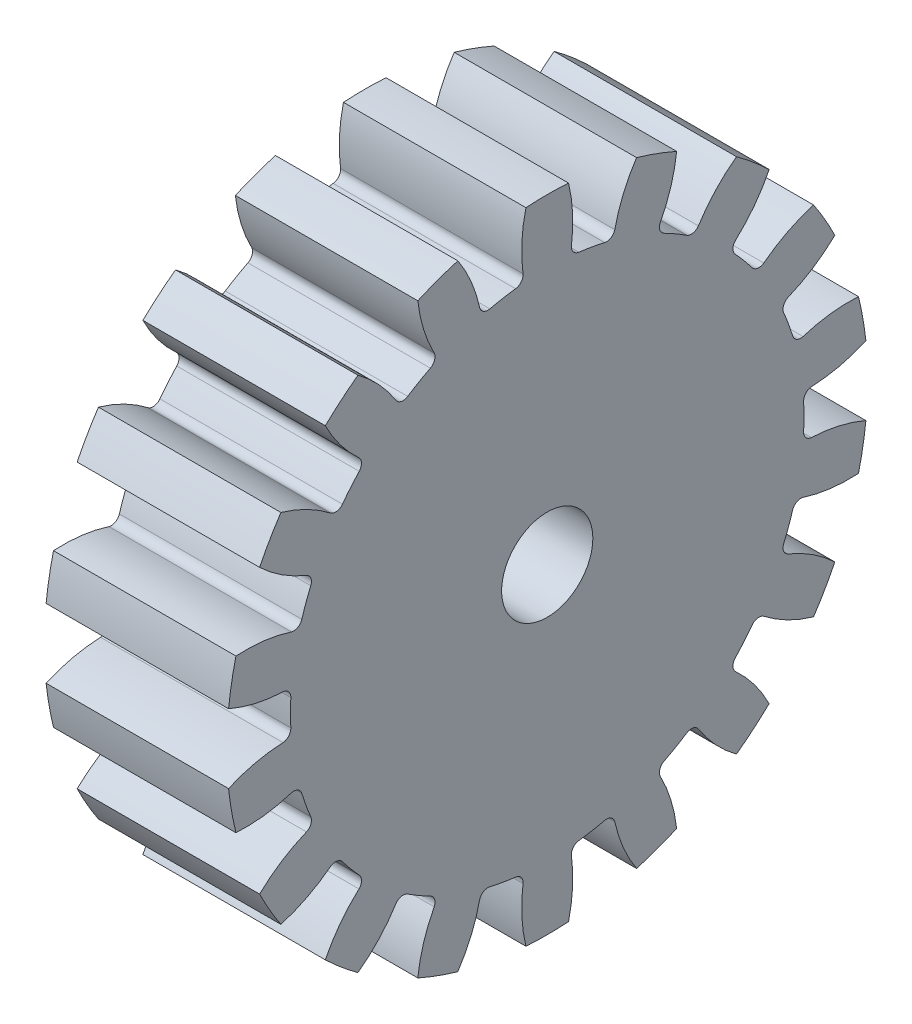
ISO-10303-21;
HEADER;
FILE_DESCRIPTION(('STEP AP214'),'2;1');
FILE_NAME('part.step','',(''),(''),'','','');
FILE_SCHEMA(('AUTOMOTIVE_DESIGN { 1 0 10303 214 1 1 1 1 }'));
ENDSEC;
DATA;
#1=APPLICATION_CONTEXT('core data for automotive mechanical design processes');
#2=APPLICATION_PROTOCOL_DEFINITION('international standard','automotive_design',2000,#1);
#3=PRODUCT_CONTEXT('',#1,'mechanical');
#4=PRODUCT('Part','Part','',(#3));
#5=PRODUCT_RELATED_PRODUCT_CATEGORY('part','',(#4));
#6=PRODUCT_DEFINITION_FORMATION('','',#4);
#7=PRODUCT_DEFINITION_CONTEXT('part definition',#1,'design');
#8=PRODUCT_DEFINITION('design','',#6,#7);
#9=PRODUCT_DEFINITION_SHAPE('','',#8);
#10=(LENGTH_UNIT() NAMED_UNIT(*) SI_UNIT(.MILLI.,.METRE.));
#11=(NAMED_UNIT(*) PLANE_ANGLE_UNIT() SI_UNIT($,.RADIAN.));
#12=(NAMED_UNIT(*) SI_UNIT($,.STERADIAN.) SOLID_ANGLE_UNIT());
#13=UNCERTAINTY_MEASURE_WITH_UNIT(LENGTH_MEASURE(1.E-05),#10,'distance_accuracy_value','');
#14=(GEOMETRIC_REPRESENTATION_CONTEXT(3) GLOBAL_UNCERTAINTY_ASSIGNED_CONTEXT((#13)) GLOBAL_UNIT_ASSIGNED_CONTEXT((#10,
#11,#12)) REPRESENTATION_CONTEXT('',''));
#15=CARTESIAN_POINT('',(0.,0.,0.));
#16=DIRECTION('',(0.,0.,1.));
#17=DIRECTION('',(1.,0.,0.));
#18=AXIS2_PLACEMENT_3D('',#15,#16,#17);
#19=CARTESIAN_POINT('',(0.937400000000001,0.,0.));
#20=DIRECTION('',(-1.,0.,0.));
#21=DIRECTION('',(0.,0.,1.));
#22=AXIS2_PLACEMENT_3D('',#19,#20,#21);
#23=CYLINDRICAL_SURFACE('',#22,8.44317570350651);
#24=CARTESIAN_POINT('',(-5.0626,0.,0.));
#25=DIRECTION('',(-1.,0.,0.));
#26=DIRECTION('',(0.,0.,1.));
#27=AXIS2_PLACEMENT_3D('',#24,#25,#26);
#28=CIRCLE('',#27,8.44317570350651);
#29=CARTESIAN_POINT('',(-5.0626,5.74979104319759,-6.18280833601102));
#30=VERTEX_POINT('',#29);
#31=CARTESIAN_POINT('',(-5.0626,5.09043684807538,-6.73607219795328));
#32=VERTEX_POINT('',#31);
#33=EDGE_CURVE('E733',#30,#32,#28,.T.);
#34=ORIENTED_EDGE('',*,*,#33,.F.);
#35=DIRECTION('',(-1.,0.,0.));
#36=VECTOR('',#35,1.);
#37=CARTESIAN_POINT('',(0.937400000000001,5.74979104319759,-6.18280833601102));
#38=LINE('',#37,#36);
#39=CARTESIAN_POINT('',(0.937400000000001,5.74979104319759,-6.18280833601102));
#40=VERTEX_POINT('',#39);
#41=EDGE_CURVE('E11',#40,#30,#38,.T.);
#42=ORIENTED_EDGE('',*,*,#41,.F.);
#43=CARTESIAN_POINT('',(0.937400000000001,0.,0.));
#44=DIRECTION('',(-1.,0.,0.));
#45=DIRECTION('',(0.,0.,1.));
#46=AXIS2_PLACEMENT_3D('',#43,#44,#45);
#47=CIRCLE('',#46,8.44317570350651);
#48=CARTESIAN_POINT('',(0.937400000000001,5.09043684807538,-6.73607219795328));
#49=VERTEX_POINT('',#48);
#50=EDGE_CURVE('E1054',#40,#49,#47,.T.);
#51=ORIENTED_EDGE('',*,*,#50,.T.);
#52=DIRECTION('',(-1.,0.,0.));
#53=VECTOR('',#52,1.);
#54=CARTESIAN_POINT('',(0.937400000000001,5.09043684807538,-6.73607219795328));
#55=LINE('',#54,#53);
#56=EDGE_CURVE('E39',#49,#32,#55,.T.);
#57=ORIENTED_EDGE('',*,*,#56,.T.);
#58=EDGE_LOOP('',(#34,#42,#51,#57));
#59=FACE_BOUND('',#58,.T.);
#60=ADVANCED_FACE('F36',(#59),#23,.T.);
#61=CARTESIAN_POINT('',(0.937400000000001,5.94081911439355,-6.38822274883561));
#62=DIRECTION('',(-1.,0.,0.));
#63=DIRECTION('',(0.,0.,1.));
#64=AXIS2_PLACEMENT_3D('',#61,#62,#63);
#65=CYLINDRICAL_SURFACE('',#64,0.280511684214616);
#66=CARTESIAN_POINT('',(-5.0626,5.94081911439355,-6.38822274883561));
#67=DIRECTION('',(1.,0.,0.));
#68=DIRECTION('',(0.,0.,-1.));
#69=AXIS2_PLACEMENT_3D('',#66,#67,#68);
#70=CIRCLE('',#69,0.280511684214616);
#71=CARTESIAN_POINT('',(-5.0626,6.13998476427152,-6.19068832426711));
#72=VERTEX_POINT('',#71);
#73=EDGE_CURVE('E1052',#72,#30,#70,.T.);
#74=ORIENTED_EDGE('',*,*,#73,.F.);
#75=DIRECTION('',(-1.,0.,0.));
#76=VECTOR('',#75,1.);
#77=CARTESIAN_POINT('',(0.937400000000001,6.13998476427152,-6.19068832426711));
#78=LINE('',#77,#76);
#79=CARTESIAN_POINT('',(0.937400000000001,6.13998476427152,-6.19068832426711));
#80=VERTEX_POINT('',#79);
#81=EDGE_CURVE('E45',#80,#72,#78,.T.);
#82=ORIENTED_EDGE('',*,*,#81,.F.);
#83=CARTESIAN_POINT('',(0.937400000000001,5.94081911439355,-6.38822274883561));
#84=DIRECTION('',(1.,0.,0.));
#85=DIRECTION('',(0.,0.,-1.));
#86=AXIS2_PLACEMENT_3D('',#83,#84,#85);
#87=CIRCLE('',#86,0.280511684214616);
#88=EDGE_CURVE('E723',#80,#40,#87,.T.);
#89=ORIENTED_EDGE('',*,*,#88,.T.);
#90=ORIENTED_EDGE('',*,*,#41,.T.);
#91=EDGE_LOOP('',(#74,#82,#89,#90));
#92=FACE_BOUND('',#91,.T.);
#93=ADVANCED_FACE('F1266',(#92),#65,.F.);
#94=CARTESIAN_POINT('',(0.937400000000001,9.79301211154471,-2.8750877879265));
#95=DIRECTION('',(-1.,0.,0.));
#96=DIRECTION('',(0.,0.,1.));
#97=AXIS2_PLACEMENT_3D('',#94,#95,#96);
#98=CYLINDRICAL_SURFACE('',#97,4.93333717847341);
#99=CARTESIAN_POINT('',(-5.0626,9.79301211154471,-2.8750877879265));
#100=DIRECTION('',(-1.,0.,0.));
#101=DIRECTION('',(0.,0.,-1.));
#102=AXIS2_PLACEMENT_3D('',#99,#100,#101);
#103=CIRCLE('',#102,4.93333717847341);
#104=CARTESIAN_POINT('',(-5.0626,7.60656994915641,-7.29744987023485));
#105=VERTEX_POINT('',#104);
#106=EDGE_CURVE('E710',#105,#72,#103,.T.);
#107=ORIENTED_EDGE('',*,*,#106,.F.);
#108=DIRECTION('',(-1.,0.,0.));
#109=VECTOR('',#108,1.);
#110=CARTESIAN_POINT('',(0.937400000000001,7.60656994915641,-7.29744987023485));
#111=LINE('',#110,#109);
#112=CARTESIAN_POINT('',(0.937400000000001,7.60656994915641,-7.29744987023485));
#113=VERTEX_POINT('',#112);
#114=EDGE_CURVE('E705',#113,#105,#111,.T.);
#115=ORIENTED_EDGE('',*,*,#114,.F.);
#116=CARTESIAN_POINT('',(0.937400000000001,9.79301211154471,-2.8750877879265));
#117=DIRECTION('',(-1.,0.,0.));
#118=DIRECTION('',(0.,0.,-1.));
#119=AXIS2_PLACEMENT_3D('',#116,#117,#118);
#120=CIRCLE('',#119,4.93333717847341);
#121=EDGE_CURVE('E708',#113,#80,#120,.T.);
#122=ORIENTED_EDGE('',*,*,#121,.T.);
#123=ORIENTED_EDGE('',*,*,#81,.T.);
#124=EDGE_LOOP('',(#107,#115,#122,#123));
#125=FACE_BOUND('',#124,.T.);
#126=ADVANCED_FACE('F707',(#125),#98,.T.);
#127=CARTESIAN_POINT('',(0.937400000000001,0.,0.));
#128=DIRECTION('',(-1.,0.,0.));
#129=DIRECTION('',(0.,0.,1.));
#130=AXIS2_PLACEMENT_3D('',#127,#128,#129);
#131=CYLINDRICAL_SURFACE('',#130,10.541);
#132=CARTESIAN_POINT('',(-5.0626,0.,0.));
#133=DIRECTION('',(-1.,0.,0.));
#134=DIRECTION('',(0.,0.,1.));
#135=AXIS2_PLACEMENT_3D('',#132,#133,#134);
#136=CIRCLE('',#135,10.541);
#137=CARTESIAN_POINT('',(-5.0626,8.50745221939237,-6.2238201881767));
#138=VERTEX_POINT('',#137);
#139=EDGE_CURVE('E1049',#138,#105,#136,.T.);
#140=ORIENTED_EDGE('',*,*,#139,.F.);
#141=DIRECTION('',(-1.,0.,0.));
#142=VECTOR('',#141,1.);
#143=CARTESIAN_POINT('',(0.937400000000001,8.50745221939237,-6.2238201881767));
#144=LINE('',#143,#142);
#145=CARTESIAN_POINT('',(0.937400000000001,8.50745221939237,-6.2238201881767));
#146=VERTEX_POINT('',#145);
#147=EDGE_CURVE('E715',#146,#138,#144,.T.);
#148=ORIENTED_EDGE('',*,*,#147,.F.);
#149=CARTESIAN_POINT('',(0.937400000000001,0.,0.));
#150=DIRECTION('',(-1.,0.,0.));
#151=DIRECTION('',(0.,0.,1.));
#152=AXIS2_PLACEMENT_3D('',#149,#150,#151);
#153=CIRCLE('',#152,10.541);
#154=EDGE_CURVE('E721',#146,#113,#153,.T.);
#155=ORIENTED_EDGE('',*,*,#154,.T.);
#156=ORIENTED_EDGE('',*,*,#114,.T.);
#157=EDGE_LOOP('',(#140,#148,#155,#156));
#158=FACE_BOUND('',#157,.T.);
#159=ADVANCED_FACE('F725',(#158),#131,.T.);
#160=CARTESIAN_POINT('',(0.937400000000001,4.51623368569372,-9.16185511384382));
#161=DIRECTION('',(-1.,0.,0.));
#162=DIRECTION('',(0.,0.,1.));
#163=AXIS2_PLACEMENT_3D('',#160,#161,#162);
#164=CYLINDRICAL_SURFACE('',#163,4.95599380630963);
#165=CARTESIAN_POINT('',(-5.0626,4.51623368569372,-9.16185511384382));
#166=DIRECTION('',(-1.,0.,0.));
#167=DIRECTION('',(0.,0.,-1.));
#168=AXIS2_PLACEMENT_3D('',#165,#166,#167);
#169=CIRCLE('',#168,4.95599380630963);
#170=CARTESIAN_POINT('',(-5.0626,7.16283502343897,-4.97170285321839));
#171=VERTEX_POINT('',#170);
#172=EDGE_CURVE('E1046',#171,#138,#169,.T.);
#173=ORIENTED_EDGE('',*,*,#172,.F.);
#174=DIRECTION('',(-1.,0.,0.));
#175=VECTOR('',#174,1.);
#176=CARTESIAN_POINT('',(0.937400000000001,7.16283502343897,-4.97170285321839));
#177=LINE('',#176,#175);
#178=CARTESIAN_POINT('',(0.937400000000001,7.16283502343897,-4.97170285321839));
#179=VERTEX_POINT('',#178);
#180=EDGE_CURVE('E1058',#179,#171,#177,.T.);
#181=ORIENTED_EDGE('',*,*,#180,.F.);
#182=CARTESIAN_POINT('',(0.937400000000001,4.51623368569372,-9.16185511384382));
#183=DIRECTION('',(-1.,0.,0.));
#184=DIRECTION('',(0.,0.,-1.));
#185=AXIS2_PLACEMENT_3D('',#182,#183,#184);
#186=CIRCLE('',#185,4.95599380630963);
#187=EDGE_CURVE('E726',#179,#146,#186,.T.);
#188=ORIENTED_EDGE('',*,*,#187,.T.);
#189=ORIENTED_EDGE('',*,*,#147,.T.);
#190=EDGE_LOOP('',(#173,#181,#188,#189));
#191=FACE_BOUND('',#190,.T.);
#192=ADVANCED_FACE('F1279',(#191),#164,.T.);
#193=CARTESIAN_POINT('',(0.937400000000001,7.32278370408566,-4.74126148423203));
#194=DIRECTION('',(-1.,0.,0.));
#195=DIRECTION('',(0.,0.,1.));
#196=AXIS2_PLACEMENT_3D('',#193,#194,#195);
#197=CYLINDRICAL_SURFACE('',#196,0.280511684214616);
#198=CARTESIAN_POINT('',(-5.0626,7.32278370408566,-4.74126148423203));
#199=DIRECTION('',(1.,0.,0.));
#200=DIRECTION('',(0.,0.,-1.));
#201=AXIS2_PLACEMENT_3D('',#198,#199,#200);
#202=CIRCLE('',#201,0.280511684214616);
#203=CARTESIAN_POINT('',(-5.0626,7.08731832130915,-4.5888053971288));
#204=VERTEX_POINT('',#203);
#205=EDGE_CURVE('E1043',#204,#171,#202,.T.);
#206=ORIENTED_EDGE('',*,*,#205,.F.);
#207=DIRECTION('',(-1.,0.,0.));
#208=VECTOR('',#207,1.);
#209=CARTESIAN_POINT('',(0.937400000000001,7.08731832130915,-4.5888053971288));
#210=LINE('',#209,#208);
#211=CARTESIAN_POINT('',(0.937400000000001,7.08731832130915,-4.5888053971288));
#212=VERTEX_POINT('',#211);
#213=EDGE_CURVE('E1060',#212,#204,#210,.T.);
#214=ORIENTED_EDGE('',*,*,#213,.F.);
#215=CARTESIAN_POINT('',(0.937400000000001,7.32278370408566,-4.74126148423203));
#216=DIRECTION('',(1.,0.,0.));
#217=DIRECTION('',(0.,0.,-1.));
#218=AXIS2_PLACEMENT_3D('',#215,#216,#217);
#219=CIRCLE('',#218,0.280511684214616);
#220=EDGE_CURVE('E728',#212,#179,#219,.T.);
#221=ORIENTED_EDGE('',*,*,#220,.T.);
#222=ORIENTED_EDGE('',*,*,#180,.T.);
#223=EDGE_LOOP('',(#206,#214,#221,#222));
#224=FACE_BOUND('',#223,.T.);
#225=ADVANCED_FACE('F1282',(#224),#197,.F.);
#226=CARTESIAN_POINT('',(0.937400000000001,0.,0.));
#227=DIRECTION('',(-1.,0.,0.));
#228=DIRECTION('',(0.,0.,1.));
#229=AXIS2_PLACEMENT_3D('',#226,#227,#228);
#230=CYLINDRICAL_SURFACE('',#229,8.44317570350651);
#231=CARTESIAN_POINT('',(-5.0626,0.,0.));
#232=DIRECTION('',(-1.,0.,0.));
#233=DIRECTION('',(0.,0.,1.));
#234=AXIS2_PLACEMENT_3D('',#231,#232,#233);
#235=CIRCLE('',#234,8.44317570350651);
#236=CARTESIAN_POINT('',(-5.0626,7.51768120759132,-3.84339501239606));
#237=VERTEX_POINT('',#236);
#238=EDGE_CURVE('E1040',#237,#204,#235,.T.);
#239=ORIENTED_EDGE('',*,*,#238,.F.);
#240=DIRECTION('',(-1.,0.,0.));
#241=VECTOR('',#240,1.);
#242=CARTESIAN_POINT('',(0.937400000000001,7.51768120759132,-3.84339501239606));
#243=LINE('',#242,#241);
#244=CARTESIAN_POINT('',(0.937400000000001,7.51768120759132,-3.84339501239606));
#245=VERTEX_POINT('',#244);
#246=EDGE_CURVE('E1062',#245,#237,#243,.T.);
#247=ORIENTED_EDGE('',*,*,#246,.F.);
#248=CARTESIAN_POINT('',(0.937400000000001,0.,0.));
#249=DIRECTION('',(-1.,0.,0.));
#250=DIRECTION('',(0.,0.,1.));
#251=AXIS2_PLACEMENT_3D('',#248,#249,#250);
#252=CIRCLE('',#251,8.44317570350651);
#253=EDGE_CURVE('E2017',#245,#212,#252,.T.);
#254=ORIENTED_EDGE('',*,*,#253,.T.);
#255=ORIENTED_EDGE('',*,*,#213,.T.);
#256=EDGE_LOOP('',(#239,#247,#254,#255));
#257=FACE_BOUND('',#256,.T.);
#258=ADVANCED_FACE('F1286',(#257),#230,.T.);
#259=CARTESIAN_POINT('',(0.937400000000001,7.76744474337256,-3.97108597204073));
#260=DIRECTION('',(-1.,0.,0.));
#261=DIRECTION('',(0.,0.,1.));
#262=AXIS2_PLACEMENT_3D('',#259,#260,#261);
#263=CYLINDRICAL_SURFACE('',#262,0.280511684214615);
#264=CARTESIAN_POINT('',(-5.0626,7.76744474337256,-3.97108597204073));
#265=DIRECTION('',(1.,0.,0.));
#266=DIRECTION('',(0.,0.,-1.));
#267=AXIS2_PLACEMENT_3D('',#264,#265,#266);
#268=CIRCLE('',#267,0.280511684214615);
#269=CARTESIAN_POINT('',(-5.0626,7.88703848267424,-3.71734566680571));
#270=VERTEX_POINT('',#269);
#271=EDGE_CURVE('E1037',#270,#237,#268,.T.);
#272=ORIENTED_EDGE('',*,*,#271,.F.);
#273=DIRECTION('',(-1.,0.,0.));
#274=VECTOR('',#273,1.);
#275=CARTESIAN_POINT('',(0.937400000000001,7.88703848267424,-3.71734566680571));
#276=LINE('',#275,#274);
#277=CARTESIAN_POINT('',(0.937400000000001,7.88703848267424,-3.71734566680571));
#278=VERTEX_POINT('',#277);
#279=EDGE_CURVE('E1064',#278,#270,#276,.T.);
#280=ORIENTED_EDGE('',*,*,#279,.F.);
#281=CARTESIAN_POINT('',(0.937400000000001,7.76744474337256,-3.97108597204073));
#282=DIRECTION('',(1.,0.,0.));
#283=DIRECTION('',(0.,0.,-1.));
#284=AXIS2_PLACEMENT_3D('',#281,#282,#283);
#285=CIRCLE('',#284,0.280511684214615);
#286=EDGE_CURVE('E2014',#278,#245,#285,.T.);
#287=ORIENTED_EDGE('',*,*,#286,.T.);
#288=ORIENTED_EDGE('',*,*,#246,.T.);
#289=EDGE_LOOP('',(#272,#280,#287,#288));
#290=FACE_BOUND('',#289,.T.);
#291=ADVANCED_FACE('F1290',(#290),#263,.F.);
#292=CARTESIAN_POINT('',(0.937400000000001,10.1857591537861,0.647708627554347));
#293=DIRECTION('',(-1.,0.,0.));
#294=DIRECTION('',(0.,0.,1.));
#295=AXIS2_PLACEMENT_3D('',#292,#293,#294);
#296=CYLINDRICAL_SURFACE('',#295,4.93333717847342);
#297=CARTESIAN_POINT('',(-5.0626,10.1857591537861,0.647708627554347));
#298=DIRECTION('',(-1.,0.,0.));
#299=DIRECTION('',(0.,0.,-1.));
#300=AXIS2_PLACEMENT_3D('',#297,#298,#299);
#301=CIRCLE('',#300,4.93333717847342);
#302=CARTESIAN_POINT('',(-5.0626,9.64371250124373,-4.25575964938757));
#303=VERTEX_POINT('',#302);
#304=EDGE_CURVE('E1034',#303,#270,#301,.T.);
#305=ORIENTED_EDGE('',*,*,#304,.F.);
#306=DIRECTION('',(-1.,0.,0.));
#307=VECTOR('',#306,1.);
#308=CARTESIAN_POINT('',(0.937400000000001,9.64371250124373,-4.25575964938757));
#309=LINE('',#308,#307);
#310=CARTESIAN_POINT('',(0.937400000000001,9.64371250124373,-4.25575964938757));
#311=VERTEX_POINT('',#310);
#312=EDGE_CURVE('E1066',#311,#303,#309,.T.);
#313=ORIENTED_EDGE('',*,*,#312,.F.);
#314=CARTESIAN_POINT('',(0.937400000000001,10.1857591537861,0.647708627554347));
#315=DIRECTION('',(-1.,0.,0.));
#316=DIRECTION('',(0.,0.,-1.));
#317=AXIS2_PLACEMENT_3D('',#314,#315,#316);
#318=CIRCLE('',#317,4.93333717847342);
#319=EDGE_CURVE('E2011',#311,#278,#318,.T.);
#320=ORIENTED_EDGE('',*,*,#319,.T.);
#321=ORIENTED_EDGE('',*,*,#279,.T.);
#322=EDGE_LOOP('',(#305,#313,#320,#321));
#323=FACE_BOUND('',#322,.T.);
#324=ADVANCED_FACE('F1294',(#323),#296,.T.);
#325=CARTESIAN_POINT('',(0.937400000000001,0.,0.));
#326=DIRECTION('',(-1.,0.,0.));
#327=DIRECTION('',(0.,0.,1.));
#328=AXIS2_PLACEMENT_3D('',#325,#326,#327);
#329=CYLINDRICAL_SURFACE('',#328,10.541);
#330=CARTESIAN_POINT('',(-5.0626,0.,0.));
#331=DIRECTION('',(-1.,0.,0.));
#332=DIRECTION('',(0.,0.,1.));
#333=AXIS2_PLACEMENT_3D('',#330,#331,#332);
#334=CIRCLE('',#333,10.541);
#335=CARTESIAN_POINT('',(-5.0626,10.1230619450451,-2.93875787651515));
#336=VERTEX_POINT('',#335);
#337=EDGE_CURVE('E1031',#336,#303,#334,.T.);
#338=ORIENTED_EDGE('',*,*,#337,.F.);
#339=DIRECTION('',(-1.,0.,0.));
#340=VECTOR('',#339,1.);
#341=CARTESIAN_POINT('',(0.937400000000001,10.1230619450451,-2.93875787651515));
#342=LINE('',#341,#340);
#343=CARTESIAN_POINT('',(0.937400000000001,10.1230619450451,-2.93875787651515));
#344=VERTEX_POINT('',#343);
#345=EDGE_CURVE('E1068',#344,#336,#342,.T.);
#346=ORIENTED_EDGE('',*,*,#345,.F.);
#347=CARTESIAN_POINT('',(0.937400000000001,0.,0.));
#348=DIRECTION('',(-1.,0.,0.));
#349=DIRECTION('',(0.,0.,1.));
#350=AXIS2_PLACEMENT_3D('',#347,#348,#349);
#351=CIRCLE('',#350,10.541);
#352=EDGE_CURVE('E2008',#344,#311,#351,.T.);
#353=ORIENTED_EDGE('',*,*,#352,.T.);
#354=ORIENTED_EDGE('',*,*,#312,.T.);
#355=EDGE_LOOP('',(#338,#346,#353,#354));
#356=FACE_BOUND('',#355,.T.);
#357=ADVANCED_FACE('F1298',(#356),#329,.T.);
#358=CARTESIAN_POINT('',(0.937400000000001,7.37741046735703,-7.06468475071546));
#359=DIRECTION('',(-1.,0.,0.));
#360=DIRECTION('',(0.,0.,1.));
#361=AXIS2_PLACEMENT_3D('',#358,#359,#360);
#362=CYLINDRICAL_SURFACE('',#361,4.95599380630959);
#363=CARTESIAN_POINT('',(-5.0626,7.37741046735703,-7.06468475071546));
#364=DIRECTION('',(-1.,0.,0.));
#365=DIRECTION('',(0.,0.,-1.));
#366=AXIS2_PLACEMENT_3D('',#363,#364,#365);
#367=CIRCLE('',#366,4.95599380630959);
#368=CARTESIAN_POINT('',(-5.0626,8.43128573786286,-2.22203862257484));
#369=VERTEX_POINT('',#368);
#370=EDGE_CURVE('E1028',#369,#336,#367,.T.);
#371=ORIENTED_EDGE('',*,*,#370,.F.);
#372=DIRECTION('',(-1.,0.,0.));
#373=VECTOR('',#372,1.);
#374=CARTESIAN_POINT('',(0.937400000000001,8.43128573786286,-2.22203862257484));
#375=LINE('',#374,#373);
#376=CARTESIAN_POINT('',(0.937400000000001,8.43128573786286,-2.22203862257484));
#377=VERTEX_POINT('',#376);
#378=EDGE_CURVE('E1070',#377,#369,#375,.T.);
#379=ORIENTED_EDGE('',*,*,#378,.F.);
#380=CARTESIAN_POINT('',(0.937400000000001,7.37741046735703,-7.06468475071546));
#381=DIRECTION('',(-1.,0.,0.));
#382=DIRECTION('',(0.,0.,-1.));
#383=AXIS2_PLACEMENT_3D('',#380,#381,#382);
#384=CIRCLE('',#383,4.95599380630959);
#385=EDGE_CURVE('E2005',#377,#344,#384,.T.);
#386=ORIENTED_EDGE('',*,*,#385,.T.);
#387=ORIENTED_EDGE('',*,*,#345,.T.);
#388=EDGE_LOOP('',(#371,#379,#386,#387));
#389=FACE_BOUND('',#388,.T.);
#390=ADVANCED_FACE('F1302',(#389),#362,.T.);
#391=CARTESIAN_POINT('',(0.937400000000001,8.50277274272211,-1.95078889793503));
#392=DIRECTION('',(-1.,0.,0.));
#393=DIRECTION('',(0.,0.,1.));
#394=AXIS2_PLACEMENT_3D('',#391,#392,#393);
#395=CYLINDRICAL_SURFACE('',#394,0.280511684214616);
#396=CARTESIAN_POINT('',(-5.0626,8.50277274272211,-1.95078889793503));
#397=DIRECTION('',(1.,0.,0.));
#398=DIRECTION('',(0.,0.,-1.));
#399=AXIS2_PLACEMENT_3D('',#396,#397,#398);
#400=CIRCLE('',#399,0.280511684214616);
#401=CARTESIAN_POINT('',(-5.0626,8.22936460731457,-1.88806094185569));
#402=VERTEX_POINT('',#401);
#403=EDGE_CURVE('E1025',#402,#369,#400,.T.);
#404=ORIENTED_EDGE('',*,*,#403,.F.);
#405=DIRECTION('',(-1.,0.,0.));
#406=VECTOR('',#405,1.);
#407=CARTESIAN_POINT('',(0.937400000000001,8.22936460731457,-1.88806094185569));
#408=LINE('',#407,#406);
#409=CARTESIAN_POINT('',(0.937400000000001,8.22936460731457,-1.88806094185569));
#410=VERTEX_POINT('',#409);
#411=EDGE_CURVE('E1072',#410,#402,#408,.T.);
#412=ORIENTED_EDGE('',*,*,#411,.F.);
#413=CARTESIAN_POINT('',(0.937400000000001,8.50277274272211,-1.95078889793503));
#414=DIRECTION('',(1.,0.,0.));
#415=DIRECTION('',(0.,0.,-1.));
#416=AXIS2_PLACEMENT_3D('',#413,#414,#415);
#417=CIRCLE('',#416,0.280511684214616);
#418=EDGE_CURVE('E2002',#410,#377,#417,.T.);
#419=ORIENTED_EDGE('',*,*,#418,.T.);
#420=ORIENTED_EDGE('',*,*,#378,.T.);
#421=EDGE_LOOP('',(#404,#412,#419,#420));
#422=FACE_BOUND('',#421,.T.);
#423=ADVANCED_FACE('F1306',(#422),#395,.F.);
#424=CARTESIAN_POINT('',(0.937400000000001,0.,0.));
#425=DIRECTION('',(-1.,0.,0.));
#426=DIRECTION('',(0.,0.,1.));
#427=AXIS2_PLACEMENT_3D('',#424,#425,#426);
#428=CYLINDRICAL_SURFACE('',#427,8.44317570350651);
#429=CARTESIAN_POINT('',(-5.0626,0.,0.));
#430=DIRECTION('',(-1.,0.,0.));
#431=DIRECTION('',(0.,0.,1.));
#432=AXIS2_PLACEMENT_3D('',#429,#430,#431);
#433=CIRCLE('',#432,8.44317570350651);
#434=CARTESIAN_POINT('',(-5.0626,8.37882806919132,-1.04041152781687));
#435=VERTEX_POINT('',#434);
#436=EDGE_CURVE('E1022',#435,#402,#433,.T.);
#437=ORIENTED_EDGE('',*,*,#436,.F.);
#438=DIRECTION('',(-1.,0.,0.));
#439=VECTOR('',#438,1.);
#440=CARTESIAN_POINT('',(0.937400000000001,8.37882806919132,-1.04041152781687));
#441=LINE('',#440,#439);
#442=CARTESIAN_POINT('',(0.937400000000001,8.37882806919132,-1.04041152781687));
#443=VERTEX_POINT('',#442);
#444=EDGE_CURVE('E1074',#443,#435,#441,.T.);
#445=ORIENTED_EDGE('',*,*,#444,.F.);
#446=CARTESIAN_POINT('',(0.937400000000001,0.,0.));
#447=DIRECTION('',(-1.,0.,0.));
#448=DIRECTION('',(0.,0.,1.));
#449=AXIS2_PLACEMENT_3D('',#446,#447,#448);
#450=CIRCLE('',#449,8.44317570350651);
#451=EDGE_CURVE('E1999',#443,#410,#450,.T.);
#452=ORIENTED_EDGE('',*,*,#451,.T.);
#453=ORIENTED_EDGE('',*,*,#411,.T.);
#454=EDGE_LOOP('',(#437,#445,#452,#453));
#455=FACE_BOUND('',#454,.T.);
#456=ADVANCED_FACE('F1310',(#455),#428,.T.);
#457=CARTESIAN_POINT('',(0.937400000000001,8.65720190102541,-1.07497762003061));
#458=DIRECTION('',(-1.,0.,0.));
#459=DIRECTION('',(0.,0.,1.));
#460=AXIS2_PLACEMENT_3D('',#457,#458,#459);
#461=CYLINDRICAL_SURFACE('',#460,0.280511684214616);
#462=CARTESIAN_POINT('',(-5.0626,8.65720190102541,-1.07497762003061));
#463=DIRECTION('',(1.,0.,0.));
#464=DIRECTION('',(0.,0.,-1.));
#465=AXIS2_PLACEMENT_3D('',#462,#463,#464);
#466=CIRCLE('',#465,0.280511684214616);
#467=CARTESIAN_POINT('',(-5.0626,8.68279895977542,-0.795636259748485));
#468=VERTEX_POINT('',#467);
#469=EDGE_CURVE('E1019',#468,#435,#466,.T.);
#470=ORIENTED_EDGE('',*,*,#469,.F.);
#471=DIRECTION('',(-1.,0.,0.));
#472=VECTOR('',#471,1.);
#473=CARTESIAN_POINT('',(0.937400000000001,8.68279895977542,-0.795636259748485));
#474=LINE('',#473,#472);
#475=CARTESIAN_POINT('',(0.937400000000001,8.68279895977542,-0.795636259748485));
#476=VERTEX_POINT('',#475);
#477=EDGE_CURVE('E1076',#476,#468,#474,.T.);
#478=ORIENTED_EDGE('',*,*,#477,.F.);
#479=CARTESIAN_POINT('',(0.937400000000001,8.65720190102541,-1.07497762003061));
#480=DIRECTION('',(1.,0.,0.));
#481=DIRECTION('',(0.,0.,-1.));
#482=AXIS2_PLACEMENT_3D('',#479,#480,#481);
#483=CIRCLE('',#482,0.280511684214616);
#484=EDGE_CURVE('E1996',#476,#443,#483,.T.);
#485=ORIENTED_EDGE('',*,*,#484,.T.);
#486=ORIENTED_EDGE('',*,*,#444,.T.);
#487=EDGE_LOOP('',(#470,#478,#485,#486));
#488=FACE_BOUND('',#487,.T.);
#489=ADVANCED_FACE('F1314',(#488),#461,.F.);
#490=CARTESIAN_POINT('',(0.937400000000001,9.3499533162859,4.09238182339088));
#491=DIRECTION('',(-1.,0.,0.));
#492=DIRECTION('',(0.,0.,1.));
#493=AXIS2_PLACEMENT_3D('',#490,#491,#492);
#494=CYLINDRICAL_SURFACE('',#493,4.93333717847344);
#495=CARTESIAN_POINT('',(-5.0626,9.3499533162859,4.09238182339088));
#496=DIRECTION('',(-1.,0.,0.));
#497=DIRECTION('',(0.,0.,-1.));
#498=AXIS2_PLACEMENT_3D('',#495,#496,#497);
#499=CIRCLE('',#498,4.93333717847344);
#500=CARTESIAN_POINT('',(-5.0626,10.5176809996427,-0.700762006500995));
#501=VERTEX_POINT('',#500);
#502=EDGE_CURVE('E1016',#501,#468,#499,.T.);
#503=ORIENTED_EDGE('',*,*,#502,.F.);
#504=DIRECTION('',(-1.,0.,0.));
#505=VECTOR('',#504,1.);
#506=CARTESIAN_POINT('',(0.937400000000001,10.5176809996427,-0.700762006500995));
#507=LINE('',#506,#505);
#508=CARTESIAN_POINT('',(0.937400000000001,10.5176809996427,-0.700762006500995));
#509=VERTEX_POINT('',#508);
#510=EDGE_CURVE('E1078',#509,#501,#507,.T.);
#511=ORIENTED_EDGE('',*,*,#510,.F.);
#512=CARTESIAN_POINT('',(0.937400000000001,9.3499533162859,4.09238182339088));
#513=DIRECTION('',(-1.,0.,0.));
#514=DIRECTION('',(0.,0.,-1.));
#515=AXIS2_PLACEMENT_3D('',#512,#513,#514);
#516=CIRCLE('',#515,4.93333717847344);
#517=EDGE_CURVE('E1993',#509,#476,#516,.T.);
#518=ORIENTED_EDGE('',*,*,#517,.T.);
#519=ORIENTED_EDGE('',*,*,#477,.T.);
#520=EDGE_LOOP('',(#503,#511,#518,#519));
#521=FACE_BOUND('',#520,.T.);
#522=ADVANCED_FACE('F1318',(#521),#494,.T.);
#523=CARTESIAN_POINT('',(0.937400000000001,0.,0.));
#524=DIRECTION('',(-1.,0.,0.));
#525=DIRECTION('',(0.,0.,1.));
#526=AXIS2_PLACEMENT_3D('',#523,#524,#525);
#527=CYLINDRICAL_SURFACE('',#526,10.541);
#528=CARTESIAN_POINT('',(-5.0626,0.,0.));
#529=DIRECTION('',(-1.,0.,0.));
#530=DIRECTION('',(0.,0.,1.));
#531=AXIS2_PLACEMENT_3D('',#528,#529,#530);
#532=CIRCLE('',#531,10.541);
#533=CARTESIAN_POINT('',(-5.0626,10.5176809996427,0.700762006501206));
#534=VERTEX_POINT('',#533);
#535=EDGE_CURVE('E1013',#534,#501,#532,.T.);
#536=ORIENTED_EDGE('',*,*,#535,.F.);
#537=DIRECTION('',(-1.,0.,0.));
#538=VECTOR('',#537,1.);
#539=CARTESIAN_POINT('',(0.937400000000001,10.5176809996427,0.700762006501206));
#540=LINE('',#539,#538);
#541=CARTESIAN_POINT('',(0.937400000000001,10.5176809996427,0.700762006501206));
#542=VERTEX_POINT('',#541);
#543=EDGE_CURVE('E1080',#542,#534,#540,.T.);
#544=ORIENTED_EDGE('',*,*,#543,.F.);
#545=CARTESIAN_POINT('',(0.937400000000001,0.,0.));
#546=DIRECTION('',(-1.,0.,0.));
#547=DIRECTION('',(0.,0.,1.));
#548=AXIS2_PLACEMENT_3D('',#545,#546,#547);
#549=CIRCLE('',#548,10.541);
#550=EDGE_CURVE('E1990',#542,#509,#549,.T.);
#551=ORIENTED_EDGE('',*,*,#550,.T.);
#552=ORIENTED_EDGE('',*,*,#510,.T.);
#553=EDGE_LOOP('',(#536,#544,#551,#552));
#554=FACE_BOUND('',#553,.T.);
#555=ADVANCED_FACE('F1322',(#554),#527,.T.);
#556=CARTESIAN_POINT('',(0.937400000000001,9.34876266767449,-4.11540914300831));
#557=DIRECTION('',(-1.,0.,0.));
#558=DIRECTION('',(0.,0.,1.));
#559=AXIS2_PLACEMENT_3D('',#556,#557,#558);
#560=CYLINDRICAL_SURFACE('',#559,4.9559938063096);
#561=CARTESIAN_POINT('',(-5.0626,9.34876266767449,-4.11540914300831));
#562=DIRECTION('',(-1.,0.,0.));
#563=DIRECTION('',(0.,0.,-1.));
#564=AXIS2_PLACEMENT_3D('',#561,#562,#563);
#565=CIRCLE('',#564,4.9559938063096);
#566=CARTESIAN_POINT('',(-5.0626,8.68279895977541,0.79563625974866));
#567=VERTEX_POINT('',#566);
#568=EDGE_CURVE('E1010',#567,#534,#565,.T.);
#569=ORIENTED_EDGE('',*,*,#568,.F.);
#570=DIRECTION('',(-1.,0.,0.));
#571=VECTOR('',#570,1.);
#572=CARTESIAN_POINT('',(0.937400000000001,8.68279895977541,0.79563625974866));
#573=LINE('',#572,#571);
#574=CARTESIAN_POINT('',(0.937400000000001,8.68279895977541,0.79563625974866));
#575=VERTEX_POINT('',#574);
#576=EDGE_CURVE('E1082',#575,#567,#573,.T.);
#577=ORIENTED_EDGE('',*,*,#576,.F.);
#578=CARTESIAN_POINT('',(0.937400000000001,9.34876266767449,-4.11540914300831));
#579=DIRECTION('',(-1.,0.,0.));
#580=DIRECTION('',(0.,0.,-1.));
#581=AXIS2_PLACEMENT_3D('',#578,#579,#580);
#582=CIRCLE('',#581,4.9559938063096);
#583=EDGE_CURVE('E1987',#575,#542,#582,.T.);
#584=ORIENTED_EDGE('',*,*,#583,.T.);
#585=ORIENTED_EDGE('',*,*,#543,.T.);
#586=EDGE_LOOP('',(#569,#577,#584,#585));
#587=FACE_BOUND('',#586,.T.);
#588=ADVANCED_FACE('F1326',(#587),#560,.T.);
#589=CARTESIAN_POINT('',(0.937400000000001,8.65720190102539,1.07497762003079));
#590=DIRECTION('',(-1.,0.,0.));
#591=DIRECTION('',(0.,0.,1.));
#592=AXIS2_PLACEMENT_3D('',#589,#590,#591);
#593=CYLINDRICAL_SURFACE('',#592,0.280511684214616);
#594=CARTESIAN_POINT('',(-5.0626,8.65720190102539,1.07497762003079));
#595=DIRECTION('',(1.,0.,0.));
#596=DIRECTION('',(0.,0.,-1.));
#597=AXIS2_PLACEMENT_3D('',#594,#595,#596);
#598=CIRCLE('',#597,0.280511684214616);
#599=CARTESIAN_POINT('',(-5.0626,8.37882806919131,1.04041152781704));
#600=VERTEX_POINT('',#599);
#601=EDGE_CURVE('E1007',#600,#567,#598,.T.);
#602=ORIENTED_EDGE('',*,*,#601,.F.);
#603=DIRECTION('',(-1.,0.,0.));
#604=VECTOR('',#603,1.);
#605=CARTESIAN_POINT('',(0.937400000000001,8.37882806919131,1.04041152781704));
#606=LINE('',#605,#604);
#607=CARTESIAN_POINT('',(0.937400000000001,8.37882806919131,1.04041152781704));
#608=VERTEX_POINT('',#607);
#609=EDGE_CURVE('E1084',#608,#600,#606,.T.);
#610=ORIENTED_EDGE('',*,*,#609,.F.);
#611=CARTESIAN_POINT('',(0.937400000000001,8.65720190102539,1.07497762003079));
#612=DIRECTION('',(1.,0.,0.));
#613=DIRECTION('',(0.,0.,-1.));
#614=AXIS2_PLACEMENT_3D('',#611,#612,#613);
#615=CIRCLE('',#614,0.280511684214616);
#616=EDGE_CURVE('E1984',#608,#575,#615,.T.);
#617=ORIENTED_EDGE('',*,*,#616,.T.);
#618=ORIENTED_EDGE('',*,*,#576,.T.);
#619=EDGE_LOOP('',(#602,#610,#617,#618));
#620=FACE_BOUND('',#619,.T.);
#621=ADVANCED_FACE('F1330',(#620),#593,.F.);
#622=CARTESIAN_POINT('',(0.937400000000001,0.,0.));
#623=DIRECTION('',(-1.,0.,0.));
#624=DIRECTION('',(0.,0.,1.));
#625=AXIS2_PLACEMENT_3D('',#622,#623,#624);
#626=CYLINDRICAL_SURFACE('',#625,8.44317570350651);
#627=CARTESIAN_POINT('',(-5.0626,0.,0.));
#628=DIRECTION('',(-1.,0.,0.));
#629=DIRECTION('',(0.,0.,1.));
#630=AXIS2_PLACEMENT_3D('',#627,#628,#629);
#631=CIRCLE('',#630,8.44317570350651);
#632=CARTESIAN_POINT('',(-5.0626,8.22936460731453,1.88806094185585));
#633=VERTEX_POINT('',#632);
#634=EDGE_CURVE('E1004',#633,#600,#631,.T.);
#635=ORIENTED_EDGE('',*,*,#634,.F.);
#636=DIRECTION('',(-1.,0.,0.));
#637=VECTOR('',#636,1.);
#638=CARTESIAN_POINT('',(0.937400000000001,8.22936460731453,1.88806094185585));
#639=LINE('',#638,#637);
#640=CARTESIAN_POINT('',(0.937400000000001,8.22936460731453,1.88806094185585));
#641=VERTEX_POINT('',#640);
#642=EDGE_CURVE('E1086',#641,#633,#639,.T.);
#643=ORIENTED_EDGE('',*,*,#642,.F.);
#644=CARTESIAN_POINT('',(0.937400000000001,0.,0.));
#645=DIRECTION('',(-1.,0.,0.));
#646=DIRECTION('',(0.,0.,1.));
#647=AXIS2_PLACEMENT_3D('',#644,#645,#646);
#648=CIRCLE('',#647,8.44317570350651);
#649=EDGE_CURVE('E1981',#641,#608,#648,.T.);
#650=ORIENTED_EDGE('',*,*,#649,.T.);
#651=ORIENTED_EDGE('',*,*,#609,.T.);
#652=EDGE_LOOP('',(#635,#643,#650,#651));
#653=FACE_BOUND('',#652,.T.);
#654=ADVANCED_FACE('F1334',(#653),#626,.T.);
#655=CARTESIAN_POINT('',(0.937400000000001,8.50277274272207,1.9507888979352));
#656=DIRECTION('',(-1.,0.,0.));
#657=DIRECTION('',(0.,0.,1.));
#658=AXIS2_PLACEMENT_3D('',#655,#656,#657);
#659=CYLINDRICAL_SURFACE('',#658,0.280511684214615);
#660=CARTESIAN_POINT('',(-5.0626,8.50277274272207,1.9507888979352));
#661=DIRECTION('',(1.,0.,0.));
#662=DIRECTION('',(0.,0.,-1.));
#663=AXIS2_PLACEMENT_3D('',#660,#661,#662);
#664=CIRCLE('',#663,0.280511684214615);
#665=CARTESIAN_POINT('',(-5.0626,8.4312857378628,2.22203862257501));
#666=VERTEX_POINT('',#665);
#667=EDGE_CURVE('E1001',#666,#633,#664,.T.);
#668=ORIENTED_EDGE('',*,*,#667,.F.);
#669=DIRECTION('',(-1.,0.,0.));
#670=VECTOR('',#669,1.);
#671=CARTESIAN_POINT('',(0.937400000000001,8.4312857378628,2.22203862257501));
#672=LINE('',#671,#670);
#673=CARTESIAN_POINT('',(0.937400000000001,8.4312857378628,2.22203862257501));
#674=VERTEX_POINT('',#673);
#675=EDGE_CURVE('E1088',#674,#666,#672,.T.);
#676=ORIENTED_EDGE('',*,*,#675,.F.);
#677=CARTESIAN_POINT('',(0.937400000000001,8.50277274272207,1.9507888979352));
#678=DIRECTION('',(1.,0.,0.));
#679=DIRECTION('',(0.,0.,-1.));
#680=AXIS2_PLACEMENT_3D('',#677,#678,#679);
#681=CIRCLE('',#680,0.280511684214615);
#682=EDGE_CURVE('E1978',#674,#641,#681,.T.);
#683=ORIENTED_EDGE('',*,*,#682,.T.);
#684=ORIENTED_EDGE('',*,*,#642,.T.);
#685=EDGE_LOOP('',(#668,#676,#683,#684));
#686=FACE_BOUND('',#685,.T.);
#687=ADVANCED_FACE('F1338',(#686),#659,.F.);
#688=CARTESIAN_POINT('',(0.937400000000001,7.38640511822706,7.04345337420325));
#689=DIRECTION('',(-1.,0.,0.));
#690=DIRECTION('',(0.,0.,1.));
#691=AXIS2_PLACEMENT_3D('',#688,#689,#690);
#692=CYLINDRICAL_SURFACE('',#691,4.93333717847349);
#693=CARTESIAN_POINT('',(-5.0626,7.38640511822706,7.04345337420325));
#694=DIRECTION('',(-1.,0.,0.));
#695=DIRECTION('',(0.,0.,-1.));
#696=AXIS2_PLACEMENT_3D('',#693,#694,#695);
#697=CIRCLE('',#696,4.93333717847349);
#698=CARTESIAN_POINT('',(-5.0626,10.123061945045,2.93875787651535));
#699=VERTEX_POINT('',#698);
#700=EDGE_CURVE('E998',#699,#666,#697,.T.);
#701=ORIENTED_EDGE('',*,*,#700,.F.);
#702=DIRECTION('',(-1.,0.,0.));
#703=VECTOR('',#702,1.);
#704=CARTESIAN_POINT('',(0.937400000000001,10.123061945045,2.93875787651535));
#705=LINE('',#704,#703);
#706=CARTESIAN_POINT('',(0.937400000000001,10.123061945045,2.93875787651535));
#707=VERTEX_POINT('',#706);
#708=EDGE_CURVE('E1090',#707,#699,#705,.T.);
#709=ORIENTED_EDGE('',*,*,#708,.F.);
#710=CARTESIAN_POINT('',(0.937400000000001,7.38640511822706,7.04345337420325));
#711=DIRECTION('',(-1.,0.,0.));
#712=DIRECTION('',(0.,0.,-1.));
#713=AXIS2_PLACEMENT_3D('',#710,#711,#712);
#714=CIRCLE('',#713,4.93333717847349);
#715=EDGE_CURVE('E1975',#707,#674,#714,.T.);
#716=ORIENTED_EDGE('',*,*,#715,.T.);
#717=ORIENTED_EDGE('',*,*,#675,.T.);
#718=EDGE_LOOP('',(#701,#709,#716,#717));
#719=FACE_BOUND('',#718,.T.);
#720=ADVANCED_FACE('F1342',(#719),#692,.T.);
#721=CARTESIAN_POINT('',(0.937400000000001,0.,0.));
#722=DIRECTION('',(-1.,0.,0.));
#723=DIRECTION('',(0.,0.,1.));
#724=AXIS2_PLACEMENT_3D('',#721,#722,#723);
#725=CYLINDRICAL_SURFACE('',#724,10.541);
#726=CARTESIAN_POINT('',(-5.0626,0.,0.));
#727=DIRECTION('',(-1.,0.,0.));
#728=DIRECTION('',(0.,0.,1.));
#729=AXIS2_PLACEMENT_3D('',#726,#727,#728);
#730=CIRCLE('',#729,10.541);
#731=CARTESIAN_POINT('',(-5.0626,9.64371250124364,4.25575964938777));
#732=VERTEX_POINT('',#731);
#733=EDGE_CURVE('E995',#732,#699,#730,.T.);
#734=ORIENTED_EDGE('',*,*,#733,.F.);
#735=DIRECTION('',(-1.,0.,0.));
#736=VECTOR('',#735,1.);
#737=CARTESIAN_POINT('',(0.937400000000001,9.64371250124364,4.25575964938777));
#738=LINE('',#737,#736);
#739=CARTESIAN_POINT('',(0.937400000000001,9.64371250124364,4.25575964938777));
#740=VERTEX_POINT('',#739);
#741=EDGE_CURVE('E1092',#740,#732,#738,.T.);
#742=ORIENTED_EDGE('',*,*,#741,.F.);
#743=CARTESIAN_POINT('',(0.937400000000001,0.,0.));
#744=DIRECTION('',(-1.,0.,0.));
#745=DIRECTION('',(0.,0.,1.));
#746=AXIS2_PLACEMENT_3D('',#743,#744,#745);
#747=CIRCLE('',#746,10.541);
#748=EDGE_CURVE('E1972',#740,#707,#747,.T.);
#749=ORIENTED_EDGE('',*,*,#748,.T.);
#750=ORIENTED_EDGE('',*,*,#708,.T.);
#751=EDGE_LOOP('',(#734,#742,#749,#750));
#752=FACE_BOUND('',#751,.T.);
#753=ADVANCED_FACE('F1346',(#752),#725,.T.);
#754=CARTESIAN_POINT('',(0.937400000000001,10.192516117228,-0.669754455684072));
#755=DIRECTION('',(-1.,0.,0.));
#756=DIRECTION('',(0.,0.,1.));
#757=AXIS2_PLACEMENT_3D('',#754,#755,#756);
#758=CYLINDRICAL_SURFACE('',#757,4.9559938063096);
#759=CARTESIAN_POINT('',(-5.0626,10.192516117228,-0.669754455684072));
#760=DIRECTION('',(-1.,0.,0.));
#761=DIRECTION('',(0.,0.,-1.));
#762=AXIS2_PLACEMENT_3D('',#759,#760,#761);
#763=CIRCLE('',#762,4.9559938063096);
#764=CARTESIAN_POINT('',(-5.0626,7.88703848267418,3.71734566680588));
#765=VERTEX_POINT('',#764);
#766=EDGE_CURVE('E992',#765,#732,#763,.T.);
#767=ORIENTED_EDGE('',*,*,#766,.F.);
#768=DIRECTION('',(-1.,0.,0.));
#769=VECTOR('',#768,1.);
#770=CARTESIAN_POINT('',(0.937400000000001,7.88703848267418,3.71734566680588));
#771=LINE('',#770,#769);
#772=CARTESIAN_POINT('',(0.937400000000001,7.88703848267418,3.71734566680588));
#773=VERTEX_POINT('',#772);
#774=EDGE_CURVE('E1094',#773,#765,#771,.T.);
#775=ORIENTED_EDGE('',*,*,#774,.F.);
#776=CARTESIAN_POINT('',(0.937400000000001,10.192516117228,-0.669754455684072));
#777=DIRECTION('',(-1.,0.,0.));
#778=DIRECTION('',(0.,0.,-1.));
#779=AXIS2_PLACEMENT_3D('',#776,#777,#778);
#780=CIRCLE('',#779,4.9559938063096);
#781=EDGE_CURVE('E1969',#773,#740,#780,.T.);
#782=ORIENTED_EDGE('',*,*,#781,.T.);
#783=ORIENTED_EDGE('',*,*,#741,.T.);
#784=EDGE_LOOP('',(#767,#775,#782,#783));
#785=FACE_BOUND('',#784,.T.);
#786=ADVANCED_FACE('F1350',(#785),#758,.T.);
#787=CARTESIAN_POINT('',(0.937400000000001,7.76744474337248,3.97108597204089));
#788=DIRECTION('',(-1.,0.,0.));
#789=DIRECTION('',(0.,0.,1.));
#790=AXIS2_PLACEMENT_3D('',#787,#788,#789);
#791=CYLINDRICAL_SURFACE('',#790,0.280511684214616);
#792=CARTESIAN_POINT('',(-5.0626,7.76744474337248,3.97108597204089));
#793=DIRECTION('',(1.,0.,0.));
#794=DIRECTION('',(0.,0.,-1.));
#795=AXIS2_PLACEMENT_3D('',#792,#793,#794);
#796=CIRCLE('',#795,0.280511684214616);
#797=CARTESIAN_POINT('',(-5.0626,7.51768120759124,3.84339501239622));
#798=VERTEX_POINT('',#797);
#799=EDGE_CURVE('E989',#798,#765,#796,.T.);
#800=ORIENTED_EDGE('',*,*,#799,.F.);
#801=DIRECTION('',(-1.,0.,0.));
#802=VECTOR('',#801,1.);
#803=CARTESIAN_POINT('',(0.937400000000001,7.51768120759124,3.84339501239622));
#804=LINE('',#803,#802);
#805=CARTESIAN_POINT('',(0.937400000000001,7.51768120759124,3.84339501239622));
#806=VERTEX_POINT('',#805);
#807=EDGE_CURVE('E1096',#806,#798,#804,.T.);
#808=ORIENTED_EDGE('',*,*,#807,.F.);
#809=CARTESIAN_POINT('',(0.937400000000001,7.76744474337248,3.97108597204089));
#810=DIRECTION('',(1.,0.,0.));
#811=DIRECTION('',(0.,0.,-1.));
#812=AXIS2_PLACEMENT_3D('',#809,#810,#811);
#813=CIRCLE('',#812,0.280511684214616);
#814=EDGE_CURVE('E1966',#806,#773,#813,.T.);
#815=ORIENTED_EDGE('',*,*,#814,.T.);
#816=ORIENTED_EDGE('',*,*,#774,.T.);
#817=EDGE_LOOP('',(#800,#808,#815,#816));
#818=FACE_BOUND('',#817,.T.);
#819=ADVANCED_FACE('F1354',(#818),#791,.F.);
#820=CARTESIAN_POINT('',(0.937400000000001,0.,0.));
#821=DIRECTION('',(-1.,0.,0.));
#822=DIRECTION('',(0.,0.,1.));
#823=AXIS2_PLACEMENT_3D('',#820,#821,#822);
#824=CYLINDRICAL_SURFACE('',#823,8.44317570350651);
#825=CARTESIAN_POINT('',(-5.0626,0.,0.));
#826=DIRECTION('',(-1.,0.,0.));
#827=DIRECTION('',(0.,0.,1.));
#828=AXIS2_PLACEMENT_3D('',#825,#826,#827);
#829=CIRCLE('',#828,8.44317570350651);
#830=CARTESIAN_POINT('',(-5.0626,7.08731832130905,4.58880539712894));
#831=VERTEX_POINT('',#830);
#832=EDGE_CURVE('E986',#831,#798,#829,.T.);
#833=ORIENTED_EDGE('',*,*,#832,.F.);
#834=DIRECTION('',(-1.,0.,0.));
#835=VECTOR('',#834,1.);
#836=CARTESIAN_POINT('',(0.937400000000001,7.08731832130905,4.58880539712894));
#837=LINE('',#836,#835);
#838=CARTESIAN_POINT('',(0.937400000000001,7.08731832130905,4.58880539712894));
#839=VERTEX_POINT('',#838);
#840=EDGE_CURVE('E1098',#839,#831,#837,.T.);
#841=ORIENTED_EDGE('',*,*,#840,.F.);
#842=CARTESIAN_POINT('',(0.937400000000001,0.,0.));
#843=DIRECTION('',(-1.,0.,0.));
#844=DIRECTION('',(0.,0.,1.));
#845=AXIS2_PLACEMENT_3D('',#842,#843,#844);
#846=CIRCLE('',#845,8.44317570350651);
#847=EDGE_CURVE('E1963',#839,#806,#846,.T.);
#848=ORIENTED_EDGE('',*,*,#847,.T.);
#849=ORIENTED_EDGE('',*,*,#807,.T.);
#850=EDGE_LOOP('',(#833,#841,#848,#849));
#851=FACE_BOUND('',#850,.T.);
#852=ADVANCED_FACE('F1358',(#851),#824,.T.);
#853=CARTESIAN_POINT('',(0.937400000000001,7.32278370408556,4.74126148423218));
#854=DIRECTION('',(-1.,0.,0.));
#855=DIRECTION('',(0.,0.,1.));
#856=AXIS2_PLACEMENT_3D('',#853,#854,#855);
#857=CYLINDRICAL_SURFACE('',#856,0.280511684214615);
#858=CARTESIAN_POINT('',(-5.0626,7.32278370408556,4.74126148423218));
#859=DIRECTION('',(1.,0.,0.));
#860=DIRECTION('',(0.,0.,-1.));
#861=AXIS2_PLACEMENT_3D('',#858,#859,#860);
#862=CIRCLE('',#861,0.280511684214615);
#863=CARTESIAN_POINT('',(-5.0626,7.16283502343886,4.97170285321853));
#864=VERTEX_POINT('',#863);
#865=EDGE_CURVE('E983',#864,#831,#862,.T.);
#866=ORIENTED_EDGE('',*,*,#865,.F.);
#867=DIRECTION('',(-1.,0.,0.));
#868=VECTOR('',#867,1.);
#869=CARTESIAN_POINT('',(0.937400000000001,7.16283502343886,4.97170285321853));
#870=LINE('',#869,#868);
#871=CARTESIAN_POINT('',(0.937400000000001,7.16283502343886,4.97170285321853));
#872=VERTEX_POINT('',#871);
#873=EDGE_CURVE('E1100',#872,#864,#870,.T.);
#874=ORIENTED_EDGE('',*,*,#873,.F.);
#875=CARTESIAN_POINT('',(0.937400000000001,7.32278370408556,4.74126148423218));
#876=DIRECTION('',(1.,0.,0.));
#877=DIRECTION('',(0.,0.,-1.));
#878=AXIS2_PLACEMENT_3D('',#875,#876,#877);
#879=CIRCLE('',#878,0.280511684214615);
#880=EDGE_CURVE('E1960',#872,#839,#879,.T.);
#881=ORIENTED_EDGE('',*,*,#880,.T.);
#882=ORIENTED_EDGE('',*,*,#840,.T.);
#883=EDGE_LOOP('',(#866,#874,#881,#882));
#884=FACE_BOUND('',#883,.T.);
#885=ADVANCED_FACE('F1362',(#884),#857,.F.);
#886=CARTESIAN_POINT('',(0.937400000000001,4.53194745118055,9.14498049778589));
#887=DIRECTION('',(-1.,0.,0.));
#888=DIRECTION('',(0.,0.,1.));
#889=AXIS2_PLACEMENT_3D('',#886,#887,#888);
#890=CYLINDRICAL_SURFACE('',#889,4.93333717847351);
#891=CARTESIAN_POINT('',(-5.0626,4.53194745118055,9.14498049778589));
#892=DIRECTION('',(-1.,0.,0.));
#893=DIRECTION('',(0.,0.,-1.));
#894=AXIS2_PLACEMENT_3D('',#891,#892,#893);
#895=CIRCLE('',#894,4.93333717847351);
#896=CARTESIAN_POINT('',(-5.0626,8.50745221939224,6.22382018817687));
#897=VERTEX_POINT('',#896);
#898=EDGE_CURVE('E980',#897,#864,#895,.T.);
#899=ORIENTED_EDGE('',*,*,#898,.F.);
#900=DIRECTION('',(-1.,0.,0.));
#901=VECTOR('',#900,1.);
#902=CARTESIAN_POINT('',(0.937400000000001,8.50745221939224,6.22382018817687));
#903=LINE('',#902,#901);
#904=CARTESIAN_POINT('',(0.937400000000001,8.50745221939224,6.22382018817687));
#905=VERTEX_POINT('',#904);
#906=EDGE_CURVE('E1102',#905,#897,#903,.T.);
#907=ORIENTED_EDGE('',*,*,#906,.F.);
#908=CARTESIAN_POINT('',(0.937400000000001,4.53194745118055,9.14498049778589));
#909=DIRECTION('',(-1.,0.,0.));
#910=DIRECTION('',(0.,0.,-1.));
#911=AXIS2_PLACEMENT_3D('',#908,#909,#910);
#912=CIRCLE('',#911,4.93333717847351);
#913=EDGE_CURVE('E1957',#905,#872,#912,.T.);
#914=ORIENTED_EDGE('',*,*,#913,.T.);
#915=ORIENTED_EDGE('',*,*,#873,.T.);
#916=EDGE_LOOP('',(#899,#907,#914,#915));
#917=FACE_BOUND('',#916,.T.);
#918=ADVANCED_FACE('F1366',(#917),#890,.T.);
#919=CARTESIAN_POINT('',(0.937400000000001,0.,0.));
#920=DIRECTION('',(-1.,0.,0.));
#921=DIRECTION('',(0.,0.,1.));
#922=AXIS2_PLACEMENT_3D('',#919,#920,#921);
#923=CYLINDRICAL_SURFACE('',#922,10.541);
#924=CARTESIAN_POINT('',(-5.0626,0.,0.));
#925=DIRECTION('',(-1.,0.,0.));
#926=DIRECTION('',(0.,0.,1.));
#927=AXIS2_PLACEMENT_3D('',#924,#925,#926);
#928=CIRCLE('',#927,10.541);
#929=CARTESIAN_POINT('',(-5.0626,7.60656994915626,7.29744987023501));
#930=VERTEX_POINT('',#929);
#931=EDGE_CURVE('E977',#930,#897,#928,.T.);
#932=ORIENTED_EDGE('',*,*,#931,.F.);
#933=DIRECTION('',(-1.,0.,0.));
#934=VECTOR('',#933,1.);
#935=CARTESIAN_POINT('',(0.937400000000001,7.60656994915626,7.29744987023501));
#936=LINE('',#935,#934);
#937=CARTESIAN_POINT('',(0.937400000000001,7.60656994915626,7.29744987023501));
#938=VERTEX_POINT('',#937);
#939=EDGE_CURVE('E1104',#938,#930,#936,.T.);
#940=ORIENTED_EDGE('',*,*,#939,.F.);
#941=CARTESIAN_POINT('',(0.937400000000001,0.,0.));
#942=DIRECTION('',(-1.,0.,0.));
#943=DIRECTION('',(0.,0.,1.));
#944=AXIS2_PLACEMENT_3D('',#941,#942,#943);
#945=CIRCLE('',#944,10.541);
#946=EDGE_CURVE('E1954',#938,#905,#945,.T.);
#947=ORIENTED_EDGE('',*,*,#946,.T.);
#948=ORIENTED_EDGE('',*,*,#906,.T.);
#949=EDGE_LOOP('',(#932,#940,#947,#948));
#950=FACE_BOUND('',#949,.T.);
#951=ADVANCED_FACE('F1370',(#950),#923,.T.);
#952=CARTESIAN_POINT('',(0.937400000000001,9.80690169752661,2.85668250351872));
#953=DIRECTION('',(-1.,0.,0.));
#954=DIRECTION('',(0.,0.,1.));
#955=AXIS2_PLACEMENT_3D('',#952,#953,#954);
#956=CYLINDRICAL_SURFACE('',#955,4.95599380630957);
#957=CARTESIAN_POINT('',(-5.0626,9.80690169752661,2.85668250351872));
#958=DIRECTION('',(-1.,0.,0.));
#959=DIRECTION('',(0.,0.,-1.));
#960=AXIS2_PLACEMENT_3D('',#957,#958,#959);
#961=CIRCLE('',#960,4.95599380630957);
#962=CARTESIAN_POINT('',(-5.0626,6.13998476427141,6.19068832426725));
#963=VERTEX_POINT('',#962);
#964=EDGE_CURVE('E974',#963,#930,#961,.T.);
#965=ORIENTED_EDGE('',*,*,#964,.F.);
#966=DIRECTION('',(-1.,0.,0.));
#967=VECTOR('',#966,1.);
#968=CARTESIAN_POINT('',(0.937400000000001,6.13998476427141,6.19068832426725));
#969=LINE('',#968,#967);
#970=CARTESIAN_POINT('',(0.937400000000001,6.13998476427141,6.19068832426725));
#971=VERTEX_POINT('',#970);
#972=EDGE_CURVE('E1106',#971,#963,#969,.T.);
#973=ORIENTED_EDGE('',*,*,#972,.F.);
#974=CARTESIAN_POINT('',(0.937400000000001,9.80690169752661,2.85668250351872));
#975=DIRECTION('',(-1.,0.,0.));
#976=DIRECTION('',(0.,0.,-1.));
#977=AXIS2_PLACEMENT_3D('',#974,#975,#976);
#978=CIRCLE('',#977,4.95599380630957);
#979=EDGE_CURVE('E1951',#971,#938,#978,.T.);
#980=ORIENTED_EDGE('',*,*,#979,.T.);
#981=ORIENTED_EDGE('',*,*,#939,.T.);
#982=EDGE_LOOP('',(#965,#973,#980,#981));
#983=FACE_BOUND('',#982,.T.);
#984=ADVANCED_FACE('F1374',(#983),#956,.T.);
#985=CARTESIAN_POINT('',(0.937400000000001,5.94081911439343,6.38822274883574));
#986=DIRECTION('',(-1.,0.,0.));
#987=DIRECTION('',(0.,0.,1.));
#988=AXIS2_PLACEMENT_3D('',#985,#986,#987);
#989=CYLINDRICAL_SURFACE('',#988,0.280511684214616);
#990=CARTESIAN_POINT('',(-5.0626,5.94081911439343,6.38822274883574));
#991=DIRECTION('',(1.,0.,0.));
#992=DIRECTION('',(0.,0.,-1.));
#993=AXIS2_PLACEMENT_3D('',#990,#991,#992);
#994=CIRCLE('',#993,0.280511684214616);
#995=CARTESIAN_POINT('',(-5.0626,5.74979104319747,6.18280833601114));
#996=VERTEX_POINT('',#995);
#997=EDGE_CURVE('E971',#996,#963,#994,.T.);
#998=ORIENTED_EDGE('',*,*,#997,.F.);
#999=DIRECTION('',(-1.,0.,0.));
#1000=VECTOR('',#999,1.);
#1001=CARTESIAN_POINT('',(0.937400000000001,5.74979104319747,6.18280833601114));
#1002=LINE('',#1001,#1000);
#1003=CARTESIAN_POINT('',(0.937400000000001,5.74979104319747,6.18280833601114));
#1004=VERTEX_POINT('',#1003);
#1005=EDGE_CURVE('E1108',#1004,#996,#1002,.T.);
#1006=ORIENTED_EDGE('',*,*,#1005,.F.);
#1007=CARTESIAN_POINT('',(0.937400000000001,5.94081911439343,6.38822274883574));
#1008=DIRECTION('',(1.,0.,0.));
#1009=DIRECTION('',(0.,0.,-1.));
#1010=AXIS2_PLACEMENT_3D('',#1007,#1008,#1009);
#1011=CIRCLE('',#1010,0.280511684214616);
#1012=EDGE_CURVE('E1948',#1004,#971,#1011,.T.);
#1013=ORIENTED_EDGE('',*,*,#1012,.T.);
#1014=ORIENTED_EDGE('',*,*,#972,.T.);
#1015=EDGE_LOOP('',(#998,#1006,#1013,#1014));
#1016=FACE_BOUND('',#1015,.T.);
#1017=ADVANCED_FACE('F1378',(#1016),#989,.F.);
#1018=CARTESIAN_POINT('',(0.937400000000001,0.,0.));
#1019=DIRECTION('',(-1.,0.,0.));
#1020=DIRECTION('',(0.,0.,1.));
#1021=AXIS2_PLACEMENT_3D('',#1018,#1019,#1020);
#1022=CYLINDRICAL_SURFACE('',#1021,8.44317570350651);
#1023=CARTESIAN_POINT('',(-5.0626,0.,0.));
#1024=DIRECTION('',(-1.,0.,0.));
#1025=DIRECTION('',(0.,0.,1.));
#1026=AXIS2_PLACEMENT_3D('',#1023,#1024,#1025);
#1027=CIRCLE('',#1026,8.44317570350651);
#1028=CARTESIAN_POINT('',(-5.0626,5.09043684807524,6.73607219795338));
#1029=VERTEX_POINT('',#1028);
#1030=EDGE_CURVE('E968',#1029,#996,#1027,.T.);
#1031=ORIENTED_EDGE('',*,*,#1030,.F.);
#1032=DIRECTION('',(-1.,0.,0.));
#1033=VECTOR('',#1032,1.);
#1034=CARTESIAN_POINT('',(0.937400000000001,5.09043684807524,6.73607219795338));
#1035=LINE('',#1034,#1033);
#1036=CARTESIAN_POINT('',(0.937400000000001,5.09043684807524,6.73607219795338));
#1037=VERTEX_POINT('',#1036);
#1038=EDGE_CURVE('E1110',#1037,#1029,#1035,.T.);
#1039=ORIENTED_EDGE('',*,*,#1038,.F.);
#1040=CARTESIAN_POINT('',(0.937400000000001,0.,0.));
#1041=DIRECTION('',(-1.,0.,0.));
#1042=DIRECTION('',(0.,0.,1.));
#1043=AXIS2_PLACEMENT_3D('',#1040,#1041,#1042);
#1044=CIRCLE('',#1043,8.44317570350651);
#1045=EDGE_CURVE('E1945',#1037,#1004,#1044,.T.);
#1046=ORIENTED_EDGE('',*,*,#1045,.T.);
#1047=ORIENTED_EDGE('',*,*,#1005,.T.);
#1048=EDGE_LOOP('',(#1031,#1039,#1046,#1047));
#1049=FACE_BOUND('',#1048,.T.);
#1050=ADVANCED_FACE('F1382',(#1049),#1022,.T.);
#1051=CARTESIAN_POINT('',(0.937400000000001,5.25955887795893,6.95986796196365));
#1052=DIRECTION('',(-1.,0.,0.));
#1053=DIRECTION('',(0.,0.,1.));
#1054=AXIS2_PLACEMENT_3D('',#1051,#1052,#1053);
#1055=CYLINDRICAL_SURFACE('',#1054,0.280511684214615);
#1056=CARTESIAN_POINT('',(-5.0626,5.25955887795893,6.95986796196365));
#1057=DIRECTION('',(1.,0.,0.));
#1058=DIRECTION('',(0.,0.,-1.));
#1059=AXIS2_PLACEMENT_3D('',#1056,#1057,#1058);
#1060=CIRCLE('',#1059,0.280511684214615);
#1061=CARTESIAN_POINT('',(-5.0626,5.03044069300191,7.12170634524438));
#1062=VERTEX_POINT('',#1061);
#1063=EDGE_CURVE('E965',#1062,#1029,#1060,.T.);
#1064=ORIENTED_EDGE('',*,*,#1063,.F.);
#1065=DIRECTION('',(-1.,0.,0.));
#1066=VECTOR('',#1065,1.);
#1067=CARTESIAN_POINT('',(0.937400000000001,5.03044069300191,7.12170634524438));
#1068=LINE('',#1067,#1066);
#1069=CARTESIAN_POINT('',(0.937400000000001,5.03044069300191,7.12170634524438));
#1070=VERTEX_POINT('',#1069);
#1071=EDGE_CURVE('E1112',#1070,#1062,#1068,.T.);
#1072=ORIENTED_EDGE('',*,*,#1071,.F.);
#1073=CARTESIAN_POINT('',(0.937400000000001,5.25955887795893,6.95986796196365));
#1074=DIRECTION('',(1.,0.,0.));
#1075=DIRECTION('',(0.,0.,-1.));
#1076=AXIS2_PLACEMENT_3D('',#1073,#1074,#1075);
#1077=CIRCLE('',#1076,0.280511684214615);
#1078=EDGE_CURVE('E1942',#1070,#1037,#1077,.T.);
#1079=ORIENTED_EDGE('',*,*,#1078,.T.);
#1080=ORIENTED_EDGE('',*,*,#1038,.T.);
#1081=EDGE_LOOP('',(#1064,#1072,#1079,#1080));
#1082=FACE_BOUND('',#1081,.T.);
#1083=ADVANCED_FACE('F1386',(#1082),#1055,.F.);
#1084=CARTESIAN_POINT('',(0.937400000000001,1.13087003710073,10.1434880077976));
#1085=DIRECTION('',(-1.,0.,0.));
#1086=DIRECTION('',(0.,0.,1.));
#1087=AXIS2_PLACEMENT_3D('',#1084,#1085,#1086);
#1088=CYLINDRICAL_SURFACE('',#1087,4.93333717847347);
#1089=CARTESIAN_POINT('',(-5.0626,1.13087003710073,10.1434880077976));
#1090=DIRECTION('',(-1.,0.,0.));
#1091=DIRECTION('',(0.,0.,-1.));
#1092=AXIS2_PLACEMENT_3D('',#1089,#1090,#1091);
#1093=CIRCLE('',#1092,4.93333717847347);
#1094=CARTESIAN_POINT('',(-5.0626,5.86571819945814,8.75819793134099));
#1095=VERTEX_POINT('',#1094);
#1096=EDGE_CURVE('E962',#1095,#1062,#1093,.T.);
#1097=ORIENTED_EDGE('',*,*,#1096,.F.);
#1098=DIRECTION('',(-1.,0.,0.));
#1099=VECTOR('',#1098,1.);
#1100=CARTESIAN_POINT('',(0.937400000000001,5.86571819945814,8.75819793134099));
#1101=LINE('',#1100,#1099);
#1102=CARTESIAN_POINT('',(0.937400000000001,5.86571819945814,8.75819793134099));
#1103=VERTEX_POINT('',#1102);
#1104=EDGE_CURVE('E1114',#1103,#1095,#1101,.T.);
#1105=ORIENTED_EDGE('',*,*,#1104,.F.);
#1106=CARTESIAN_POINT('',(0.937400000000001,1.13087003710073,10.1434880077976));
#1107=DIRECTION('',(-1.,0.,0.));
#1108=DIRECTION('',(0.,0.,-1.));
#1109=AXIS2_PLACEMENT_3D('',#1106,#1107,#1108);
#1110=CIRCLE('',#1109,4.93333717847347);
#1111=EDGE_CURVE('E1939',#1103,#1070,#1110,.T.);
#1112=ORIENTED_EDGE('',*,*,#1111,.T.);
#1113=ORIENTED_EDGE('',*,*,#1071,.T.);
#1114=EDGE_LOOP('',(#1097,#1105,#1112,#1113));
#1115=FACE_BOUND('',#1114,.T.);
#1116=ADVANCED_FACE('F1390',(#1115),#1088,.T.);
#1117=CARTESIAN_POINT('',(0.937400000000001,0.,0.));
#1118=DIRECTION('',(-1.,0.,0.));
#1119=DIRECTION('',(0.,0.,1.));
#1120=AXIS2_PLACEMENT_3D('',#1117,#1118,#1119);
#1121=CYLINDRICAL_SURFACE('',#1120,10.541);
#1122=CARTESIAN_POINT('',(-5.0626,0.,0.));
#1123=DIRECTION('',(-1.,0.,0.));
#1124=DIRECTION('',(0.,0.,1.));
#1125=AXIS2_PLACEMENT_3D('',#1122,#1123,#1124);
#1126=CIRCLE('',#1125,10.541);
#1127=CARTESIAN_POINT('',(-5.0626,4.65196280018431,9.45895993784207));
#1128=VERTEX_POINT('',#1127);
#1129=EDGE_CURVE('E959',#1128,#1095,#1126,.T.);
#1130=ORIENTED_EDGE('',*,*,#1129,.F.);
#1131=DIRECTION('',(-1.,0.,0.));
#1132=VECTOR('',#1131,1.);
#1133=CARTESIAN_POINT('',(0.937400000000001,4.65196280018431,9.45895993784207));
#1134=LINE('',#1133,#1132);
#1135=CARTESIAN_POINT('',(0.937400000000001,4.65196280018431,9.45895993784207));
#1136=VERTEX_POINT('',#1135);
#1137=EDGE_CURVE('E1116',#1136,#1128,#1134,.T.);
#1138=ORIENTED_EDGE('',*,*,#1137,.F.);
#1139=CARTESIAN_POINT('',(0.937400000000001,0.,0.));
#1140=DIRECTION('',(-1.,0.,0.));
#1141=DIRECTION('',(0.,0.,1.));
#1142=AXIS2_PLACEMENT_3D('',#1139,#1140,#1141);
#1143=CIRCLE('',#1142,10.541);
#1144=EDGE_CURVE('E1936',#1136,#1103,#1143,.T.);
#1145=ORIENTED_EDGE('',*,*,#1144,.T.);
#1146=ORIENTED_EDGE('',*,*,#1104,.T.);
#1147=EDGE_LOOP('',(#1130,#1138,#1145,#1146));
#1148=FACE_BOUND('',#1147,.T.);
#1149=ADVANCED_FACE('F1394',(#1148),#1121,.T.);
#1150=CARTESIAN_POINT('',(0.937400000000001,8.23843019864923,6.03856139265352));
#1151=DIRECTION('',(-1.,0.,0.));
#1152=DIRECTION('',(0.,0.,1.));
#1153=AXIS2_PLACEMENT_3D('',#1150,#1151,#1152);
#1154=CYLINDRICAL_SURFACE('',#1153,4.95599380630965);
#1155=CARTESIAN_POINT('',(-5.0626,8.23843019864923,6.03856139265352));
#1156=DIRECTION('',(-1.,0.,0.));
#1157=DIRECTION('',(0.,0.,-1.));
#1158=AXIS2_PLACEMENT_3D('',#1155,#1156,#1157);
#1159=CIRCLE('',#1158,4.95599380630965);
#1160=CARTESIAN_POINT('',(-5.0626,3.65235826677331,7.91734260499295));
#1161=VERTEX_POINT('',#1160);
#1162=EDGE_CURVE('E956',#1161,#1128,#1159,.T.);
#1163=ORIENTED_EDGE('',*,*,#1162,.F.);
#1164=DIRECTION('',(-1.,0.,0.));
#1165=VECTOR('',#1164,1.);
#1166=CARTESIAN_POINT('',(0.937400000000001,3.65235826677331,7.91734260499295));
#1167=LINE('',#1166,#1165);
#1168=CARTESIAN_POINT('',(0.937400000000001,3.65235826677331,7.91734260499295));
#1169=VERTEX_POINT('',#1168);
#1170=EDGE_CURVE('E1118',#1169,#1161,#1167,.T.);
#1171=ORIENTED_EDGE('',*,*,#1170,.F.);
#1172=CARTESIAN_POINT('',(0.937400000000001,8.23843019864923,6.03856139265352));
#1173=DIRECTION('',(-1.,0.,0.));
#1174=DIRECTION('',(0.,0.,-1.));
#1175=AXIS2_PLACEMENT_3D('',#1172,#1173,#1174);
#1176=CIRCLE('',#1175,4.95599380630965);
#1177=EDGE_CURVE('E1933',#1169,#1136,#1176,.T.);
#1178=ORIENTED_EDGE('',*,*,#1177,.T.);
#1179=ORIENTED_EDGE('',*,*,#1137,.T.);
#1180=EDGE_LOOP('',(#1163,#1171,#1178,#1179));
#1181=FACE_BOUND('',#1180,.T.);
#1182=ADVANCED_FACE('F1398',(#1181),#1154,.T.);
#1183=CARTESIAN_POINT('',(0.937400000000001,3.39764302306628,8.03484558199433));
#1184=DIRECTION('',(-1.,0.,0.));
#1185=DIRECTION('',(0.,0.,1.));
#1186=AXIS2_PLACEMENT_3D('',#1183,#1184,#1185);
#1187=CYLINDRICAL_SURFACE('',#1186,0.280511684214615);
#1188=CARTESIAN_POINT('',(-5.0626,3.39764302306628,8.03484558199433));
#1189=DIRECTION('',(1.,0.,0.));
#1190=DIRECTION('',(0.,0.,-1.));
#1191=AXIS2_PLACEMENT_3D('',#1188,#1189,#1190);
#1192=CIRCLE('',#1191,0.280511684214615);
#1193=CARTESIAN_POINT('',(-5.0626,3.2883912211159,7.77648372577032));
#1194=VERTEX_POINT('',#1193);
#1195=EDGE_CURVE('E953',#1194,#1161,#1192,.T.);
#1196=ORIENTED_EDGE('',*,*,#1195,.F.);
#1197=DIRECTION('',(-1.,0.,0.));
#1198=VECTOR('',#1197,1.);
#1199=CARTESIAN_POINT('',(0.937400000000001,3.2883912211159,7.77648372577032));
#1200=LINE('',#1199,#1198);
#1201=CARTESIAN_POINT('',(0.937400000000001,3.2883912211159,7.77648372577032));
#1202=VERTEX_POINT('',#1201);
#1203=EDGE_CURVE('E1120',#1202,#1194,#1200,.T.);
#1204=ORIENTED_EDGE('',*,*,#1203,.F.);
#1205=CARTESIAN_POINT('',(0.937400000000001,3.39764302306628,8.03484558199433));
#1206=DIRECTION('',(1.,0.,0.));
#1207=DIRECTION('',(0.,0.,-1.));
#1208=AXIS2_PLACEMENT_3D('',#1205,#1206,#1207);
#1209=CIRCLE('',#1208,0.280511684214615);
#1210=EDGE_CURVE('E1930',#1202,#1169,#1209,.T.);
#1211=ORIENTED_EDGE('',*,*,#1210,.T.);
#1212=ORIENTED_EDGE('',*,*,#1170,.T.);
#1213=EDGE_LOOP('',(#1196,#1204,#1211,#1212));
#1214=FACE_BOUND('',#1213,.T.);
#1215=ADVANCED_FACE('F1402',(#1214),#1187,.F.);
#1216=CARTESIAN_POINT('',(0.937400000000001,0.,0.));
#1217=DIRECTION('',(-1.,0.,0.));
#1218=DIRECTION('',(0.,0.,1.));
#1219=AXIS2_PLACEMENT_3D('',#1216,#1217,#1218);
#1220=CYLINDRICAL_SURFACE('',#1219,8.44317570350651);
#1221=CARTESIAN_POINT('',(-5.0626,0.,0.));
#1222=DIRECTION('',(-1.,0.,0.));
#1223=DIRECTION('',(0.,0.,1.));
#1224=AXIS2_PLACEMENT_3D('',#1221,#1222,#1223);
#1225=CIRCLE('',#1224,8.44317570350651);
#1226=CARTESIAN_POINT('',(-5.0626,2.47957356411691,8.07086927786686));
#1227=VERTEX_POINT('',#1226);
#1228=EDGE_CURVE('E950',#1227,#1194,#1225,.T.);
#1229=ORIENTED_EDGE('',*,*,#1228,.F.);
#1230=DIRECTION('',(-1.,0.,0.));
#1231=VECTOR('',#1230,1.);
#1232=CARTESIAN_POINT('',(0.937400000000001,2.47957356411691,8.07086927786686));
#1233=LINE('',#1232,#1231);
#1234=CARTESIAN_POINT('',(0.937400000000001,2.47957356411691,8.07086927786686));
#1235=VERTEX_POINT('',#1234);
#1236=EDGE_CURVE('E1122',#1235,#1227,#1233,.T.);
#1237=ORIENTED_EDGE('',*,*,#1236,.F.);
#1238=CARTESIAN_POINT('',(0.937400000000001,0.,0.));
#1239=DIRECTION('',(-1.,0.,0.));
#1240=DIRECTION('',(0.,0.,1.));
#1241=AXIS2_PLACEMENT_3D('',#1238,#1239,#1240);
#1242=CIRCLE('',#1241,8.44317570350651);
#1243=EDGE_CURVE('E1927',#1235,#1202,#1242,.T.);
#1244=ORIENTED_EDGE('',*,*,#1243,.T.);
#1245=ORIENTED_EDGE('',*,*,#1203,.T.);
#1246=EDGE_LOOP('',(#1229,#1237,#1244,#1245));
#1247=FACE_BOUND('',#1246,.T.);
#1248=ADVANCED_FACE('F1406',(#1247),#1220,.T.);
#1249=CARTESIAN_POINT('',(0.937400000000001,2.56195362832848,8.33901164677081));
#1250=DIRECTION('',(-1.,0.,0.));
#1251=DIRECTION('',(0.,0.,1.));
#1252=AXIS2_PLACEMENT_3D('',#1249,#1250,#1251);
#1253=CYLINDRICAL_SURFACE('',#1252,0.280511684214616);
#1254=CARTESIAN_POINT('',(-5.0626,2.56195362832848,8.33901164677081));
#1255=DIRECTION('',(1.,0.,0.));
#1256=DIRECTION('',(0.,0.,-1.));
#1257=AXIS2_PLACEMENT_3D('',#1254,#1255,#1256);
#1258=CIRCLE('',#1257,0.280511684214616);
#1259=CARTESIAN_POINT('',(-5.0626,2.29130097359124,8.41272694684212));
#1260=VERTEX_POINT('',#1259);
#1261=EDGE_CURVE('E947',#1260,#1227,#1258,.T.);
#1262=ORIENTED_EDGE('',*,*,#1261,.F.);
#1263=DIRECTION('',(-1.,0.,0.));
#1264=VECTOR('',#1263,1.);
#1265=CARTESIAN_POINT('',(0.937400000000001,2.29130097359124,8.41272694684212));
#1266=LINE('',#1265,#1264);
#1267=CARTESIAN_POINT('',(0.937400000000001,2.29130097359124,8.41272694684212));
#1268=VERTEX_POINT('',#1267);
#1269=EDGE_CURVE('E1124',#1268,#1260,#1266,.T.);
#1270=ORIENTED_EDGE('',*,*,#1269,.F.);
#1271=CARTESIAN_POINT('',(0.937400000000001,2.56195362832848,8.33901164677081));
#1272=DIRECTION('',(1.,0.,0.));
#1273=DIRECTION('',(0.,0.,-1.));
#1274=AXIS2_PLACEMENT_3D('',#1271,#1272,#1273);
#1275=CIRCLE('',#1274,0.280511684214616);
#1276=EDGE_CURVE('E1924',#1268,#1235,#1275,.T.);
#1277=ORIENTED_EDGE('',*,*,#1276,.T.);
#1278=ORIENTED_EDGE('',*,*,#1236,.T.);
#1279=EDGE_LOOP('',(#1262,#1270,#1277,#1278));
#1280=FACE_BOUND('',#1279,.T.);
#1281=ADVANCED_FACE('F1410',(#1280),#1253,.F.);
#1282=CARTESIAN_POINT('',(0.937400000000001,-2.40660699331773,9.91854116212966));
#1283=DIRECTION('',(-1.,0.,0.));
#1284=DIRECTION('',(0.,0.,1.));
#1285=AXIS2_PLACEMENT_3D('',#1282,#1283,#1284);
#1286=CYLINDRICAL_SURFACE('',#1285,4.93333717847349);
#1287=CARTESIAN_POINT('',(-5.0626,-2.40660699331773,9.91854116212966));
#1288=DIRECTION('',(-1.,0.,0.));
#1289=DIRECTION('',(0.,0.,-1.));
#1290=AXIS2_PLACEMENT_3D('',#1287,#1288,#1289);
#1291=CIRCLE('',#1290,4.93333717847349);
#1292=CARTESIAN_POINT('',(-5.0626,2.51649199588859,10.2362077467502));
#1293=VERTEX_POINT('',#1292);
#1294=EDGE_CURVE('E944',#1293,#1260,#1291,.T.);
#1295=ORIENTED_EDGE('',*,*,#1294,.F.);
#1296=DIRECTION('',(-1.,0.,0.));
#1297=VECTOR('',#1296,1.);
#1298=CARTESIAN_POINT('',(0.937400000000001,2.51649199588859,10.2362077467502));
#1299=LINE('',#1298,#1297);
#1300=CARTESIAN_POINT('',(0.937400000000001,2.51649199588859,10.2362077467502));
#1301=VERTEX_POINT('',#1300);
#1302=EDGE_CURVE('E1126',#1301,#1293,#1299,.T.);
#1303=ORIENTED_EDGE('',*,*,#1302,.F.);
#1304=CARTESIAN_POINT('',(0.937400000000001,-2.40660699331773,9.91854116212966));
#1305=DIRECTION('',(-1.,0.,0.));
#1306=DIRECTION('',(0.,0.,-1.));
#1307=AXIS2_PLACEMENT_3D('',#1304,#1305,#1306);
#1308=CIRCLE('',#1307,4.93333717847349);
#1309=EDGE_CURVE('E1921',#1301,#1268,#1308,.T.);
#1310=ORIENTED_EDGE('',*,*,#1309,.T.);
#1311=ORIENTED_EDGE('',*,*,#1269,.T.);
#1312=EDGE_LOOP('',(#1295,#1303,#1310,#1311));
#1313=FACE_BOUND('',#1312,.T.);
#1314=ADVANCED_FACE('F1414',(#1313),#1286,.T.);
#1315=CARTESIAN_POINT('',(0.937400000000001,0.,0.));
#1316=DIRECTION('',(-1.,0.,0.));
#1317=DIRECTION('',(0.,0.,1.));
#1318=AXIS2_PLACEMENT_3D('',#1315,#1316,#1317);
#1319=CYLINDRICAL_SURFACE('',#1318,10.541);
#1320=CARTESIAN_POINT('',(-5.0626,0.,0.));
#1321=DIRECTION('',(-1.,0.,0.));
#1322=DIRECTION('',(0.,0.,1.));
#1323=AXIS2_PLACEMENT_3D('',#1320,#1321,#1322);
#1324=CIRCLE('',#1323,10.541);
#1325=CARTESIAN_POINT('',(-5.0626,1.13626028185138,10.4795798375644));
#1326=VERTEX_POINT('',#1325);
#1327=EDGE_CURVE('E941',#1326,#1293,#1324,.T.);
#1328=ORIENTED_EDGE('',*,*,#1327,.F.);
#1329=DIRECTION('',(-1.,0.,0.));
#1330=VECTOR('',#1329,1.);
#1331=CARTESIAN_POINT('',(0.937400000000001,1.13626028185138,10.4795798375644));
#1332=LINE('',#1331,#1330);
#1333=CARTESIAN_POINT('',(0.937400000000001,1.13626028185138,10.4795798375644));
#1334=VERTEX_POINT('',#1333);
#1335=EDGE_CURVE('E1128',#1334,#1326,#1332,.T.);
#1336=ORIENTED_EDGE('',*,*,#1335,.F.);
#1337=CARTESIAN_POINT('',(0.937400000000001,0.,0.));
#1338=DIRECTION('',(-1.,0.,0.));
#1339=DIRECTION('',(0.,0.,1.));
#1340=AXIS2_PLACEMENT_3D('',#1337,#1338,#1339);
#1341=CIRCLE('',#1340,10.541);
#1342=EDGE_CURVE('E1918',#1334,#1301,#1341,.T.);
#1343=ORIENTED_EDGE('',*,*,#1342,.T.);
#1344=ORIENTED_EDGE('',*,*,#1302,.T.);
#1345=EDGE_LOOP('',(#1328,#1336,#1343,#1344));
#1346=FACE_BOUND('',#1345,.T.);
#1347=ADVANCED_FACE('F1418',(#1346),#1319,.T.);
#1348=CARTESIAN_POINT('',(0.937400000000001,5.6762824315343,8.49210065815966));
#1349=DIRECTION('',(-1.,0.,0.));
#1350=DIRECTION('',(0.,0.,1.));
#1351=AXIS2_PLACEMENT_3D('',#1348,#1349,#1350);
#1352=CYLINDRICAL_SURFACE('',#1351,4.95599380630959);
#1353=CARTESIAN_POINT('',(-5.0626,5.6762824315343,8.49210065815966));
#1354=DIRECTION('',(-1.,0.,0.));
#1355=DIRECTION('',(0.,0.,-1.));
#1356=AXIS2_PLACEMENT_3D('',#1353,#1354,#1355);
#1357=CIRCLE('',#1356,4.95599380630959);
#1358=CARTESIAN_POINT('',(-5.0626,0.724203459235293,8.68904852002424));
#1359=VERTEX_POINT('',#1358);
#1360=EDGE_CURVE('E938',#1359,#1326,#1357,.T.);
#1361=ORIENTED_EDGE('',*,*,#1360,.F.);
#1362=DIRECTION('',(-1.,0.,0.));
#1363=VECTOR('',#1362,1.);
#1364=CARTESIAN_POINT('',(0.937400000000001,0.724203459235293,8.68904852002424));
#1365=LINE('',#1364,#1363);
#1366=CARTESIAN_POINT('',(0.937400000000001,0.724203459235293,8.68904852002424));
#1367=VERTEX_POINT('',#1366);
#1368=EDGE_CURVE('E1130',#1367,#1359,#1365,.T.);
#1369=ORIENTED_EDGE('',*,*,#1368,.F.);
#1370=CARTESIAN_POINT('',(0.937400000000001,5.6762824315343,8.49210065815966));
#1371=DIRECTION('',(-1.,0.,0.));
#1372=DIRECTION('',(0.,0.,-1.));
#1373=AXIS2_PLACEMENT_3D('',#1370,#1371,#1372);
#1374=CIRCLE('',#1373,4.95599380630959);
#1375=EDGE_CURVE('E1915',#1367,#1334,#1374,.T.);
#1376=ORIENTED_EDGE('',*,*,#1375,.T.);
#1377=ORIENTED_EDGE('',*,*,#1335,.T.);
#1378=EDGE_LOOP('',(#1361,#1369,#1376,#1377));
#1379=FACE_BOUND('',#1378,.T.);
#1380=ADVANCED_FACE('F1422',(#1379),#1352,.T.);
#1381=CARTESIAN_POINT('',(0.937400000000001,0.444661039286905,8.71234745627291));
#1382=DIRECTION('',(-1.,0.,0.));
#1383=DIRECTION('',(0.,0.,1.));
#1384=AXIS2_PLACEMENT_3D('',#1381,#1382,#1383);
#1385=CYLINDRICAL_SURFACE('',#1384,0.280511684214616);
#1386=CARTESIAN_POINT('',(-5.0626,0.444661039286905,8.71234745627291));
#1387=DIRECTION('',(1.,0.,0.));
#1388=DIRECTION('',(0.,0.,-1.));
#1389=AXIS2_PLACEMENT_3D('',#1386,#1387,#1388);
#1390=CIRCLE('',#1389,0.280511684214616);
#1391=CARTESIAN_POINT('',(-5.0626,0.430362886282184,8.432200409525));
#1392=VERTEX_POINT('',#1391);
#1393=EDGE_CURVE('E935',#1392,#1359,#1390,.T.);
#1394=ORIENTED_EDGE('',*,*,#1393,.F.);
#1395=DIRECTION('',(-1.,0.,0.));
#1396=VECTOR('',#1395,1.);
#1397=CARTESIAN_POINT('',(0.937400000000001,0.430362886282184,8.432200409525));
#1398=LINE('',#1397,#1396);
#1399=CARTESIAN_POINT('',(0.937400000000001,0.430362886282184,8.432200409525));
#1400=VERTEX_POINT('',#1399);
#1401=EDGE_CURVE('E1132',#1400,#1392,#1398,.T.);
#1402=ORIENTED_EDGE('',*,*,#1401,.F.);
#1403=CARTESIAN_POINT('',(0.937400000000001,0.444661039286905,8.71234745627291));
#1404=DIRECTION('',(1.,0.,0.));
#1405=DIRECTION('',(0.,0.,-1.));
#1406=AXIS2_PLACEMENT_3D('',#1403,#1404,#1405);
#1407=CIRCLE('',#1406,0.280511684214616);
#1408=EDGE_CURVE('E1912',#1400,#1367,#1407,.T.);
#1409=ORIENTED_EDGE('',*,*,#1408,.T.);
#1410=ORIENTED_EDGE('',*,*,#1368,.T.);
#1411=EDGE_LOOP('',(#1394,#1402,#1409,#1410));
#1412=FACE_BOUND('',#1411,.T.);
#1413=ADVANCED_FACE('F1426',(#1412),#1385,.F.);
#1414=CARTESIAN_POINT('',(0.937400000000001,0.,0.));
#1415=DIRECTION('',(-1.,0.,0.));
#1416=DIRECTION('',(0.,0.,1.));
#1417=AXIS2_PLACEMENT_3D('',#1414,#1415,#1416);
#1418=CYLINDRICAL_SURFACE('',#1417,8.44317570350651);
#1419=CARTESIAN_POINT('',(-5.0626,0.,0.));
#1420=DIRECTION('',(-1.,0.,0.));
#1421=DIRECTION('',(0.,0.,1.));
#1422=AXIS2_PLACEMENT_3D('',#1419,#1420,#1421);
#1423=CIRCLE('',#1422,8.44317570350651);
#1424=CARTESIAN_POINT('',(-5.0626,-0.430362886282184,8.43220040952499));
#1425=VERTEX_POINT('',#1424);
#1426=EDGE_CURVE('E932',#1425,#1392,#1423,.T.);
#1427=ORIENTED_EDGE('',*,*,#1426,.F.);
#1428=DIRECTION('',(-1.,0.,0.));
#1429=VECTOR('',#1428,1.);
#1430=CARTESIAN_POINT('',(0.937400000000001,-0.430362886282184,8.43220040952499));
#1431=LINE('',#1430,#1429);
#1432=CARTESIAN_POINT('',(0.937400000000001,-0.430362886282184,8.43220040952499));
#1433=VERTEX_POINT('',#1432);
#1434=EDGE_CURVE('E1134',#1433,#1425,#1431,.T.);
#1435=ORIENTED_EDGE('',*,*,#1434,.F.);
#1436=CARTESIAN_POINT('',(0.937400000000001,0.,0.));
#1437=DIRECTION('',(-1.,0.,0.));
#1438=DIRECTION('',(0.,0.,1.));
#1439=AXIS2_PLACEMENT_3D('',#1436,#1437,#1438);
#1440=CIRCLE('',#1439,8.44317570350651);
#1441=EDGE_CURVE('E1909',#1433,#1400,#1440,.T.);
#1442=ORIENTED_EDGE('',*,*,#1441,.T.);
#1443=ORIENTED_EDGE('',*,*,#1401,.T.);
#1444=EDGE_LOOP('',(#1427,#1435,#1442,#1443));
#1445=FACE_BOUND('',#1444,.T.);
#1446=ADVANCED_FACE('F1430',(#1445),#1418,.T.);
#1447=CARTESIAN_POINT('',(0.937400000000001,-0.444661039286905,8.7123474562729));
#1448=DIRECTION('',(-1.,0.,0.));
#1449=DIRECTION('',(0.,0.,1.));
#1450=AXIS2_PLACEMENT_3D('',#1447,#1448,#1449);
#1451=CYLINDRICAL_SURFACE('',#1450,0.280511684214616);
#1452=CARTESIAN_POINT('',(-5.0626,-0.444661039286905,8.7123474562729));
#1453=DIRECTION('',(1.,0.,0.));
#1454=DIRECTION('',(0.,0.,-1.));
#1455=AXIS2_PLACEMENT_3D('',#1452,#1453,#1454);
#1456=CIRCLE('',#1455,0.280511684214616);
#1457=CARTESIAN_POINT('',(-5.0626,-0.724203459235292,8.68904852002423));
#1458=VERTEX_POINT('',#1457);
#1459=EDGE_CURVE('E929',#1458,#1425,#1456,.T.);
#1460=ORIENTED_EDGE('',*,*,#1459,.F.);
#1461=DIRECTION('',(-1.,0.,0.));
#1462=VECTOR('',#1461,1.);
#1463=CARTESIAN_POINT('',(0.937400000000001,-0.724203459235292,8.68904852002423));
#1464=LINE('',#1463,#1462);
#1465=CARTESIAN_POINT('',(0.937400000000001,-0.724203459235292,8.68904852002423));
#1466=VERTEX_POINT('',#1465);
#1467=EDGE_CURVE('E1136',#1466,#1458,#1464,.T.);
#1468=ORIENTED_EDGE('',*,*,#1467,.F.);
#1469=CARTESIAN_POINT('',(0.937400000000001,-0.444661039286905,8.7123474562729));
#1470=DIRECTION('',(1.,0.,0.));
#1471=DIRECTION('',(0.,0.,-1.));
#1472=AXIS2_PLACEMENT_3D('',#1469,#1470,#1471);
#1473=CIRCLE('',#1472,0.280511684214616);
#1474=EDGE_CURVE('E1906',#1466,#1433,#1473,.T.);
#1475=ORIENTED_EDGE('',*,*,#1474,.T.);
#1476=ORIENTED_EDGE('',*,*,#1434,.T.);
#1477=EDGE_LOOP('',(#1460,#1468,#1475,#1476));
#1478=FACE_BOUND('',#1477,.T.);
#1479=ADVANCED_FACE('F1434',(#1478),#1451,.F.);
#1480=CARTESIAN_POINT('',(0.937400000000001,-5.65381170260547,8.49727187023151));
#1481=DIRECTION('',(-1.,0.,0.));
#1482=DIRECTION('',(0.,0.,1.));
#1483=AXIS2_PLACEMENT_3D('',#1480,#1481,#1482);
#1484=CYLINDRICAL_SURFACE('',#1483,4.9333371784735);
#1485=CARTESIAN_POINT('',(-5.0626,-5.65381170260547,8.49727187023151));
#1486=DIRECTION('',(-1.,0.,0.));
#1487=DIRECTION('',(0.,0.,-1.));
#1488=AXIS2_PLACEMENT_3D('',#1485,#1486,#1487);
#1489=CIRCLE('',#1488,4.9333371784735);
#1490=CARTESIAN_POINT('',(-5.0626,-1.13626028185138,10.4795798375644));
#1491=VERTEX_POINT('',#1490);
#1492=EDGE_CURVE('E926',#1491,#1458,#1489,.T.);
#1493=ORIENTED_EDGE('',*,*,#1492,.F.);
#1494=DIRECTION('',(-1.,0.,0.));
#1495=VECTOR('',#1494,1.);
#1496=CARTESIAN_POINT('',(0.937400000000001,-1.13626028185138,10.4795798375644));
#1497=LINE('',#1496,#1495);
#1498=CARTESIAN_POINT('',(0.937400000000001,-1.13626028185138,10.4795798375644));
#1499=VERTEX_POINT('',#1498);
#1500=EDGE_CURVE('E1138',#1499,#1491,#1497,.T.);
#1501=ORIENTED_EDGE('',*,*,#1500,.F.);
#1502=CARTESIAN_POINT('',(0.937400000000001,-5.65381170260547,8.49727187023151));
#1503=DIRECTION('',(-1.,0.,0.));
#1504=DIRECTION('',(0.,0.,-1.));
#1505=AXIS2_PLACEMENT_3D('',#1502,#1503,#1504);
#1506=CIRCLE('',#1505,4.9333371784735);
#1507=EDGE_CURVE('E1903',#1499,#1466,#1506,.T.);
#1508=ORIENTED_EDGE('',*,*,#1507,.T.);
#1509=ORIENTED_EDGE('',*,*,#1467,.T.);
#1510=EDGE_LOOP('',(#1493,#1501,#1508,#1509));
#1511=FACE_BOUND('',#1510,.T.);
#1512=ADVANCED_FACE('F1438',(#1511),#1484,.T.);
#1513=CARTESIAN_POINT('',(0.937400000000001,0.,0.));
#1514=DIRECTION('',(-1.,0.,0.));
#1515=DIRECTION('',(0.,0.,1.));
#1516=AXIS2_PLACEMENT_3D('',#1513,#1514,#1515);
#1517=CYLINDRICAL_SURFACE('',#1516,10.541);
#1518=CARTESIAN_POINT('',(-5.0626,0.,0.));
#1519=DIRECTION('',(-1.,0.,0.));
#1520=DIRECTION('',(0.,0.,1.));
#1521=AXIS2_PLACEMENT_3D('',#1518,#1519,#1520);
#1522=CIRCLE('',#1521,10.541);
#1523=CARTESIAN_POINT('',(-5.0626,-2.51649199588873,10.2362077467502));
#1524=VERTEX_POINT('',#1523);
#1525=EDGE_CURVE('E923',#1524,#1491,#1522,.T.);
#1526=ORIENTED_EDGE('',*,*,#1525,.F.);
#1527=DIRECTION('',(-1.,0.,0.));
#1528=VECTOR('',#1527,1.);
#1529=CARTESIAN_POINT('',(0.937400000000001,-2.51649199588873,10.2362077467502));
#1530=LINE('',#1529,#1528);
#1531=CARTESIAN_POINT('',(0.937400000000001,-2.51649199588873,10.2362077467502));
#1532=VERTEX_POINT('',#1531);
#1533=EDGE_CURVE('E1140',#1532,#1524,#1530,.T.);
#1534=ORIENTED_EDGE('',*,*,#1533,.F.);
#1535=CARTESIAN_POINT('',(0.937400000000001,0.,0.));
#1536=DIRECTION('',(-1.,0.,0.));
#1537=DIRECTION('',(0.,0.,1.));
#1538=AXIS2_PLACEMENT_3D('',#1535,#1536,#1537);
#1539=CIRCLE('',#1538,10.541);
#1540=EDGE_CURVE('E1900',#1532,#1499,#1539,.T.);
#1541=ORIENTED_EDGE('',*,*,#1540,.T.);
#1542=ORIENTED_EDGE('',*,*,#1500,.T.);
#1543=EDGE_LOOP('',(#1526,#1534,#1541,#1542));
#1544=FACE_BOUND('',#1543,.T.);
#1545=ADVANCED_FACE('F1442',(#1544),#1517,.T.);
#1546=CARTESIAN_POINT('',(0.937400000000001,2.42949123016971,9.92136725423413));
#1547=DIRECTION('',(-1.,0.,0.));
#1548=DIRECTION('',(0.,0.,1.));
#1549=AXIS2_PLACEMENT_3D('',#1546,#1547,#1548);
#1550=CYLINDRICAL_SURFACE('',#1549,4.95599380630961);
#1551=CARTESIAN_POINT('',(-5.0626,2.42949123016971,9.92136725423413));
#1552=DIRECTION('',(-1.,0.,0.));
#1553=DIRECTION('',(0.,0.,-1.));
#1554=AXIS2_PLACEMENT_3D('',#1551,#1552,#1553);
#1555=CIRCLE('',#1554,4.95599380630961);
#1556=CARTESIAN_POINT('',(-5.0626,-2.29130097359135,8.4127269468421));
#1557=VERTEX_POINT('',#1556);
#1558=EDGE_CURVE('E920',#1557,#1524,#1555,.T.);
#1559=ORIENTED_EDGE('',*,*,#1558,.F.);
#1560=DIRECTION('',(-1.,0.,0.));
#1561=VECTOR('',#1560,1.);
#1562=CARTESIAN_POINT('',(0.937400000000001,-2.29130097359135,8.4127269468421));
#1563=LINE('',#1562,#1561);
#1564=CARTESIAN_POINT('',(0.937400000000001,-2.29130097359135,8.4127269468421));
#1565=VERTEX_POINT('',#1564);
#1566=EDGE_CURVE('E1142',#1565,#1557,#1563,.T.);
#1567=ORIENTED_EDGE('',*,*,#1566,.F.);
#1568=CARTESIAN_POINT('',(0.937400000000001,2.42949123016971,9.92136725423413));
#1569=DIRECTION('',(-1.,0.,0.));
#1570=DIRECTION('',(0.,0.,-1.));
#1571=AXIS2_PLACEMENT_3D('',#1568,#1569,#1570);
#1572=CIRCLE('',#1571,4.95599380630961);
#1573=EDGE_CURVE('E1897',#1565,#1532,#1572,.T.);
#1574=ORIENTED_EDGE('',*,*,#1573,.T.);
#1575=ORIENTED_EDGE('',*,*,#1533,.T.);
#1576=EDGE_LOOP('',(#1559,#1567,#1574,#1575));
#1577=FACE_BOUND('',#1576,.T.);
#1578=ADVANCED_FACE('F1446',(#1577),#1550,.T.);
#1579=CARTESIAN_POINT('',(0.937400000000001,-2.56195362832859,8.33901164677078));
#1580=DIRECTION('',(-1.,0.,0.));
#1581=DIRECTION('',(0.,0.,1.));
#1582=AXIS2_PLACEMENT_3D('',#1579,#1580,#1581);
#1583=CYLINDRICAL_SURFACE('',#1582,0.280511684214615);
#1584=CARTESIAN_POINT('',(-5.0626,-2.56195362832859,8.33901164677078));
#1585=DIRECTION('',(1.,0.,0.));
#1586=DIRECTION('',(0.,0.,-1.));
#1587=AXIS2_PLACEMENT_3D('',#1584,#1585,#1586);
#1588=CIRCLE('',#1587,0.280511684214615);
#1589=CARTESIAN_POINT('',(-5.0626,-2.47957356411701,8.07086927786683));
#1590=VERTEX_POINT('',#1589);
#1591=EDGE_CURVE('E917',#1590,#1557,#1588,.T.);
#1592=ORIENTED_EDGE('',*,*,#1591,.F.);
#1593=DIRECTION('',(-1.,0.,0.));
#1594=VECTOR('',#1593,1.);
#1595=CARTESIAN_POINT('',(0.937400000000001,-2.47957356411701,8.07086927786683));
#1596=LINE('',#1595,#1594);
#1597=CARTESIAN_POINT('',(0.937400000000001,-2.47957356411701,8.07086927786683));
#1598=VERTEX_POINT('',#1597);
#1599=EDGE_CURVE('E1144',#1598,#1590,#1596,.T.);
#1600=ORIENTED_EDGE('',*,*,#1599,.F.);
#1601=CARTESIAN_POINT('',(0.937400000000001,-2.56195362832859,8.33901164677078));
#1602=DIRECTION('',(1.,0.,0.));
#1603=DIRECTION('',(0.,0.,-1.));
#1604=AXIS2_PLACEMENT_3D('',#1601,#1602,#1603);
#1605=CIRCLE('',#1604,0.280511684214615);
#1606=EDGE_CURVE('E1894',#1598,#1565,#1605,.T.);
#1607=ORIENTED_EDGE('',*,*,#1606,.T.);
#1608=ORIENTED_EDGE('',*,*,#1566,.T.);
#1609=EDGE_LOOP('',(#1592,#1600,#1607,#1608));
#1610=FACE_BOUND('',#1609,.T.);
#1611=ADVANCED_FACE('F1450',(#1610),#1583,.F.);
#1612=CARTESIAN_POINT('',(0.937400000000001,0.,0.));
#1613=DIRECTION('',(-1.,0.,0.));
#1614=DIRECTION('',(0.,0.,1.));
#1615=AXIS2_PLACEMENT_3D('',#1612,#1613,#1614);
#1616=CYLINDRICAL_SURFACE('',#1615,8.44317570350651);
#1617=CARTESIAN_POINT('',(-5.0626,0.,0.));
#1618=DIRECTION('',(-1.,0.,0.));
#1619=DIRECTION('',(0.,0.,1.));
#1620=AXIS2_PLACEMENT_3D('',#1617,#1618,#1619);
#1621=CIRCLE('',#1620,8.44317570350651);
#1622=CARTESIAN_POINT('',(-5.0626,-3.288391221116,7.77648372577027));
#1623=VERTEX_POINT('',#1622);
#1624=EDGE_CURVE('E914',#1623,#1590,#1621,.T.);
#1625=ORIENTED_EDGE('',*,*,#1624,.F.);
#1626=DIRECTION('',(-1.,0.,0.));
#1627=VECTOR('',#1626,1.);
#1628=CARTESIAN_POINT('',(0.937400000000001,-3.288391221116,7.77648372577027));
#1629=LINE('',#1628,#1627);
#1630=CARTESIAN_POINT('',(0.937400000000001,-3.288391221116,7.77648372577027));
#1631=VERTEX_POINT('',#1630);
#1632=EDGE_CURVE('E1146',#1631,#1623,#1629,.T.);
#1633=ORIENTED_EDGE('',*,*,#1632,.F.);
#1634=CARTESIAN_POINT('',(0.937400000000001,0.,0.));
#1635=DIRECTION('',(-1.,0.,0.));
#1636=DIRECTION('',(0.,0.,1.));
#1637=AXIS2_PLACEMENT_3D('',#1634,#1635,#1636);
#1638=CIRCLE('',#1637,8.44317570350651);
#1639=EDGE_CURVE('E1891',#1631,#1598,#1638,.T.);
#1640=ORIENTED_EDGE('',*,*,#1639,.T.);
#1641=ORIENTED_EDGE('',*,*,#1599,.T.);
#1642=EDGE_LOOP('',(#1625,#1633,#1640,#1641));
#1643=FACE_BOUND('',#1642,.T.);
#1644=ADVANCED_FACE('F1454',(#1643),#1616,.T.);
#1645=CARTESIAN_POINT('',(0.937400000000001,-3.39764302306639,8.03484558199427));
#1646=DIRECTION('',(-1.,0.,0.));
#1647=DIRECTION('',(0.,0.,1.));
#1648=AXIS2_PLACEMENT_3D('',#1645,#1646,#1647);
#1649=CYLINDRICAL_SURFACE('',#1648,0.280511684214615);
#1650=CARTESIAN_POINT('',(-5.0626,-3.39764302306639,8.03484558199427));
#1651=DIRECTION('',(1.,0.,0.));
#1652=DIRECTION('',(0.,0.,-1.));
#1653=AXIS2_PLACEMENT_3D('',#1650,#1651,#1652);
#1654=CIRCLE('',#1653,0.280511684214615);
#1655=CARTESIAN_POINT('',(-5.0626,-3.65235826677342,7.91734260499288));
#1656=VERTEX_POINT('',#1655);
#1657=EDGE_CURVE('E911',#1656,#1623,#1654,.T.);
#1658=ORIENTED_EDGE('',*,*,#1657,.F.);
#1659=DIRECTION('',(-1.,0.,0.));
#1660=VECTOR('',#1659,1.);
#1661=CARTESIAN_POINT('',(0.937400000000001,-3.65235826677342,7.91734260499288));
#1662=LINE('',#1661,#1660);
#1663=CARTESIAN_POINT('',(0.937400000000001,-3.65235826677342,7.91734260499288));
#1664=VERTEX_POINT('',#1663);
#1665=EDGE_CURVE('E1148',#1664,#1656,#1662,.T.);
#1666=ORIENTED_EDGE('',*,*,#1665,.F.);
#1667=CARTESIAN_POINT('',(0.937400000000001,-3.39764302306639,8.03484558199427));
#1668=DIRECTION('',(1.,0.,0.));
#1669=DIRECTION('',(0.,0.,-1.));
#1670=AXIS2_PLACEMENT_3D('',#1667,#1668,#1669);
#1671=CIRCLE('',#1670,0.280511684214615);
#1672=EDGE_CURVE('E1888',#1664,#1631,#1671,.T.);
#1673=ORIENTED_EDGE('',*,*,#1672,.T.);
#1674=ORIENTED_EDGE('',*,*,#1632,.T.);
#1675=EDGE_LOOP('',(#1658,#1666,#1673,#1674));
#1676=FACE_BOUND('',#1675,.T.);
#1677=ADVANCED_FACE('F1458',(#1676),#1649,.F.);
#1678=CARTESIAN_POINT('',(0.937400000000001,-8.21908327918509,6.05110618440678));
#1679=DIRECTION('',(-1.,0.,0.));
#1680=DIRECTION('',(0.,0.,1.));
#1681=AXIS2_PLACEMENT_3D('',#1678,#1679,#1680);
#1682=CYLINDRICAL_SURFACE('',#1681,4.93333717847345);
#1683=CARTESIAN_POINT('',(-5.0626,-8.21908327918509,6.05110618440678));
#1684=DIRECTION('',(-1.,0.,0.));
#1685=DIRECTION('',(0.,0.,-1.));
#1686=AXIS2_PLACEMENT_3D('',#1683,#1684,#1685);
#1687=CIRCLE('',#1686,4.93333717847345);
#1688=CARTESIAN_POINT('',(-5.0626,-4.65196280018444,9.45895993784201));
#1689=VERTEX_POINT('',#1688);
#1690=EDGE_CURVE('E908',#1689,#1656,#1687,.T.);
#1691=ORIENTED_EDGE('',*,*,#1690,.F.);
#1692=DIRECTION('',(-1.,0.,0.));
#1693=VECTOR('',#1692,1.);
#1694=CARTESIAN_POINT('',(0.937400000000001,-4.65196280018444,9.45895993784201));
#1695=LINE('',#1694,#1693);
#1696=CARTESIAN_POINT('',(0.937400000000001,-4.65196280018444,9.45895993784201));
#1697=VERTEX_POINT('',#1696);
#1698=EDGE_CURVE('E1150',#1697,#1689,#1695,.T.);
#1699=ORIENTED_EDGE('',*,*,#1698,.F.);
#1700=CARTESIAN_POINT('',(0.937400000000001,-8.21908327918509,6.05110618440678));
#1701=DIRECTION('',(-1.,0.,0.));
#1702=DIRECTION('',(0.,0.,-1.));
#1703=AXIS2_PLACEMENT_3D('',#1700,#1701,#1702);
#1704=CIRCLE('',#1703,4.93333717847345);
#1705=EDGE_CURVE('E1885',#1697,#1664,#1704,.T.);
#1706=ORIENTED_EDGE('',*,*,#1705,.T.);
#1707=ORIENTED_EDGE('',*,*,#1665,.T.);
#1708=EDGE_LOOP('',(#1691,#1699,#1706,#1707));
#1709=FACE_BOUND('',#1708,.T.);
#1710=ADVANCED_FACE('F1462',(#1709),#1682,.T.);
#1711=CARTESIAN_POINT('',(0.937400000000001,0.,0.));
#1712=DIRECTION('',(-1.,0.,0.));
#1713=DIRECTION('',(0.,0.,1.));
#1714=AXIS2_PLACEMENT_3D('',#1711,#1712,#1713);
#1715=CYLINDRICAL_SURFACE('',#1714,10.541);
#1716=CARTESIAN_POINT('',(-5.0626,0.,0.));
#1717=DIRECTION('',(-1.,0.,0.));
#1718=DIRECTION('',(0.,0.,1.));
#1719=AXIS2_PLACEMENT_3D('',#1716,#1717,#1718);
#1720=CIRCLE('',#1719,10.541);
#1721=CARTESIAN_POINT('',(-5.0626,-5.86571819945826,8.75819793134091));
#1722=VERTEX_POINT('',#1721);
#1723=EDGE_CURVE('E905',#1722,#1689,#1720,.T.);
#1724=ORIENTED_EDGE('',*,*,#1723,.F.);
#1725=DIRECTION('',(-1.,0.,0.));
#1726=VECTOR('',#1725,1.);
#1727=CARTESIAN_POINT('',(0.937400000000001,-5.86571819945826,8.75819793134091));
#1728=LINE('',#1727,#1726);
#1729=CARTESIAN_POINT('',(0.937400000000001,-5.86571819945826,8.75819793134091));
#1730=VERTEX_POINT('',#1729);
#1731=EDGE_CURVE('E1152',#1730,#1722,#1728,.T.);
#1732=ORIENTED_EDGE('',*,*,#1731,.F.);
#1733=CARTESIAN_POINT('',(0.937400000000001,0.,0.));
#1734=DIRECTION('',(-1.,0.,0.));
#1735=DIRECTION('',(0.,0.,1.));
#1736=AXIS2_PLACEMENT_3D('',#1733,#1734,#1735);
#1737=CIRCLE('',#1736,10.541);
#1738=EDGE_CURVE('E1882',#1730,#1697,#1737,.T.);
#1739=ORIENTED_EDGE('',*,*,#1738,.T.);
#1740=ORIENTED_EDGE('',*,*,#1698,.T.);
#1741=EDGE_LOOP('',(#1724,#1732,#1739,#1740));
#1742=FACE_BOUND('',#1741,.T.);
#1743=ADVANCED_FACE('F1466',(#1742),#1715,.T.);
#1744=CARTESIAN_POINT('',(0.937400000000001,-1.11033246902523,10.1539705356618));
#1745=DIRECTION('',(-1.,0.,0.));
#1746=DIRECTION('',(0.,0.,1.));
#1747=AXIS2_PLACEMENT_3D('',#1744,#1745,#1746);
#1748=CYLINDRICAL_SURFACE('',#1747,4.95599380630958);
#1749=CARTESIAN_POINT('',(-5.0626,-1.11033246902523,10.1539705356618));
#1750=DIRECTION('',(-1.,0.,0.));
#1751=DIRECTION('',(0.,0.,-1.));
#1752=AXIS2_PLACEMENT_3D('',#1749,#1750,#1751);
#1753=CIRCLE('',#1752,4.95599380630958);
#1754=CARTESIAN_POINT('',(-5.0626,-5.03044069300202,7.12170634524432));
#1755=VERTEX_POINT('',#1754);
#1756=EDGE_CURVE('E902',#1755,#1722,#1753,.T.);
#1757=ORIENTED_EDGE('',*,*,#1756,.F.);
#1758=DIRECTION('',(-1.,0.,0.));
#1759=VECTOR('',#1758,1.);
#1760=CARTESIAN_POINT('',(0.937400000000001,-5.03044069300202,7.12170634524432));
#1761=LINE('',#1760,#1759);
#1762=CARTESIAN_POINT('',(0.937400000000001,-5.03044069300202,7.12170634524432));
#1763=VERTEX_POINT('',#1762);
#1764=EDGE_CURVE('E1154',#1763,#1755,#1761,.T.);
#1765=ORIENTED_EDGE('',*,*,#1764,.F.);
#1766=CARTESIAN_POINT('',(0.937400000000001,-1.11033246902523,10.1539705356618));
#1767=DIRECTION('',(-1.,0.,0.));
#1768=DIRECTION('',(0.,0.,-1.));
#1769=AXIS2_PLACEMENT_3D('',#1766,#1767,#1768);
#1770=CIRCLE('',#1769,4.95599380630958);
#1771=EDGE_CURVE('E1879',#1763,#1730,#1770,.T.);
#1772=ORIENTED_EDGE('',*,*,#1771,.T.);
#1773=ORIENTED_EDGE('',*,*,#1731,.T.);
#1774=EDGE_LOOP('',(#1757,#1765,#1772,#1773));
#1775=FACE_BOUND('',#1774,.T.);
#1776=ADVANCED_FACE('F1470',(#1775),#1748,.T.);
#1777=CARTESIAN_POINT('',(0.937400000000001,-5.25955887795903,6.95986796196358));
#1778=DIRECTION('',(-1.,0.,0.));
#1779=DIRECTION('',(0.,0.,1.));
#1780=AXIS2_PLACEMENT_3D('',#1777,#1778,#1779);
#1781=CYLINDRICAL_SURFACE('',#1780,0.280511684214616);
#1782=CARTESIAN_POINT('',(-5.0626,-5.25955887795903,6.95986796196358));
#1783=DIRECTION('',(1.,0.,0.));
#1784=DIRECTION('',(0.,0.,-1.));
#1785=AXIS2_PLACEMENT_3D('',#1782,#1783,#1784);
#1786=CIRCLE('',#1785,0.280511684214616);
#1787=CARTESIAN_POINT('',(-5.0626,-5.09043684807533,6.73607219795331));
#1788=VERTEX_POINT('',#1787);
#1789=EDGE_CURVE('E899',#1788,#1755,#1786,.T.);
#1790=ORIENTED_EDGE('',*,*,#1789,.F.);
#1791=DIRECTION('',(-1.,0.,0.));
#1792=VECTOR('',#1791,1.);
#1793=CARTESIAN_POINT('',(0.937400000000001,-5.09043684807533,6.73607219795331));
#1794=LINE('',#1793,#1792);
#1795=CARTESIAN_POINT('',(0.937400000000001,-5.09043684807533,6.73607219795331));
#1796=VERTEX_POINT('',#1795);
#1797=EDGE_CURVE('E1156',#1796,#1788,#1794,.T.);
#1798=ORIENTED_EDGE('',*,*,#1797,.F.);
#1799=CARTESIAN_POINT('',(0.937400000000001,-5.25955887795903,6.95986796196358));
#1800=DIRECTION('',(1.,0.,0.));
#1801=DIRECTION('',(0.,0.,-1.));
#1802=AXIS2_PLACEMENT_3D('',#1799,#1800,#1801);
#1803=CIRCLE('',#1802,0.280511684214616);
#1804=EDGE_CURVE('E1876',#1796,#1763,#1803,.T.);
#1805=ORIENTED_EDGE('',*,*,#1804,.T.);
#1806=ORIENTED_EDGE('',*,*,#1764,.T.);
#1807=EDGE_LOOP('',(#1790,#1798,#1805,#1806));
#1808=FACE_BOUND('',#1807,.T.);
#1809=ADVANCED_FACE('F1474',(#1808),#1781,.F.);
#1810=CARTESIAN_POINT('',(0.937400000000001,0.,0.));
#1811=DIRECTION('',(-1.,0.,0.));
#1812=DIRECTION('',(0.,0.,1.));
#1813=AXIS2_PLACEMENT_3D('',#1810,#1811,#1812);
#1814=CYLINDRICAL_SURFACE('',#1813,8.44317570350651);
#1815=CARTESIAN_POINT('',(-5.0626,0.,0.));
#1816=DIRECTION('',(-1.,0.,0.));
#1817=DIRECTION('',(0.,0.,1.));
#1818=AXIS2_PLACEMENT_3D('',#1815,#1816,#1817);
#1819=CIRCLE('',#1818,8.44317570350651);
#1820=CARTESIAN_POINT('',(-5.0626,-5.74979104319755,6.18280833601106));
#1821=VERTEX_POINT('',#1820);
#1822=EDGE_CURVE('E896',#1821,#1788,#1819,.T.);
#1823=ORIENTED_EDGE('',*,*,#1822,.F.);
#1824=DIRECTION('',(-1.,0.,0.));
#1825=VECTOR('',#1824,1.);
#1826=CARTESIAN_POINT('',(0.937400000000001,-5.74979104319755,6.18280833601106));
#1827=LINE('',#1826,#1825);
#1828=CARTESIAN_POINT('',(0.937400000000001,-5.74979104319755,6.18280833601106));
#1829=VERTEX_POINT('',#1828);
#1830=EDGE_CURVE('E1158',#1829,#1821,#1827,.T.);
#1831=ORIENTED_EDGE('',*,*,#1830,.F.);
#1832=CARTESIAN_POINT('',(0.937400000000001,0.,0.));
#1833=DIRECTION('',(-1.,0.,0.));
#1834=DIRECTION('',(0.,0.,1.));
#1835=AXIS2_PLACEMENT_3D('',#1832,#1833,#1834);
#1836=CIRCLE('',#1835,8.44317570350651);
#1837=EDGE_CURVE('E1873',#1829,#1796,#1836,.T.);
#1838=ORIENTED_EDGE('',*,*,#1837,.T.);
#1839=ORIENTED_EDGE('',*,*,#1797,.T.);
#1840=EDGE_LOOP('',(#1823,#1831,#1838,#1839));
#1841=FACE_BOUND('',#1840,.T.);
#1842=ADVANCED_FACE('F1478',(#1841),#1814,.T.);
#1843=CARTESIAN_POINT('',(0.937400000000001,-5.94081911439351,6.38822274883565));
#1844=DIRECTION('',(-1.,0.,0.));
#1845=DIRECTION('',(0.,0.,1.));
#1846=AXIS2_PLACEMENT_3D('',#1843,#1844,#1845);
#1847=CYLINDRICAL_SURFACE('',#1846,0.280511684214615);
#1848=CARTESIAN_POINT('',(-5.0626,-5.94081911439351,6.38822274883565));
#1849=DIRECTION('',(1.,0.,0.));
#1850=DIRECTION('',(0.,0.,-1.));
#1851=AXIS2_PLACEMENT_3D('',#1848,#1849,#1850);
#1852=CIRCLE('',#1851,0.280511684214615);
#1853=CARTESIAN_POINT('',(-5.0626,-6.13998476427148,6.19068832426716));
#1854=VERTEX_POINT('',#1853);
#1855=EDGE_CURVE('E893',#1854,#1821,#1852,.T.);
#1856=ORIENTED_EDGE('',*,*,#1855,.F.);
#1857=DIRECTION('',(-1.,0.,0.));
#1858=VECTOR('',#1857,1.);
#1859=CARTESIAN_POINT('',(0.937400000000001,-6.13998476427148,6.19068832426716));
#1860=LINE('',#1859,#1858);
#1861=CARTESIAN_POINT('',(0.937400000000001,-6.13998476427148,6.19068832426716));
#1862=VERTEX_POINT('',#1861);
#1863=EDGE_CURVE('E1160',#1862,#1854,#1860,.T.);
#1864=ORIENTED_EDGE('',*,*,#1863,.F.);
#1865=CARTESIAN_POINT('',(0.937400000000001,-5.94081911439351,6.38822274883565));
#1866=DIRECTION('',(1.,0.,0.));
#1867=DIRECTION('',(0.,0.,-1.));
#1868=AXIS2_PLACEMENT_3D('',#1865,#1866,#1867);
#1869=CIRCLE('',#1868,0.280511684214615);
#1870=EDGE_CURVE('E1870',#1862,#1829,#1869,.T.);
#1871=ORIENTED_EDGE('',*,*,#1870,.T.);
#1872=ORIENTED_EDGE('',*,*,#1830,.T.);
#1873=EDGE_LOOP('',(#1856,#1864,#1871,#1872));
#1874=FACE_BOUND('',#1873,.T.);
#1875=ADVANCED_FACE('F1482',(#1874),#1847,.F.);
#1876=CARTESIAN_POINT('',(0.937400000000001,-9.79301211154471,2.87508778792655));
#1877=DIRECTION('',(-1.,0.,0.));
#1878=DIRECTION('',(0.,0.,1.));
#1879=AXIS2_PLACEMENT_3D('',#1876,#1877,#1878);
#1880=CYLINDRICAL_SURFACE('',#1879,4.93333717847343);
#1881=CARTESIAN_POINT('',(-5.0626,-9.79301211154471,2.87508778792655));
#1882=DIRECTION('',(-1.,0.,0.));
#1883=DIRECTION('',(0.,0.,-1.));
#1884=AXIS2_PLACEMENT_3D('',#1881,#1882,#1883);
#1885=CIRCLE('',#1884,4.93333717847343);
#1886=CARTESIAN_POINT('',(-5.0626,-7.60656994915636,7.29744987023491));
#1887=VERTEX_POINT('',#1886);
#1888=EDGE_CURVE('E890',#1887,#1854,#1885,.T.);
#1889=ORIENTED_EDGE('',*,*,#1888,.F.);
#1890=DIRECTION('',(-1.,0.,0.));
#1891=VECTOR('',#1890,1.);
#1892=CARTESIAN_POINT('',(0.937400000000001,-7.60656994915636,7.29744987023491));
#1893=LINE('',#1892,#1891);
#1894=CARTESIAN_POINT('',(0.937400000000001,-7.60656994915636,7.29744987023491));
#1895=VERTEX_POINT('',#1894);
#1896=EDGE_CURVE('E1162',#1895,#1887,#1893,.T.);
#1897=ORIENTED_EDGE('',*,*,#1896,.F.);
#1898=CARTESIAN_POINT('',(0.937400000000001,-9.79301211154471,2.87508778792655));
#1899=DIRECTION('',(-1.,0.,0.));
#1900=DIRECTION('',(0.,0.,-1.));
#1901=AXIS2_PLACEMENT_3D('',#1898,#1899,#1900);
#1902=CIRCLE('',#1901,4.93333717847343);
#1903=EDGE_CURVE('E1867',#1895,#1862,#1902,.T.);
#1904=ORIENTED_EDGE('',*,*,#1903,.T.);
#1905=ORIENTED_EDGE('',*,*,#1863,.T.);
#1906=EDGE_LOOP('',(#1889,#1897,#1904,#1905));
#1907=FACE_BOUND('',#1906,.T.);
#1908=ADVANCED_FACE('F1486',(#1907),#1880,.T.);
#1909=CARTESIAN_POINT('',(0.937400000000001,0.,0.));
#1910=DIRECTION('',(-1.,0.,0.));
#1911=DIRECTION('',(0.,0.,1.));
#1912=AXIS2_PLACEMENT_3D('',#1909,#1910,#1911);
#1913=CYLINDRICAL_SURFACE('',#1912,10.541);
#1914=CARTESIAN_POINT('',(-5.0626,0.,0.));
#1915=DIRECTION('',(-1.,0.,0.));
#1916=DIRECTION('',(0.,0.,1.));
#1917=AXIS2_PLACEMENT_3D('',#1914,#1915,#1916);
#1918=CIRCLE('',#1917,10.541);
#1919=CARTESIAN_POINT('',(-5.0626,-8.50745221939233,6.22382018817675));
#1920=VERTEX_POINT('',#1919);
#1921=EDGE_CURVE('E887',#1920,#1887,#1918,.T.);
#1922=ORIENTED_EDGE('',*,*,#1921,.F.);
#1923=DIRECTION('',(-1.,0.,0.));
#1924=VECTOR('',#1923,1.);
#1925=CARTESIAN_POINT('',(0.937400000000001,-8.50745221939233,6.22382018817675));
#1926=LINE('',#1925,#1924);
#1927=CARTESIAN_POINT('',(0.937400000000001,-8.50745221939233,6.22382018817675));
#1928=VERTEX_POINT('',#1927);
#1929=EDGE_CURVE('E1164',#1928,#1920,#1926,.T.);
#1930=ORIENTED_EDGE('',*,*,#1929,.F.);
#1931=CARTESIAN_POINT('',(0.937400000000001,0.,0.));
#1932=DIRECTION('',(-1.,0.,0.));
#1933=DIRECTION('',(0.,0.,1.));
#1934=AXIS2_PLACEMENT_3D('',#1931,#1932,#1933);
#1935=CIRCLE('',#1934,10.541);
#1936=EDGE_CURVE('E1864',#1928,#1895,#1935,.T.);
#1937=ORIENTED_EDGE('',*,*,#1936,.T.);
#1938=ORIENTED_EDGE('',*,*,#1896,.T.);
#1939=EDGE_LOOP('',(#1922,#1930,#1937,#1938));
#1940=FACE_BOUND('',#1939,.T.);
#1941=ADVANCED_FACE('F1490',(#1940),#1913,.T.);
#1942=CARTESIAN_POINT('',(0.937400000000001,-4.5162336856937,9.16185511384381));
#1943=DIRECTION('',(-1.,0.,0.));
#1944=DIRECTION('',(0.,0.,1.));
#1945=AXIS2_PLACEMENT_3D('',#1942,#1943,#1944);
#1946=CYLINDRICAL_SURFACE('',#1945,4.95599380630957);
#1947=CARTESIAN_POINT('',(-5.0626,-4.5162336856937,9.16185511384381));
#1948=DIRECTION('',(-1.,0.,0.));
#1949=DIRECTION('',(0.,0.,-1.));
#1950=AXIS2_PLACEMENT_3D('',#1947,#1948,#1949);
#1951=CIRCLE('',#1950,4.95599380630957);
#1952=CARTESIAN_POINT('',(-5.0626,-7.16283502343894,4.97170285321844));
#1953=VERTEX_POINT('',#1952);
#1954=EDGE_CURVE('E884',#1953,#1920,#1951,.T.);
#1955=ORIENTED_EDGE('',*,*,#1954,.F.);
#1956=DIRECTION('',(-1.,0.,0.));
#1957=VECTOR('',#1956,1.);
#1958=CARTESIAN_POINT('',(0.937400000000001,-7.16283502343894,4.97170285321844));
#1959=LINE('',#1958,#1957);
#1960=CARTESIAN_POINT('',(0.937400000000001,-7.16283502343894,4.97170285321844));
#1961=VERTEX_POINT('',#1960);
#1962=EDGE_CURVE('E1166',#1961,#1953,#1959,.T.);
#1963=ORIENTED_EDGE('',*,*,#1962,.F.);
#1964=CARTESIAN_POINT('',(0.937400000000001,-4.5162336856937,9.16185511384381));
#1965=DIRECTION('',(-1.,0.,0.));
#1966=DIRECTION('',(0.,0.,-1.));
#1967=AXIS2_PLACEMENT_3D('',#1964,#1965,#1966);
#1968=CIRCLE('',#1967,4.95599380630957);
#1969=EDGE_CURVE('E1861',#1961,#1928,#1968,.T.);
#1970=ORIENTED_EDGE('',*,*,#1969,.T.);
#1971=ORIENTED_EDGE('',*,*,#1929,.T.);
#1972=EDGE_LOOP('',(#1955,#1963,#1970,#1971));
#1973=FACE_BOUND('',#1972,.T.);
#1974=ADVANCED_FACE('F1494',(#1973),#1946,.T.);
#1975=CARTESIAN_POINT('',(0.937400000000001,-7.32278370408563,4.74126148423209));
#1976=DIRECTION('',(-1.,0.,0.));
#1977=DIRECTION('',(0.,0.,1.));
#1978=AXIS2_PLACEMENT_3D('',#1975,#1976,#1977);
#1979=CYLINDRICAL_SURFACE('',#1978,0.280511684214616);
#1980=CARTESIAN_POINT('',(-5.0626,-7.32278370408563,4.74126148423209));
#1981=DIRECTION('',(1.,0.,0.));
#1982=DIRECTION('',(0.,0.,-1.));
#1983=AXIS2_PLACEMENT_3D('',#1980,#1981,#1982);
#1984=CIRCLE('',#1983,0.280511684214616);
#1985=CARTESIAN_POINT('',(-5.0626,-7.08731832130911,4.58880539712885));
#1986=VERTEX_POINT('',#1985);
#1987=EDGE_CURVE('E881',#1986,#1953,#1984,.T.);
#1988=ORIENTED_EDGE('',*,*,#1987,.F.);
#1989=DIRECTION('',(-1.,0.,0.));
#1990=VECTOR('',#1989,1.);
#1991=CARTESIAN_POINT('',(0.937400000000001,-7.08731832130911,4.58880539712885));
#1992=LINE('',#1991,#1990);
#1993=CARTESIAN_POINT('',(0.937400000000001,-7.08731832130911,4.58880539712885));
#1994=VERTEX_POINT('',#1993);
#1995=EDGE_CURVE('E1168',#1994,#1986,#1992,.T.);
#1996=ORIENTED_EDGE('',*,*,#1995,.F.);
#1997=CARTESIAN_POINT('',(0.937400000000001,-7.32278370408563,4.74126148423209));
#1998=DIRECTION('',(1.,0.,0.));
#1999=DIRECTION('',(0.,0.,-1.));
#2000=AXIS2_PLACEMENT_3D('',#1997,#1998,#1999);
#2001=CIRCLE('',#2000,0.280511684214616);
#2002=EDGE_CURVE('E1858',#1994,#1961,#2001,.T.);
#2003=ORIENTED_EDGE('',*,*,#2002,.T.);
#2004=ORIENTED_EDGE('',*,*,#1962,.T.);
#2005=EDGE_LOOP('',(#1988,#1996,#2003,#2004));
#2006=FACE_BOUND('',#2005,.T.);
#2007=ADVANCED_FACE('F1498',(#2006),#1979,.F.);
#2008=CARTESIAN_POINT('',(0.937400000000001,0.,0.));
#2009=DIRECTION('',(-1.,0.,0.));
#2010=DIRECTION('',(0.,0.,1.));
#2011=AXIS2_PLACEMENT_3D('',#2008,#2009,#2010);
#2012=CYLINDRICAL_SURFACE('',#2011,8.44317570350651);
#2013=CARTESIAN_POINT('',(-5.0626,0.,0.));
#2014=DIRECTION('',(-1.,0.,0.));
#2015=DIRECTION('',(0.,0.,1.));
#2016=AXIS2_PLACEMENT_3D('',#2013,#2014,#2015);
#2017=CIRCLE('',#2016,8.44317570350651);
#2018=CARTESIAN_POINT('',(-5.0626,-7.51768120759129,3.84339501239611));
#2019=VERTEX_POINT('',#2018);
#2020=EDGE_CURVE('E878',#2019,#1986,#2017,.T.);
#2021=ORIENTED_EDGE('',*,*,#2020,.F.);
#2022=DIRECTION('',(-1.,0.,0.));
#2023=VECTOR('',#2022,1.);
#2024=CARTESIAN_POINT('',(0.937400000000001,-7.51768120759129,3.84339501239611));
#2025=LINE('',#2024,#2023);
#2026=CARTESIAN_POINT('',(0.937400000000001,-7.51768120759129,3.84339501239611));
#2027=VERTEX_POINT('',#2026);
#2028=EDGE_CURVE('E1170',#2027,#2019,#2025,.T.);
#2029=ORIENTED_EDGE('',*,*,#2028,.F.);
#2030=CARTESIAN_POINT('',(0.937400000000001,0.,0.));
#2031=DIRECTION('',(-1.,0.,0.));
#2032=DIRECTION('',(0.,0.,1.));
#2033=AXIS2_PLACEMENT_3D('',#2030,#2031,#2032);
#2034=CIRCLE('',#2033,8.44317570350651);
#2035=EDGE_CURVE('E1855',#2027,#1994,#2034,.T.);
#2036=ORIENTED_EDGE('',*,*,#2035,.T.);
#2037=ORIENTED_EDGE('',*,*,#1995,.T.);
#2038=EDGE_LOOP('',(#2021,#2029,#2036,#2037));
#2039=FACE_BOUND('',#2038,.T.);
#2040=ADVANCED_FACE('F1502',(#2039),#2012,.T.);
#2041=CARTESIAN_POINT('',(0.937400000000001,-7.76744474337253,3.97108597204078));
#2042=DIRECTION('',(-1.,0.,0.));
#2043=DIRECTION('',(0.,0.,1.));
#2044=AXIS2_PLACEMENT_3D('',#2041,#2042,#2043);
#2045=CYLINDRICAL_SURFACE('',#2044,0.280511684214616);
#2046=CARTESIAN_POINT('',(-5.0626,-7.76744474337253,3.97108597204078));
#2047=DIRECTION('',(1.,0.,0.));
#2048=DIRECTION('',(0.,0.,-1.));
#2049=AXIS2_PLACEMENT_3D('',#2046,#2047,#2048);
#2050=CIRCLE('',#2049,0.280511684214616);
#2051=CARTESIAN_POINT('',(-5.0626,-7.88703848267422,3.71734566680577));
#2052=VERTEX_POINT('',#2051);
#2053=EDGE_CURVE('E875',#2052,#2019,#2050,.T.);
#2054=ORIENTED_EDGE('',*,*,#2053,.F.);
#2055=DIRECTION('',(-1.,0.,0.));
#2056=VECTOR('',#2055,1.);
#2057=CARTESIAN_POINT('',(0.937400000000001,-7.88703848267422,3.71734566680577));
#2058=LINE('',#2057,#2056);
#2059=CARTESIAN_POINT('',(0.937400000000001,-7.88703848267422,3.71734566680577));
#2060=VERTEX_POINT('',#2059);
#2061=EDGE_CURVE('E1172',#2060,#2052,#2058,.T.);
#2062=ORIENTED_EDGE('',*,*,#2061,.F.);
#2063=CARTESIAN_POINT('',(0.937400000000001,-7.76744474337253,3.97108597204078));
#2064=DIRECTION('',(1.,0.,0.));
#2065=DIRECTION('',(0.,0.,-1.));
#2066=AXIS2_PLACEMENT_3D('',#2063,#2064,#2065);
#2067=CIRCLE('',#2066,0.280511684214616);
#2068=EDGE_CURVE('E1852',#2060,#2027,#2067,.T.);
#2069=ORIENTED_EDGE('',*,*,#2068,.T.);
#2070=ORIENTED_EDGE('',*,*,#2028,.T.);
#2071=EDGE_LOOP('',(#2054,#2062,#2069,#2070));
#2072=FACE_BOUND('',#2071,.T.);
#2073=ADVANCED_FACE('F1506',(#2072),#2045,.F.);
#2074=CARTESIAN_POINT('',(0.937400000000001,-10.1857591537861,-0.647708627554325));
#2075=DIRECTION('',(-1.,0.,0.));
#2076=DIRECTION('',(0.,0.,1.));
#2077=AXIS2_PLACEMENT_3D('',#2074,#2075,#2076);
#2078=CYLINDRICAL_SURFACE('',#2077,4.93333717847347);
#2079=CARTESIAN_POINT('',(-5.0626,-10.1857591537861,-0.647708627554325));
#2080=DIRECTION('',(-1.,0.,0.));
#2081=DIRECTION('',(0.,0.,-1.));
#2082=AXIS2_PLACEMENT_3D('',#2079,#2080,#2081);
#2083=CIRCLE('',#2082,4.93333717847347);
#2084=CARTESIAN_POINT('',(-5.0626,-9.6437125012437,4.25575964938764));
#2085=VERTEX_POINT('',#2084);
#2086=EDGE_CURVE('E872',#2085,#2052,#2083,.T.);
#2087=ORIENTED_EDGE('',*,*,#2086,.F.);
#2088=DIRECTION('',(-1.,0.,0.));
#2089=VECTOR('',#2088,1.);
#2090=CARTESIAN_POINT('',(0.937400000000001,-9.6437125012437,4.25575964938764));
#2091=LINE('',#2090,#2089);
#2092=CARTESIAN_POINT('',(0.937400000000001,-9.6437125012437,4.25575964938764));
#2093=VERTEX_POINT('',#2092);
#2094=EDGE_CURVE('E1174',#2093,#2085,#2091,.T.);
#2095=ORIENTED_EDGE('',*,*,#2094,.F.);
#2096=CARTESIAN_POINT('',(0.937400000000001,-10.1857591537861,-0.647708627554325));
#2097=DIRECTION('',(-1.,0.,0.));
#2098=DIRECTION('',(0.,0.,-1.));
#2099=AXIS2_PLACEMENT_3D('',#2096,#2097,#2098);
#2100=CIRCLE('',#2099,4.93333717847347);
#2101=EDGE_CURVE('E1849',#2093,#2060,#2100,.T.);
#2102=ORIENTED_EDGE('',*,*,#2101,.T.);
#2103=ORIENTED_EDGE('',*,*,#2061,.T.);
#2104=EDGE_LOOP('',(#2087,#2095,#2102,#2103));
#2105=FACE_BOUND('',#2104,.T.);
#2106=ADVANCED_FACE('F1510',(#2105),#2078,.T.);
#2107=CARTESIAN_POINT('',(0.937400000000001,0.,0.));
#2108=DIRECTION('',(-1.,0.,0.));
#2109=DIRECTION('',(0.,0.,1.));
#2110=AXIS2_PLACEMENT_3D('',#2107,#2108,#2109);
#2111=CYLINDRICAL_SURFACE('',#2110,10.541);
#2112=CARTESIAN_POINT('',(-5.0626,0.,0.));
#2113=DIRECTION('',(-1.,0.,0.));
#2114=DIRECTION('',(0.,0.,1.));
#2115=AXIS2_PLACEMENT_3D('',#2112,#2113,#2114);
#2116=CIRCLE('',#2115,10.541);
#2117=CARTESIAN_POINT('',(-5.0626,-10.1230619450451,2.93875787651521));
#2118=VERTEX_POINT('',#2117);
#2119=EDGE_CURVE('E869',#2118,#2085,#2116,.T.);
#2120=ORIENTED_EDGE('',*,*,#2119,.F.);
#2121=DIRECTION('',(-1.,0.,0.));
#2122=VECTOR('',#2121,1.);
#2123=CARTESIAN_POINT('',(0.937400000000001,-10.1230619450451,2.93875787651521));
#2124=LINE('',#2123,#2122);
#2125=CARTESIAN_POINT('',(0.937400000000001,-10.1230619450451,2.93875787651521));
#2126=VERTEX_POINT('',#2125);
#2127=EDGE_CURVE('E1176',#2126,#2118,#2124,.T.);
#2128=ORIENTED_EDGE('',*,*,#2127,.F.);
#2129=CARTESIAN_POINT('',(0.937400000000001,0.,0.));
#2130=DIRECTION('',(-1.,0.,0.));
#2131=DIRECTION('',(0.,0.,1.));
#2132=AXIS2_PLACEMENT_3D('',#2129,#2130,#2131);
#2133=CIRCLE('',#2132,10.541);
#2134=EDGE_CURVE('E1846',#2126,#2093,#2133,.T.);
#2135=ORIENTED_EDGE('',*,*,#2134,.T.);
#2136=ORIENTED_EDGE('',*,*,#2094,.T.);
#2137=EDGE_LOOP('',(#2120,#2128,#2135,#2136));
#2138=FACE_BOUND('',#2137,.T.);
#2139=ADVANCED_FACE('F1514',(#2138),#2111,.T.);
#2140=CARTESIAN_POINT('',(0.937400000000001,-7.37741046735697,7.06468475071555));
#2141=DIRECTION('',(-1.,0.,0.));
#2142=DIRECTION('',(0.,0.,1.));
#2143=AXIS2_PLACEMENT_3D('',#2140,#2141,#2142);
#2144=CYLINDRICAL_SURFACE('',#2143,4.95599380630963);
#2145=CARTESIAN_POINT('',(-5.0626,-7.37741046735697,7.06468475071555));
#2146=DIRECTION('',(-1.,0.,0.));
#2147=DIRECTION('',(0.,0.,-1.));
#2148=AXIS2_PLACEMENT_3D('',#2145,#2146,#2147);
#2149=CIRCLE('',#2148,4.95599380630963);
#2150=CARTESIAN_POINT('',(-5.0626,-8.43128573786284,2.2220386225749));
#2151=VERTEX_POINT('',#2150);
#2152=EDGE_CURVE('E866',#2151,#2118,#2149,.T.);
#2153=ORIENTED_EDGE('',*,*,#2152,.F.);
#2154=DIRECTION('',(-1.,0.,0.));
#2155=VECTOR('',#2154,1.);
#2156=CARTESIAN_POINT('',(0.937400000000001,-8.43128573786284,2.2220386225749));
#2157=LINE('',#2156,#2155);
#2158=CARTESIAN_POINT('',(0.937400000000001,-8.43128573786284,2.2220386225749));
#2159=VERTEX_POINT('',#2158);
#2160=EDGE_CURVE('E1178',#2159,#2151,#2157,.T.);
#2161=ORIENTED_EDGE('',*,*,#2160,.F.);
#2162=CARTESIAN_POINT('',(0.937400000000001,-7.37741046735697,7.06468475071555));
#2163=DIRECTION('',(-1.,0.,0.));
#2164=DIRECTION('',(0.,0.,-1.));
#2165=AXIS2_PLACEMENT_3D('',#2162,#2163,#2164);
#2166=CIRCLE('',#2165,4.95599380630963);
#2167=EDGE_CURVE('E1843',#2159,#2126,#2166,.T.);
#2168=ORIENTED_EDGE('',*,*,#2167,.T.);
#2169=ORIENTED_EDGE('',*,*,#2127,.T.);
#2170=EDGE_LOOP('',(#2153,#2161,#2168,#2169));
#2171=FACE_BOUND('',#2170,.T.);
#2172=ADVANCED_FACE('F1518',(#2171),#2144,.T.);
#2173=CARTESIAN_POINT('',(0.937400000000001,-8.5027727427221,1.95078889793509));
#2174=DIRECTION('',(-1.,0.,0.));
#2175=DIRECTION('',(0.,0.,1.));
#2176=AXIS2_PLACEMENT_3D('',#2173,#2174,#2175);
#2177=CYLINDRICAL_SURFACE('',#2176,0.280511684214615);
#2178=CARTESIAN_POINT('',(-5.0626,-8.5027727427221,1.95078889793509));
#2179=DIRECTION('',(1.,0.,0.));
#2180=DIRECTION('',(0.,0.,-1.));
#2181=AXIS2_PLACEMENT_3D('',#2178,#2179,#2180);
#2182=CIRCLE('',#2181,0.280511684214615);
#2183=CARTESIAN_POINT('',(-5.0626,-8.22936460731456,1.88806094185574));
#2184=VERTEX_POINT('',#2183);
#2185=EDGE_CURVE('E863',#2184,#2151,#2182,.T.);
#2186=ORIENTED_EDGE('',*,*,#2185,.F.);
#2187=DIRECTION('',(-1.,0.,0.));
#2188=VECTOR('',#2187,1.);
#2189=CARTESIAN_POINT('',(0.937400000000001,-8.22936460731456,1.88806094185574));
#2190=LINE('',#2189,#2188);
#2191=CARTESIAN_POINT('',(0.937400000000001,-8.22936460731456,1.88806094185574));
#2192=VERTEX_POINT('',#2191);
#2193=EDGE_CURVE('E1180',#2192,#2184,#2190,.T.);
#2194=ORIENTED_EDGE('',*,*,#2193,.F.);
#2195=CARTESIAN_POINT('',(0.937400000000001,-8.5027727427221,1.95078889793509));
#2196=DIRECTION('',(1.,0.,0.));
#2197=DIRECTION('',(0.,0.,-1.));
#2198=AXIS2_PLACEMENT_3D('',#2195,#2196,#2197);
#2199=CIRCLE('',#2198,0.280511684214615);
#2200=EDGE_CURVE('E1840',#2192,#2159,#2199,.T.);
#2201=ORIENTED_EDGE('',*,*,#2200,.T.);
#2202=ORIENTED_EDGE('',*,*,#2160,.T.);
#2203=EDGE_LOOP('',(#2186,#2194,#2201,#2202));
#2204=FACE_BOUND('',#2203,.T.);
#2205=ADVANCED_FACE('F1522',(#2204),#2177,.F.);
#2206=CARTESIAN_POINT('',(0.937400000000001,0.,0.));
#2207=DIRECTION('',(-1.,0.,0.));
#2208=DIRECTION('',(0.,0.,1.));
#2209=AXIS2_PLACEMENT_3D('',#2206,#2207,#2208);
#2210=CYLINDRICAL_SURFACE('',#2209,8.44317570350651);
#2211=CARTESIAN_POINT('',(-5.0626,0.,0.));
#2212=DIRECTION('',(-1.,0.,0.));
#2213=DIRECTION('',(0.,0.,1.));
#2214=AXIS2_PLACEMENT_3D('',#2211,#2212,#2213);
#2215=CIRCLE('',#2214,8.44317570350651);
#2216=CARTESIAN_POINT('',(-5.0626,-8.37882806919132,1.04041152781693));
#2217=VERTEX_POINT('',#2216);
#2218=EDGE_CURVE('E860',#2217,#2184,#2215,.T.);
#2219=ORIENTED_EDGE('',*,*,#2218,.F.);
#2220=DIRECTION('',(-1.,0.,0.));
#2221=VECTOR('',#2220,1.);
#2222=CARTESIAN_POINT('',(0.937400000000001,-8.37882806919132,1.04041152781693));
#2223=LINE('',#2222,#2221);
#2224=CARTESIAN_POINT('',(0.937400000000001,-8.37882806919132,1.04041152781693));
#2225=VERTEX_POINT('',#2224);
#2226=EDGE_CURVE('E1182',#2225,#2217,#2223,.T.);
#2227=ORIENTED_EDGE('',*,*,#2226,.F.);
#2228=CARTESIAN_POINT('',(0.937400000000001,0.,0.));
#2229=DIRECTION('',(-1.,0.,0.));
#2230=DIRECTION('',(0.,0.,1.));
#2231=AXIS2_PLACEMENT_3D('',#2228,#2229,#2230);
#2232=CIRCLE('',#2231,8.44317570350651);
#2233=EDGE_CURVE('E1837',#2225,#2192,#2232,.T.);
#2234=ORIENTED_EDGE('',*,*,#2233,.T.);
#2235=ORIENTED_EDGE('',*,*,#2193,.T.);
#2236=EDGE_LOOP('',(#2219,#2227,#2234,#2235));
#2237=FACE_BOUND('',#2236,.T.);
#2238=ADVANCED_FACE('F1526',(#2237),#2210,.T.);
#2239=CARTESIAN_POINT('',(0.937400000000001,-8.6572019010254,1.07497762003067));
#2240=DIRECTION('',(-1.,0.,0.));
#2241=DIRECTION('',(0.,0.,1.));
#2242=AXIS2_PLACEMENT_3D('',#2239,#2240,#2241);
#2243=CYLINDRICAL_SURFACE('',#2242,0.280511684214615);
#2244=CARTESIAN_POINT('',(-5.0626,-8.6572019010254,1.07497762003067));
#2245=DIRECTION('',(1.,0.,0.));
#2246=DIRECTION('',(0.,0.,-1.));
#2247=AXIS2_PLACEMENT_3D('',#2244,#2245,#2246);
#2248=CIRCLE('',#2247,0.280511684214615);
#2249=CARTESIAN_POINT('',(-5.0626,-8.68279895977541,0.795636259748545));
#2250=VERTEX_POINT('',#2249);
#2251=EDGE_CURVE('E857',#2250,#2217,#2248,.T.);
#2252=ORIENTED_EDGE('',*,*,#2251,.F.);
#2253=DIRECTION('',(-1.,0.,0.));
#2254=VECTOR('',#2253,1.);
#2255=CARTESIAN_POINT('',(0.937400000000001,-8.68279895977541,0.795636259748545));
#2256=LINE('',#2255,#2254);
#2257=CARTESIAN_POINT('',(0.937400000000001,-8.68279895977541,0.795636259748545));
#2258=VERTEX_POINT('',#2257);
#2259=EDGE_CURVE('E1184',#2258,#2250,#2256,.T.);
#2260=ORIENTED_EDGE('',*,*,#2259,.F.);
#2261=CARTESIAN_POINT('',(0.937400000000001,-8.6572019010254,1.07497762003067));
#2262=DIRECTION('',(1.,0.,0.));
#2263=DIRECTION('',(0.,0.,-1.));
#2264=AXIS2_PLACEMENT_3D('',#2261,#2262,#2263);
#2265=CIRCLE('',#2264,0.280511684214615);
#2266=EDGE_CURVE('E1834',#2258,#2225,#2265,.T.);
#2267=ORIENTED_EDGE('',*,*,#2266,.T.);
#2268=ORIENTED_EDGE('',*,*,#2226,.T.);
#2269=EDGE_LOOP('',(#2252,#2260,#2267,#2268));
#2270=FACE_BOUND('',#2269,.T.);
#2271=ADVANCED_FACE('F1530',(#2270),#2243,.F.);
#2272=CARTESIAN_POINT('',(0.937400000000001,-9.34995331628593,-4.09238182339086));
#2273=DIRECTION('',(-1.,0.,0.));
#2274=DIRECTION('',(0.,0.,1.));
#2275=AXIS2_PLACEMENT_3D('',#2272,#2273,#2274);
#2276=CYLINDRICAL_SURFACE('',#2275,4.93333717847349);
#2277=CARTESIAN_POINT('',(-5.0626,-9.34995331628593,-4.09238182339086));
#2278=DIRECTION('',(-1.,0.,0.));
#2279=DIRECTION('',(0.,0.,-1.));
#2280=AXIS2_PLACEMENT_3D('',#2277,#2278,#2279);
#2281=CIRCLE('',#2280,4.93333717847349);
#2282=CARTESIAN_POINT('',(-5.0626,-10.5176809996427,0.700762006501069));
#2283=VERTEX_POINT('',#2282);
#2284=EDGE_CURVE('E854',#2283,#2250,#2281,.T.);
#2285=ORIENTED_EDGE('',*,*,#2284,.F.);
#2286=DIRECTION('',(-1.,0.,0.));
#2287=VECTOR('',#2286,1.);
#2288=CARTESIAN_POINT('',(0.937400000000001,-10.5176809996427,0.700762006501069));
#2289=LINE('',#2288,#2287);
#2290=CARTESIAN_POINT('',(0.937400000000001,-10.5176809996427,0.700762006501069));
#2291=VERTEX_POINT('',#2290);
#2292=EDGE_CURVE('E1186',#2291,#2283,#2289,.T.);
#2293=ORIENTED_EDGE('',*,*,#2292,.F.);
#2294=CARTESIAN_POINT('',(0.937400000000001,-9.34995331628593,-4.09238182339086));
#2295=DIRECTION('',(-1.,0.,0.));
#2296=DIRECTION('',(0.,0.,-1.));
#2297=AXIS2_PLACEMENT_3D('',#2294,#2295,#2296);
#2298=CIRCLE('',#2297,4.93333717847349);
#2299=EDGE_CURVE('E1831',#2291,#2258,#2298,.T.);
#2300=ORIENTED_EDGE('',*,*,#2299,.T.);
#2301=ORIENTED_EDGE('',*,*,#2259,.T.);
#2302=EDGE_LOOP('',(#2285,#2293,#2300,#2301));
#2303=FACE_BOUND('',#2302,.T.);
#2304=ADVANCED_FACE('F1534',(#2303),#2276,.T.);
#2305=CARTESIAN_POINT('',(0.937400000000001,0.,0.));
#2306=DIRECTION('',(-1.,0.,0.));
#2307=DIRECTION('',(0.,0.,1.));
#2308=AXIS2_PLACEMENT_3D('',#2305,#2306,#2307);
#2309=CYLINDRICAL_SURFACE('',#2308,10.541);
#2310=CARTESIAN_POINT('',(-5.0626,0.,0.));
#2311=DIRECTION('',(-1.,0.,0.));
#2312=DIRECTION('',(0.,0.,1.));
#2313=AXIS2_PLACEMENT_3D('',#2310,#2311,#2312);
#2314=CIRCLE('',#2313,10.541);
#2315=CARTESIAN_POINT('',(-5.0626,-10.5176809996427,-0.700762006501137));
#2316=VERTEX_POINT('',#2315);
#2317=EDGE_CURVE('E851',#2316,#2283,#2314,.T.);
#2318=ORIENTED_EDGE('',*,*,#2317,.F.);
#2319=DIRECTION('',(-1.,0.,0.));
#2320=VECTOR('',#2319,1.);
#2321=CARTESIAN_POINT('',(0.937400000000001,-10.5176809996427,-0.700762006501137));
#2322=LINE('',#2321,#2320);
#2323=CARTESIAN_POINT('',(0.937400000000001,-10.5176809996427,-0.700762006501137));
#2324=VERTEX_POINT('',#2323);
#2325=EDGE_CURVE('E1188',#2324,#2316,#2322,.T.);
#2326=ORIENTED_EDGE('',*,*,#2325,.F.);
#2327=CARTESIAN_POINT('',(0.937400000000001,0.,0.));
#2328=DIRECTION('',(-1.,0.,0.));
#2329=DIRECTION('',(0.,0.,1.));
#2330=AXIS2_PLACEMENT_3D('',#2327,#2328,#2329);
#2331=CIRCLE('',#2330,10.541);
#2332=EDGE_CURVE('E1828',#2324,#2291,#2331,.T.);
#2333=ORIENTED_EDGE('',*,*,#2332,.T.);
#2334=ORIENTED_EDGE('',*,*,#2292,.T.);
#2335=EDGE_LOOP('',(#2318,#2326,#2333,#2334));
#2336=FACE_BOUND('',#2335,.T.);
#2337=ADVANCED_FACE('F1538',(#2336),#2309,.T.);
#2338=CARTESIAN_POINT('',(0.937400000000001,-9.34876266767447,4.11540914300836));
#2339=DIRECTION('',(-1.,0.,0.));
#2340=DIRECTION('',(0.,0.,1.));
#2341=AXIS2_PLACEMENT_3D('',#2338,#2339,#2340);
#2342=CYLINDRICAL_SURFACE('',#2341,4.95599380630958);
#2343=CARTESIAN_POINT('',(-5.0626,-9.34876266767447,4.11540914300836));
#2344=DIRECTION('',(-1.,0.,0.));
#2345=DIRECTION('',(0.,0.,-1.));
#2346=AXIS2_PLACEMENT_3D('',#2343,#2344,#2345);
#2347=CIRCLE('',#2346,4.95599380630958);
#2348=CARTESIAN_POINT('',(-5.0626,-8.68279895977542,-0.795636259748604));
#2349=VERTEX_POINT('',#2348);
#2350=EDGE_CURVE('E848',#2349,#2316,#2347,.T.);
#2351=ORIENTED_EDGE('',*,*,#2350,.F.);
#2352=DIRECTION('',(-1.,0.,0.));
#2353=VECTOR('',#2352,1.);
#2354=CARTESIAN_POINT('',(0.937400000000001,-8.68279895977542,-0.795636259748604));
#2355=LINE('',#2354,#2353);
#2356=CARTESIAN_POINT('',(0.937400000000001,-8.68279895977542,-0.795636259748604));
#2357=VERTEX_POINT('',#2356);
#2358=EDGE_CURVE('E1190',#2357,#2349,#2355,.T.);
#2359=ORIENTED_EDGE('',*,*,#2358,.F.);
#2360=CARTESIAN_POINT('',(0.937400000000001,-9.34876266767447,4.11540914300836));
#2361=DIRECTION('',(-1.,0.,0.));
#2362=DIRECTION('',(0.,0.,-1.));
#2363=AXIS2_PLACEMENT_3D('',#2360,#2361,#2362);
#2364=CIRCLE('',#2363,4.95599380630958);
#2365=EDGE_CURVE('E1825',#2357,#2324,#2364,.T.);
#2366=ORIENTED_EDGE('',*,*,#2365,.T.);
#2367=ORIENTED_EDGE('',*,*,#2325,.T.);
#2368=EDGE_LOOP('',(#2351,#2359,#2366,#2367));
#2369=FACE_BOUND('',#2368,.T.);
#2370=ADVANCED_FACE('F1542',(#2369),#2342,.T.);
#2371=CARTESIAN_POINT('',(0.937400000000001,-8.6572019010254,-1.07497762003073));
#2372=DIRECTION('',(-1.,0.,0.));
#2373=DIRECTION('',(0.,0.,1.));
#2374=AXIS2_PLACEMENT_3D('',#2371,#2372,#2373);
#2375=CYLINDRICAL_SURFACE('',#2374,0.280511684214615);
#2376=CARTESIAN_POINT('',(-5.0626,-8.6572019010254,-1.07497762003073));
#2377=DIRECTION('',(1.,0.,0.));
#2378=DIRECTION('',(0.,0.,-1.));
#2379=AXIS2_PLACEMENT_3D('',#2376,#2377,#2378);
#2380=CIRCLE('',#2379,0.280511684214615);
#2381=CARTESIAN_POINT('',(-5.0626,-8.37882806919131,-1.04041152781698));
#2382=VERTEX_POINT('',#2381);
#2383=EDGE_CURVE('E845',#2382,#2349,#2380,.T.);
#2384=ORIENTED_EDGE('',*,*,#2383,.F.);
#2385=DIRECTION('',(-1.,0.,0.));
#2386=VECTOR('',#2385,1.);
#2387=CARTESIAN_POINT('',(0.937400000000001,-8.37882806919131,-1.04041152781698));
#2388=LINE('',#2387,#2386);
#2389=CARTESIAN_POINT('',(0.937400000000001,-8.37882806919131,-1.04041152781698));
#2390=VERTEX_POINT('',#2389);
#2391=EDGE_CURVE('E1192',#2390,#2382,#2388,.T.);
#2392=ORIENTED_EDGE('',*,*,#2391,.F.);
#2393=CARTESIAN_POINT('',(0.937400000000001,-8.6572019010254,-1.07497762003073));
#2394=DIRECTION('',(1.,0.,0.));
#2395=DIRECTION('',(0.,0.,-1.));
#2396=AXIS2_PLACEMENT_3D('',#2393,#2394,#2395);
#2397=CIRCLE('',#2396,0.280511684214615);
#2398=EDGE_CURVE('E1822',#2390,#2357,#2397,.T.);
#2399=ORIENTED_EDGE('',*,*,#2398,.T.);
#2400=ORIENTED_EDGE('',*,*,#2358,.T.);
#2401=EDGE_LOOP('',(#2384,#2392,#2399,#2400));
#2402=FACE_BOUND('',#2401,.T.);
#2403=ADVANCED_FACE('F1546',(#2402),#2375,.F.);
#2404=CARTESIAN_POINT('',(0.937400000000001,0.,0.));
#2405=DIRECTION('',(-1.,0.,0.));
#2406=DIRECTION('',(0.,0.,1.));
#2407=AXIS2_PLACEMENT_3D('',#2404,#2405,#2406);
#2408=CYLINDRICAL_SURFACE('',#2407,8.44317570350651);
#2409=CARTESIAN_POINT('',(-5.0626,0.,0.));
#2410=DIRECTION('',(-1.,0.,0.));
#2411=DIRECTION('',(0.,0.,1.));
#2412=AXIS2_PLACEMENT_3D('',#2409,#2410,#2411);
#2413=CIRCLE('',#2412,8.44317570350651);
#2414=CARTESIAN_POINT('',(-5.0626,-8.22936460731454,-1.8880609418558));
#2415=VERTEX_POINT('',#2414);
#2416=EDGE_CURVE('E842',#2415,#2382,#2413,.T.);
#2417=ORIENTED_EDGE('',*,*,#2416,.F.);
#2418=DIRECTION('',(-1.,0.,0.));
#2419=VECTOR('',#2418,1.);
#2420=CARTESIAN_POINT('',(0.937400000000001,-8.22936460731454,-1.8880609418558));
#2421=LINE('',#2420,#2419);
#2422=CARTESIAN_POINT('',(0.937400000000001,-8.22936460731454,-1.8880609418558));
#2423=VERTEX_POINT('',#2422);
#2424=EDGE_CURVE('E1194',#2423,#2415,#2421,.T.);
#2425=ORIENTED_EDGE('',*,*,#2424,.F.);
#2426=CARTESIAN_POINT('',(0.937400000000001,0.,0.));
#2427=DIRECTION('',(-1.,0.,0.));
#2428=DIRECTION('',(0.,0.,1.));
#2429=AXIS2_PLACEMENT_3D('',#2426,#2427,#2428);
#2430=CIRCLE('',#2429,8.44317570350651);
#2431=EDGE_CURVE('E1819',#2423,#2390,#2430,.T.);
#2432=ORIENTED_EDGE('',*,*,#2431,.T.);
#2433=ORIENTED_EDGE('',*,*,#2391,.T.);
#2434=EDGE_LOOP('',(#2417,#2425,#2432,#2433));
#2435=FACE_BOUND('',#2434,.T.);
#2436=ADVANCED_FACE('F1550',(#2435),#2408,.T.);
#2437=CARTESIAN_POINT('',(0.937400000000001,-8.50277274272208,-1.95078889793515));
#2438=DIRECTION('',(-1.,0.,0.));
#2439=DIRECTION('',(0.,0.,1.));
#2440=AXIS2_PLACEMENT_3D('',#2437,#2438,#2439);
#2441=CYLINDRICAL_SURFACE('',#2440,0.280511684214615);
#2442=CARTESIAN_POINT('',(-5.0626,-8.50277274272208,-1.95078889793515));
#2443=DIRECTION('',(1.,0.,0.));
#2444=DIRECTION('',(0.,0.,-1.));
#2445=AXIS2_PLACEMENT_3D('',#2442,#2443,#2444);
#2446=CIRCLE('',#2445,0.280511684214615);
#2447=CARTESIAN_POINT('',(-5.0626,-8.43128573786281,-2.22203862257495));
#2448=VERTEX_POINT('',#2447);
#2449=EDGE_CURVE('E839',#2448,#2415,#2446,.T.);
#2450=ORIENTED_EDGE('',*,*,#2449,.F.);
#2451=DIRECTION('',(-1.,0.,0.));
#2452=VECTOR('',#2451,1.);
#2453=CARTESIAN_POINT('',(0.937400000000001,-8.43128573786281,-2.22203862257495));
#2454=LINE('',#2453,#2452);
#2455=CARTESIAN_POINT('',(0.937400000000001,-8.43128573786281,-2.22203862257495));
#2456=VERTEX_POINT('',#2455);
#2457=EDGE_CURVE('E1196',#2456,#2448,#2454,.T.);
#2458=ORIENTED_EDGE('',*,*,#2457,.F.);
#2459=CARTESIAN_POINT('',(0.937400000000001,-8.50277274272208,-1.95078889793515));
#2460=DIRECTION('',(1.,0.,0.));
#2461=DIRECTION('',(0.,0.,-1.));
#2462=AXIS2_PLACEMENT_3D('',#2459,#2460,#2461);
#2463=CIRCLE('',#2462,0.280511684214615);
#2464=EDGE_CURVE('E1816',#2456,#2423,#2463,.T.);
#2465=ORIENTED_EDGE('',*,*,#2464,.T.);
#2466=ORIENTED_EDGE('',*,*,#2424,.T.);
#2467=EDGE_LOOP('',(#2450,#2458,#2465,#2466));
#2468=FACE_BOUND('',#2467,.T.);
#2469=ADVANCED_FACE('F1554',(#2468),#2441,.F.);
#2470=CARTESIAN_POINT('',(0.937400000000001,-7.38640511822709,-7.04345337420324));
#2471=DIRECTION('',(-1.,0.,0.));
#2472=DIRECTION('',(0.,0.,1.));
#2473=AXIS2_PLACEMENT_3D('',#2470,#2471,#2472);
#2474=CYLINDRICAL_SURFACE('',#2473,4.93333717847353);
#2475=CARTESIAN_POINT('',(-5.0626,-7.38640511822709,-7.04345337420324));
#2476=DIRECTION('',(-1.,0.,0.));
#2477=DIRECTION('',(0.,0.,-1.));
#2478=AXIS2_PLACEMENT_3D('',#2475,#2476,#2477);
#2479=CIRCLE('',#2478,4.93333717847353);
#2480=CARTESIAN_POINT('',(-5.0626,-10.1230619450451,-2.93875787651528));
#2481=VERTEX_POINT('',#2480);
#2482=EDGE_CURVE('E836',#2481,#2448,#2479,.T.);
#2483=ORIENTED_EDGE('',*,*,#2482,.F.);
#2484=DIRECTION('',(-1.,0.,0.));
#2485=VECTOR('',#2484,1.);
#2486=CARTESIAN_POINT('',(0.937400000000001,-10.1230619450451,-2.93875787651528));
#2487=LINE('',#2486,#2485);
#2488=CARTESIAN_POINT('',(0.937400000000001,-10.1230619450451,-2.93875787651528));
#2489=VERTEX_POINT('',#2488);
#2490=EDGE_CURVE('E1198',#2489,#2481,#2487,.T.);
#2491=ORIENTED_EDGE('',*,*,#2490,.F.);
#2492=CARTESIAN_POINT('',(0.937400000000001,-7.38640511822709,-7.04345337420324));
#2493=DIRECTION('',(-1.,0.,0.));
#2494=DIRECTION('',(0.,0.,-1.));
#2495=AXIS2_PLACEMENT_3D('',#2492,#2493,#2494);
#2496=CIRCLE('',#2495,4.93333717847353);
#2497=EDGE_CURVE('E1813',#2489,#2456,#2496,.T.);
#2498=ORIENTED_EDGE('',*,*,#2497,.T.);
#2499=ORIENTED_EDGE('',*,*,#2457,.T.);
#2500=EDGE_LOOP('',(#2483,#2491,#2498,#2499));
#2501=FACE_BOUND('',#2500,.T.);
#2502=ADVANCED_FACE('F1558',(#2501),#2474,.T.);
#2503=CARTESIAN_POINT('',(0.937400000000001,0.,0.));
#2504=DIRECTION('',(-1.,0.,0.));
#2505=DIRECTION('',(0.,0.,1.));
#2506=AXIS2_PLACEMENT_3D('',#2503,#2504,#2505);
#2507=CYLINDRICAL_SURFACE('',#2506,10.541);
#2508=CARTESIAN_POINT('',(-5.0626,0.,0.));
#2509=DIRECTION('',(-1.,0.,0.));
#2510=DIRECTION('',(0.,0.,1.));
#2511=AXIS2_PLACEMENT_3D('',#2508,#2509,#2510);
#2512=CIRCLE('',#2511,10.541);
#2513=CARTESIAN_POINT('',(-5.0626,-9.64371250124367,-4.2557596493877));
#2514=VERTEX_POINT('',#2513);
#2515=EDGE_CURVE('E833',#2514,#2481,#2512,.T.);
#2516=ORIENTED_EDGE('',*,*,#2515,.F.);
#2517=DIRECTION('',(-1.,0.,0.));
#2518=VECTOR('',#2517,1.);
#2519=CARTESIAN_POINT('',(0.937400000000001,-9.64371250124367,-4.2557596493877));
#2520=LINE('',#2519,#2518);
#2521=CARTESIAN_POINT('',(0.937400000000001,-9.64371250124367,-4.2557596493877));
#2522=VERTEX_POINT('',#2521);
#2523=EDGE_CURVE('E1200',#2522,#2514,#2520,.T.);
#2524=ORIENTED_EDGE('',*,*,#2523,.F.);
#2525=CARTESIAN_POINT('',(0.937400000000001,0.,0.));
#2526=DIRECTION('',(-1.,0.,0.));
#2527=DIRECTION('',(0.,0.,1.));
#2528=AXIS2_PLACEMENT_3D('',#2525,#2526,#2527);
#2529=CIRCLE('',#2528,10.541);
#2530=EDGE_CURVE('E1810',#2522,#2489,#2529,.T.);
#2531=ORIENTED_EDGE('',*,*,#2530,.T.);
#2532=ORIENTED_EDGE('',*,*,#2490,.T.);
#2533=EDGE_LOOP('',(#2516,#2524,#2531,#2532));
#2534=FACE_BOUND('',#2533,.T.);
#2535=ADVANCED_FACE('F1562',(#2534),#2507,.T.);
#2536=CARTESIAN_POINT('',(0.937400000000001,-10.192516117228,0.669754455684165));
#2537=DIRECTION('',(-1.,0.,0.));
#2538=DIRECTION('',(0.,0.,1.));
#2539=AXIS2_PLACEMENT_3D('',#2536,#2537,#2538);
#2540=CYLINDRICAL_SURFACE('',#2539,4.95599380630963);
#2541=CARTESIAN_POINT('',(-5.0626,-10.192516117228,0.669754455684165));
#2542=DIRECTION('',(-1.,0.,0.));
#2543=DIRECTION('',(0.,0.,-1.));
#2544=AXIS2_PLACEMENT_3D('',#2541,#2542,#2543);
#2545=CIRCLE('',#2544,4.95599380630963);
#2546=CARTESIAN_POINT('',(-5.0626,-7.88703848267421,-3.71734566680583));
#2547=VERTEX_POINT('',#2546);
#2548=EDGE_CURVE('E830',#2547,#2514,#2545,.T.);
#2549=ORIENTED_EDGE('',*,*,#2548,.F.);
#2550=DIRECTION('',(-1.,0.,0.));
#2551=VECTOR('',#2550,1.);
#2552=CARTESIAN_POINT('',(0.937400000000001,-7.88703848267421,-3.71734566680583));
#2553=LINE('',#2552,#2551);
#2554=CARTESIAN_POINT('',(0.937400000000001,-7.88703848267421,-3.71734566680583));
#2555=VERTEX_POINT('',#2554);
#2556=EDGE_CURVE('E1202',#2555,#2547,#2553,.T.);
#2557=ORIENTED_EDGE('',*,*,#2556,.F.);
#2558=CARTESIAN_POINT('',(0.937400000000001,-10.192516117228,0.669754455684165));
#2559=DIRECTION('',(-1.,0.,0.));
#2560=DIRECTION('',(0.,0.,-1.));
#2561=AXIS2_PLACEMENT_3D('',#2558,#2559,#2560);
#2562=CIRCLE('',#2561,4.95599380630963);
#2563=EDGE_CURVE('E1807',#2555,#2522,#2562,.T.);
#2564=ORIENTED_EDGE('',*,*,#2563,.T.);
#2565=ORIENTED_EDGE('',*,*,#2523,.T.);
#2566=EDGE_LOOP('',(#2549,#2557,#2564,#2565));
#2567=FACE_BOUND('',#2566,.T.);
#2568=ADVANCED_FACE('F1566',(#2567),#2540,.T.);
#2569=CARTESIAN_POINT('',(0.937400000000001,-7.76744474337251,-3.97108597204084));
#2570=DIRECTION('',(-1.,0.,0.));
#2571=DIRECTION('',(0.,0.,1.));
#2572=AXIS2_PLACEMENT_3D('',#2569,#2570,#2571);
#2573=CYLINDRICAL_SURFACE('',#2572,0.280511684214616);
#2574=CARTESIAN_POINT('',(-5.0626,-7.76744474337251,-3.97108597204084));
#2575=DIRECTION('',(1.,0.,0.));
#2576=DIRECTION('',(0.,0.,-1.));
#2577=AXIS2_PLACEMENT_3D('',#2574,#2575,#2576);
#2578=CIRCLE('',#2577,0.280511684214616);
#2579=CARTESIAN_POINT('',(-5.0626,-7.51768120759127,-3.84339501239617));
#2580=VERTEX_POINT('',#2579);
#2581=EDGE_CURVE('E827',#2580,#2547,#2578,.T.);
#2582=ORIENTED_EDGE('',*,*,#2581,.F.);
#2583=DIRECTION('',(-1.,0.,0.));
#2584=VECTOR('',#2583,1.);
#2585=CARTESIAN_POINT('',(0.937400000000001,-7.51768120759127,-3.84339501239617));
#2586=LINE('',#2585,#2584);
#2587=CARTESIAN_POINT('',(0.937400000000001,-7.51768120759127,-3.84339501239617));
#2588=VERTEX_POINT('',#2587);
#2589=EDGE_CURVE('E1204',#2588,#2580,#2586,.T.);
#2590=ORIENTED_EDGE('',*,*,#2589,.F.);
#2591=CARTESIAN_POINT('',(0.937400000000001,-7.76744474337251,-3.97108597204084));
#2592=DIRECTION('',(1.,0.,0.));
#2593=DIRECTION('',(0.,0.,-1.));
#2594=AXIS2_PLACEMENT_3D('',#2591,#2592,#2593);
#2595=CIRCLE('',#2594,0.280511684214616);
#2596=EDGE_CURVE('E1804',#2588,#2555,#2595,.T.);
#2597=ORIENTED_EDGE('',*,*,#2596,.T.);
#2598=ORIENTED_EDGE('',*,*,#2556,.T.);
#2599=EDGE_LOOP('',(#2582,#2590,#2597,#2598));
#2600=FACE_BOUND('',#2599,.T.);
#2601=ADVANCED_FACE('F1570',(#2600),#2573,.F.);
#2602=CARTESIAN_POINT('',(0.937400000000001,0.,0.));
#2603=DIRECTION('',(-1.,0.,0.));
#2604=DIRECTION('',(0.,0.,1.));
#2605=AXIS2_PLACEMENT_3D('',#2602,#2603,#2604);
#2606=CYLINDRICAL_SURFACE('',#2605,8.44317570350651);
#2607=CARTESIAN_POINT('',(-5.0626,0.,0.));
#2608=DIRECTION('',(-1.,0.,0.));
#2609=DIRECTION('',(0.,0.,1.));
#2610=AXIS2_PLACEMENT_3D('',#2607,#2608,#2609);
#2611=CIRCLE('',#2610,8.44317570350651);
#2612=CARTESIAN_POINT('',(-5.0626,-7.08731832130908,-4.5888053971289));
#2613=VERTEX_POINT('',#2612);
#2614=EDGE_CURVE('E824',#2613,#2580,#2611,.T.);
#2615=ORIENTED_EDGE('',*,*,#2614,.F.);
#2616=DIRECTION('',(-1.,0.,0.));
#2617=VECTOR('',#2616,1.);
#2618=CARTESIAN_POINT('',(0.937400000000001,-7.08731832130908,-4.5888053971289));
#2619=LINE('',#2618,#2617);
#2620=CARTESIAN_POINT('',(0.937400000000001,-7.08731832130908,-4.5888053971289));
#2621=VERTEX_POINT('',#2620);
#2622=EDGE_CURVE('E1206',#2621,#2613,#2619,.T.);
#2623=ORIENTED_EDGE('',*,*,#2622,.F.);
#2624=CARTESIAN_POINT('',(0.937400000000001,0.,0.));
#2625=DIRECTION('',(-1.,0.,0.));
#2626=DIRECTION('',(0.,0.,1.));
#2627=AXIS2_PLACEMENT_3D('',#2624,#2625,#2626);
#2628=CIRCLE('',#2627,8.44317570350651);
#2629=EDGE_CURVE('E1801',#2621,#2588,#2628,.T.);
#2630=ORIENTED_EDGE('',*,*,#2629,.T.);
#2631=ORIENTED_EDGE('',*,*,#2589,.T.);
#2632=EDGE_LOOP('',(#2615,#2623,#2630,#2631));
#2633=FACE_BOUND('',#2632,.T.);
#2634=ADVANCED_FACE('F1574',(#2633),#2606,.T.);
#2635=CARTESIAN_POINT('',(0.937400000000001,-7.32278370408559,-4.74126148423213));
#2636=DIRECTION('',(-1.,0.,0.));
#2637=DIRECTION('',(0.,0.,1.));
#2638=AXIS2_PLACEMENT_3D('',#2635,#2636,#2637);
#2639=CYLINDRICAL_SURFACE('',#2638,0.280511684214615);
#2640=CARTESIAN_POINT('',(-5.0626,-7.32278370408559,-4.74126148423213));
#2641=DIRECTION('',(1.,0.,0.));
#2642=DIRECTION('',(0.,0.,-1.));
#2643=AXIS2_PLACEMENT_3D('',#2640,#2641,#2642);
#2644=CIRCLE('',#2643,0.280511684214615);
#2645=CARTESIAN_POINT('',(-5.0626,-7.16283502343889,-4.97170285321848));
#2646=VERTEX_POINT('',#2645);
#2647=EDGE_CURVE('E821',#2646,#2613,#2644,.T.);
#2648=ORIENTED_EDGE('',*,*,#2647,.F.);
#2649=DIRECTION('',(-1.,0.,0.));
#2650=VECTOR('',#2649,1.);
#2651=CARTESIAN_POINT('',(0.937400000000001,-7.16283502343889,-4.97170285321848));
#2652=LINE('',#2651,#2650);
#2653=CARTESIAN_POINT('',(0.937400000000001,-7.16283502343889,-4.97170285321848));
#2654=VERTEX_POINT('',#2653);
#2655=EDGE_CURVE('E1208',#2654,#2646,#2652,.T.);
#2656=ORIENTED_EDGE('',*,*,#2655,.F.);
#2657=CARTESIAN_POINT('',(0.937400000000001,-7.32278370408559,-4.74126148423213));
#2658=DIRECTION('',(1.,0.,0.));
#2659=DIRECTION('',(0.,0.,-1.));
#2660=AXIS2_PLACEMENT_3D('',#2657,#2658,#2659);
#2661=CIRCLE('',#2660,0.280511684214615);
#2662=EDGE_CURVE('E1798',#2654,#2621,#2661,.T.);
#2663=ORIENTED_EDGE('',*,*,#2662,.T.);
#2664=ORIENTED_EDGE('',*,*,#2622,.T.);
#2665=EDGE_LOOP('',(#2648,#2656,#2663,#2664));
#2666=FACE_BOUND('',#2665,.T.);
#2667=ADVANCED_FACE('F1578',(#2666),#2639,.F.);
#2668=CARTESIAN_POINT('',(0.937400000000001,-4.53194745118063,-9.14498049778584));
#2669=DIRECTION('',(-1.,0.,0.));
#2670=DIRECTION('',(0.,0.,1.));
#2671=AXIS2_PLACEMENT_3D('',#2668,#2669,#2670);
#2672=CYLINDRICAL_SURFACE('',#2671,4.93333717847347);
#2673=CARTESIAN_POINT('',(-5.0626,-4.53194745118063,-9.14498049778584));
#2674=DIRECTION('',(-1.,0.,0.));
#2675=DIRECTION('',(0.,0.,-1.));
#2676=AXIS2_PLACEMENT_3D('',#2673,#2674,#2675);
#2677=CIRCLE('',#2676,4.93333717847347);
#2678=CARTESIAN_POINT('',(-5.0626,-8.50745221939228,-6.22382018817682));
#2679=VERTEX_POINT('',#2678);
#2680=EDGE_CURVE('E818',#2679,#2646,#2677,.T.);
#2681=ORIENTED_EDGE('',*,*,#2680,.F.);
#2682=DIRECTION('',(-1.,0.,0.));
#2683=VECTOR('',#2682,1.);
#2684=CARTESIAN_POINT('',(0.937400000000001,-8.50745221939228,-6.22382018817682));
#2685=LINE('',#2684,#2683);
#2686=CARTESIAN_POINT('',(0.937400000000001,-8.50745221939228,-6.22382018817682));
#2687=VERTEX_POINT('',#2686);
#2688=EDGE_CURVE('E1210',#2687,#2679,#2685,.T.);
#2689=ORIENTED_EDGE('',*,*,#2688,.F.);
#2690=CARTESIAN_POINT('',(0.937400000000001,-4.53194745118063,-9.14498049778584));
#2691=DIRECTION('',(-1.,0.,0.));
#2692=DIRECTION('',(0.,0.,-1.));
#2693=AXIS2_PLACEMENT_3D('',#2690,#2691,#2692);
#2694=CIRCLE('',#2693,4.93333717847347);
#2695=EDGE_CURVE('E1795',#2687,#2654,#2694,.T.);
#2696=ORIENTED_EDGE('',*,*,#2695,.T.);
#2697=ORIENTED_EDGE('',*,*,#2655,.T.);
#2698=EDGE_LOOP('',(#2681,#2689,#2696,#2697));
#2699=FACE_BOUND('',#2698,.T.);
#2700=ADVANCED_FACE('F1582',(#2699),#2672,.T.);
#2701=CARTESIAN_POINT('',(0.937400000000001,0.,0.));
#2702=DIRECTION('',(-1.,0.,0.));
#2703=DIRECTION('',(0.,0.,1.));
#2704=AXIS2_PLACEMENT_3D('',#2701,#2702,#2703);
#2705=CYLINDRICAL_SURFACE('',#2704,10.541);
#2706=CARTESIAN_POINT('',(-5.0626,0.,0.));
#2707=DIRECTION('',(-1.,0.,0.));
#2708=DIRECTION('',(0.,0.,1.));
#2709=AXIS2_PLACEMENT_3D('',#2706,#2707,#2708);
#2710=CIRCLE('',#2709,10.541);
#2711=CARTESIAN_POINT('',(-5.0626,-7.60656994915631,-7.29744987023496));
#2712=VERTEX_POINT('',#2711);
#2713=EDGE_CURVE('E815',#2712,#2679,#2710,.T.);
#2714=ORIENTED_EDGE('',*,*,#2713,.F.);
#2715=DIRECTION('',(-1.,0.,0.));
#2716=VECTOR('',#2715,1.);
#2717=CARTESIAN_POINT('',(0.937400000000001,-7.60656994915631,-7.29744987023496));
#2718=LINE('',#2717,#2716);
#2719=CARTESIAN_POINT('',(0.937400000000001,-7.60656994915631,-7.29744987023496));
#2720=VERTEX_POINT('',#2719);
#2721=EDGE_CURVE('E1212',#2720,#2712,#2718,.T.);
#2722=ORIENTED_EDGE('',*,*,#2721,.F.);
#2723=CARTESIAN_POINT('',(0.937400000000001,0.,0.));
#2724=DIRECTION('',(-1.,0.,0.));
#2725=DIRECTION('',(0.,0.,1.));
#2726=AXIS2_PLACEMENT_3D('',#2723,#2724,#2725);
#2727=CIRCLE('',#2726,10.541);
#2728=EDGE_CURVE('E1792',#2720,#2687,#2727,.T.);
#2729=ORIENTED_EDGE('',*,*,#2728,.T.);
#2730=ORIENTED_EDGE('',*,*,#2688,.T.);
#2731=EDGE_LOOP('',(#2714,#2722,#2729,#2730));
#2732=FACE_BOUND('',#2731,.T.);
#2733=ADVANCED_FACE('F1586',(#2732),#2705,.T.);
#2734=CARTESIAN_POINT('',(0.937400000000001,-9.80690169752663,-2.85668250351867));
#2735=DIRECTION('',(-1.,0.,0.));
#2736=DIRECTION('',(0.,0.,1.));
#2737=AXIS2_PLACEMENT_3D('',#2734,#2735,#2736);
#2738=CYLINDRICAL_SURFACE('',#2737,4.95599380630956);
#2739=CARTESIAN_POINT('',(-5.0626,-9.80690169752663,-2.85668250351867));
#2740=DIRECTION('',(-1.,0.,0.));
#2741=DIRECTION('',(0.,0.,-1.));
#2742=AXIS2_PLACEMENT_3D('',#2739,#2740,#2741);
#2743=CIRCLE('',#2742,4.95599380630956);
#2744=CARTESIAN_POINT('',(-5.0626,-6.13998476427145,-6.1906883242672));
#2745=VERTEX_POINT('',#2744);
#2746=EDGE_CURVE('E812',#2745,#2712,#2743,.T.);
#2747=ORIENTED_EDGE('',*,*,#2746,.F.);
#2748=DIRECTION('',(-1.,0.,0.));
#2749=VECTOR('',#2748,1.);
#2750=CARTESIAN_POINT('',(0.937400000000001,-6.13998476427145,-6.1906883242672));
#2751=LINE('',#2750,#2749);
#2752=CARTESIAN_POINT('',(0.937400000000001,-6.13998476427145,-6.1906883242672));
#2753=VERTEX_POINT('',#2752);
#2754=EDGE_CURVE('E1214',#2753,#2745,#2751,.T.);
#2755=ORIENTED_EDGE('',*,*,#2754,.F.);
#2756=CARTESIAN_POINT('',(0.937400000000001,-9.80690169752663,-2.85668250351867));
#2757=DIRECTION('',(-1.,0.,0.));
#2758=DIRECTION('',(0.,0.,-1.));
#2759=AXIS2_PLACEMENT_3D('',#2756,#2757,#2758);
#2760=CIRCLE('',#2759,4.95599380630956);
#2761=EDGE_CURVE('E1789',#2753,#2720,#2760,.T.);
#2762=ORIENTED_EDGE('',*,*,#2761,.T.);
#2763=ORIENTED_EDGE('',*,*,#2721,.T.);
#2764=EDGE_LOOP('',(#2747,#2755,#2762,#2763));
#2765=FACE_BOUND('',#2764,.T.);
#2766=ADVANCED_FACE('F1590',(#2765),#2738,.T.);
#2767=CARTESIAN_POINT('',(0.937400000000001,-5.94081911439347,-6.38822274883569));
#2768=DIRECTION('',(-1.,0.,0.));
#2769=DIRECTION('',(0.,0.,1.));
#2770=AXIS2_PLACEMENT_3D('',#2767,#2768,#2769);
#2771=CYLINDRICAL_SURFACE('',#2770,0.280511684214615);
#2772=CARTESIAN_POINT('',(-5.0626,-5.94081911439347,-6.38822274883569));
#2773=DIRECTION('',(1.,0.,0.));
#2774=DIRECTION('',(0.,0.,-1.));
#2775=AXIS2_PLACEMENT_3D('',#2772,#2773,#2774);
#2776=CIRCLE('',#2775,0.280511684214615);
#2777=CARTESIAN_POINT('',(-5.0626,-5.74979104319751,-6.1828083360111));
#2778=VERTEX_POINT('',#2777);
#2779=EDGE_CURVE('E809',#2778,#2745,#2776,.T.);
#2780=ORIENTED_EDGE('',*,*,#2779,.F.);
#2781=DIRECTION('',(-1.,0.,0.));
#2782=VECTOR('',#2781,1.);
#2783=CARTESIAN_POINT('',(0.937400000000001,-5.74979104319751,-6.1828083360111));
#2784=LINE('',#2783,#2782);
#2785=CARTESIAN_POINT('',(0.937400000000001,-5.74979104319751,-6.1828083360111));
#2786=VERTEX_POINT('',#2785);
#2787=EDGE_CURVE('E1216',#2786,#2778,#2784,.T.);
#2788=ORIENTED_EDGE('',*,*,#2787,.F.);
#2789=CARTESIAN_POINT('',(0.937400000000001,-5.94081911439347,-6.38822274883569));
#2790=DIRECTION('',(1.,0.,0.));
#2791=DIRECTION('',(0.,0.,-1.));
#2792=AXIS2_PLACEMENT_3D('',#2789,#2790,#2791);
#2793=CIRCLE('',#2792,0.280511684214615);
#2794=EDGE_CURVE('E1786',#2786,#2753,#2793,.T.);
#2795=ORIENTED_EDGE('',*,*,#2794,.T.);
#2796=ORIENTED_EDGE('',*,*,#2754,.T.);
#2797=EDGE_LOOP('',(#2780,#2788,#2795,#2796));
#2798=FACE_BOUND('',#2797,.T.);
#2799=ADVANCED_FACE('F1594',(#2798),#2771,.F.);
#2800=CARTESIAN_POINT('',(0.937400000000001,0.,0.));
#2801=DIRECTION('',(-1.,0.,0.));
#2802=DIRECTION('',(0.,0.,1.));
#2803=AXIS2_PLACEMENT_3D('',#2800,#2801,#2802);
#2804=CYLINDRICAL_SURFACE('',#2803,8.44317570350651);
#2805=CARTESIAN_POINT('',(-5.0626,0.,0.));
#2806=DIRECTION('',(-1.,0.,0.));
#2807=DIRECTION('',(0.,0.,1.));
#2808=AXIS2_PLACEMENT_3D('',#2805,#2806,#2807);
#2809=CIRCLE('',#2808,8.44317570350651);
#2810=CARTESIAN_POINT('',(-5.0626,-5.09043684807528,-6.73607219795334));
#2811=VERTEX_POINT('',#2810);
#2812=EDGE_CURVE('E806',#2811,#2778,#2809,.T.);
#2813=ORIENTED_EDGE('',*,*,#2812,.F.);
#2814=DIRECTION('',(-1.,0.,0.));
#2815=VECTOR('',#2814,1.);
#2816=CARTESIAN_POINT('',(0.937400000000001,-5.09043684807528,-6.73607219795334));
#2817=LINE('',#2816,#2815);
#2818=CARTESIAN_POINT('',(0.937400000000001,-5.09043684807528,-6.73607219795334));
#2819=VERTEX_POINT('',#2818);
#2820=EDGE_CURVE('E1218',#2819,#2811,#2817,.T.);
#2821=ORIENTED_EDGE('',*,*,#2820,.F.);
#2822=CARTESIAN_POINT('',(0.937400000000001,0.,0.));
#2823=DIRECTION('',(-1.,0.,0.));
#2824=DIRECTION('',(0.,0.,1.));
#2825=AXIS2_PLACEMENT_3D('',#2822,#2823,#2824);
#2826=CIRCLE('',#2825,8.44317570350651);
#2827=EDGE_CURVE('E1783',#2819,#2786,#2826,.T.);
#2828=ORIENTED_EDGE('',*,*,#2827,.T.);
#2829=ORIENTED_EDGE('',*,*,#2787,.T.);
#2830=EDGE_LOOP('',(#2813,#2821,#2828,#2829));
#2831=FACE_BOUND('',#2830,.T.);
#2832=ADVANCED_FACE('F1598',(#2831),#2804,.T.);
#2833=CARTESIAN_POINT('',(0.937400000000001,-5.25955887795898,-6.95986796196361));
#2834=DIRECTION('',(-1.,0.,0.));
#2835=DIRECTION('',(0.,0.,1.));
#2836=AXIS2_PLACEMENT_3D('',#2833,#2834,#2835);
#2837=CYLINDRICAL_SURFACE('',#2836,0.280511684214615);
#2838=CARTESIAN_POINT('',(-5.0626,-5.25955887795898,-6.95986796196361));
#2839=DIRECTION('',(1.,0.,0.));
#2840=DIRECTION('',(0.,0.,-1.));
#2841=AXIS2_PLACEMENT_3D('',#2838,#2839,#2840);
#2842=CIRCLE('',#2841,0.280511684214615);
#2843=CARTESIAN_POINT('',(-5.0626,-5.03044069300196,-7.12170634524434));
#2844=VERTEX_POINT('',#2843);
#2845=EDGE_CURVE('E803',#2844,#2811,#2842,.T.);
#2846=ORIENTED_EDGE('',*,*,#2845,.F.);
#2847=DIRECTION('',(-1.,0.,0.));
#2848=VECTOR('',#2847,1.);
#2849=CARTESIAN_POINT('',(0.937400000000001,-5.03044069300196,-7.12170634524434));
#2850=LINE('',#2849,#2848);
#2851=CARTESIAN_POINT('',(0.937400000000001,-5.03044069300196,-7.12170634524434));
#2852=VERTEX_POINT('',#2851);
#2853=EDGE_CURVE('E1220',#2852,#2844,#2850,.T.);
#2854=ORIENTED_EDGE('',*,*,#2853,.F.);
#2855=CARTESIAN_POINT('',(0.937400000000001,-5.25955887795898,-6.95986796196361));
#2856=DIRECTION('',(1.,0.,0.));
#2857=DIRECTION('',(0.,0.,-1.));
#2858=AXIS2_PLACEMENT_3D('',#2855,#2856,#2857);
#2859=CIRCLE('',#2858,0.280511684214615);
#2860=EDGE_CURVE('E1780',#2852,#2819,#2859,.T.);
#2861=ORIENTED_EDGE('',*,*,#2860,.T.);
#2862=ORIENTED_EDGE('',*,*,#2820,.T.);
#2863=EDGE_LOOP('',(#2846,#2854,#2861,#2862));
#2864=FACE_BOUND('',#2863,.T.);
#2865=ADVANCED_FACE('F1602',(#2864),#2837,.F.);
#2866=CARTESIAN_POINT('',(0.937400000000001,-1.13087003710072,-10.1434880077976));
#2867=DIRECTION('',(-1.,0.,0.));
#2868=DIRECTION('',(0.,0.,1.));
#2869=AXIS2_PLACEMENT_3D('',#2866,#2867,#2868);
#2870=CYLINDRICAL_SURFACE('',#2869,4.93333717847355);
#2871=CARTESIAN_POINT('',(-5.0626,-1.13087003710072,-10.1434880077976));
#2872=DIRECTION('',(-1.,0.,0.));
#2873=DIRECTION('',(0.,0.,-1.));
#2874=AXIS2_PLACEMENT_3D('',#2871,#2872,#2873);
#2875=CIRCLE('',#2874,4.93333717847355);
#2876=CARTESIAN_POINT('',(-5.0626,-5.8657181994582,-8.75819793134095));
#2877=VERTEX_POINT('',#2876);
#2878=EDGE_CURVE('E800',#2877,#2844,#2875,.T.);
#2879=ORIENTED_EDGE('',*,*,#2878,.F.);
#2880=DIRECTION('',(-1.,0.,0.));
#2881=VECTOR('',#2880,1.);
#2882=CARTESIAN_POINT('',(0.937400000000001,-5.8657181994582,-8.75819793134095));
#2883=LINE('',#2882,#2881);
#2884=CARTESIAN_POINT('',(0.937400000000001,-5.8657181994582,-8.75819793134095));
#2885=VERTEX_POINT('',#2884);
#2886=EDGE_CURVE('E1222',#2885,#2877,#2883,.T.);
#2887=ORIENTED_EDGE('',*,*,#2886,.F.);
#2888=CARTESIAN_POINT('',(0.937400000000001,-1.13087003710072,-10.1434880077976));
#2889=DIRECTION('',(-1.,0.,0.));
#2890=DIRECTION('',(0.,0.,-1.));
#2891=AXIS2_PLACEMENT_3D('',#2888,#2889,#2890);
#2892=CIRCLE('',#2891,4.93333717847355);
#2893=EDGE_CURVE('E1777',#2885,#2852,#2892,.T.);
#2894=ORIENTED_EDGE('',*,*,#2893,.T.);
#2895=ORIENTED_EDGE('',*,*,#2853,.T.);
#2896=EDGE_LOOP('',(#2879,#2887,#2894,#2895));
#2897=FACE_BOUND('',#2896,.T.);
#2898=ADVANCED_FACE('F1606',(#2897),#2870,.T.);
#2899=CARTESIAN_POINT('',(0.937400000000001,0.,0.));
#2900=DIRECTION('',(-1.,0.,0.));
#2901=DIRECTION('',(0.,0.,1.));
#2902=AXIS2_PLACEMENT_3D('',#2899,#2900,#2901);
#2903=CYLINDRICAL_SURFACE('',#2902,10.541);
#2904=CARTESIAN_POINT('',(-5.0626,0.,0.));
#2905=DIRECTION('',(-1.,0.,0.));
#2906=DIRECTION('',(0.,0.,1.));
#2907=AXIS2_PLACEMENT_3D('',#2904,#2905,#2906);
#2908=CIRCLE('',#2907,10.541);
#2909=CARTESIAN_POINT('',(-5.0626,-4.65196280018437,-9.45895993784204));
#2910=VERTEX_POINT('',#2909);
#2911=EDGE_CURVE('E797',#2910,#2877,#2908,.T.);
#2912=ORIENTED_EDGE('',*,*,#2911,.F.);
#2913=DIRECTION('',(-1.,0.,0.));
#2914=VECTOR('',#2913,1.);
#2915=CARTESIAN_POINT('',(0.937400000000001,-4.65196280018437,-9.45895993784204));
#2916=LINE('',#2915,#2914);
#2917=CARTESIAN_POINT('',(0.937400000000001,-4.65196280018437,-9.45895993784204));
#2918=VERTEX_POINT('',#2917);
#2919=EDGE_CURVE('E1224',#2918,#2910,#2916,.T.);
#2920=ORIENTED_EDGE('',*,*,#2919,.F.);
#2921=CARTESIAN_POINT('',(0.937400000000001,0.,0.));
#2922=DIRECTION('',(-1.,0.,0.));
#2923=DIRECTION('',(0.,0.,1.));
#2924=AXIS2_PLACEMENT_3D('',#2921,#2922,#2923);
#2925=CIRCLE('',#2924,10.541);
#2926=EDGE_CURVE('E1774',#2918,#2885,#2925,.T.);
#2927=ORIENTED_EDGE('',*,*,#2926,.T.);
#2928=ORIENTED_EDGE('',*,*,#2886,.T.);
#2929=EDGE_LOOP('',(#2912,#2920,#2927,#2928));
#2930=FACE_BOUND('',#2929,.T.);
#2931=ADVANCED_FACE('F1610',(#2930),#2903,.T.);
#2932=CARTESIAN_POINT('',(0.937400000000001,-8.23843019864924,-6.03856139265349));
#2933=DIRECTION('',(-1.,0.,0.));
#2934=DIRECTION('',(0.,0.,1.));
#2935=AXIS2_PLACEMENT_3D('',#2932,#2933,#2934);
#2936=CYLINDRICAL_SURFACE('',#2935,4.95599380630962);
#2937=CARTESIAN_POINT('',(-5.0626,-8.23843019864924,-6.03856139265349));
#2938=DIRECTION('',(-1.,0.,0.));
#2939=DIRECTION('',(0.,0.,-1.));
#2940=AXIS2_PLACEMENT_3D('',#2937,#2938,#2939);
#2941=CIRCLE('',#2940,4.95599380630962);
#2942=CARTESIAN_POINT('',(-5.0626,-3.65235826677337,-7.91734260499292));
#2943=VERTEX_POINT('',#2942);
#2944=EDGE_CURVE('E794',#2943,#2910,#2941,.T.);
#2945=ORIENTED_EDGE('',*,*,#2944,.F.);
#2946=DIRECTION('',(-1.,0.,0.));
#2947=VECTOR('',#2946,1.);
#2948=CARTESIAN_POINT('',(0.937400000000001,-3.65235826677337,-7.91734260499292));
#2949=LINE('',#2948,#2947);
#2950=CARTESIAN_POINT('',(0.937400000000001,-3.65235826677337,-7.91734260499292));
#2951=VERTEX_POINT('',#2950);
#2952=EDGE_CURVE('E1226',#2951,#2943,#2949,.T.);
#2953=ORIENTED_EDGE('',*,*,#2952,.F.);
#2954=CARTESIAN_POINT('',(0.937400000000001,-8.23843019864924,-6.03856139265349));
#2955=DIRECTION('',(-1.,0.,0.));
#2956=DIRECTION('',(0.,0.,-1.));
#2957=AXIS2_PLACEMENT_3D('',#2954,#2955,#2956);
#2958=CIRCLE('',#2957,4.95599380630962);
#2959=EDGE_CURVE('E1771',#2951,#2918,#2958,.T.);
#2960=ORIENTED_EDGE('',*,*,#2959,.T.);
#2961=ORIENTED_EDGE('',*,*,#2919,.T.);
#2962=EDGE_LOOP('',(#2945,#2953,#2960,#2961));
#2963=FACE_BOUND('',#2962,.T.);
#2964=ADVANCED_FACE('F1614',(#2963),#2936,.T.);
#2965=CARTESIAN_POINT('',(0.937400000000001,-3.39764302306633,-8.0348455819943));
#2966=DIRECTION('',(-1.,0.,0.));
#2967=DIRECTION('',(0.,0.,1.));
#2968=AXIS2_PLACEMENT_3D('',#2965,#2966,#2967);
#2969=CYLINDRICAL_SURFACE('',#2968,0.280511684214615);
#2970=CARTESIAN_POINT('',(-5.0626,-3.39764302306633,-8.0348455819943));
#2971=DIRECTION('',(1.,0.,0.));
#2972=DIRECTION('',(0.,0.,-1.));
#2973=AXIS2_PLACEMENT_3D('',#2970,#2971,#2972);
#2974=CIRCLE('',#2973,0.280511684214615);
#2975=CARTESIAN_POINT('',(-5.0626,-3.28839122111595,-7.7764837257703));
#2976=VERTEX_POINT('',#2975);
#2977=EDGE_CURVE('E791',#2976,#2943,#2974,.T.);
#2978=ORIENTED_EDGE('',*,*,#2977,.F.);
#2979=DIRECTION('',(-1.,0.,0.));
#2980=VECTOR('',#2979,1.);
#2981=CARTESIAN_POINT('',(0.937400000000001,-3.28839122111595,-7.7764837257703));
#2982=LINE('',#2981,#2980);
#2983=CARTESIAN_POINT('',(0.937400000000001,-3.28839122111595,-7.7764837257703));
#2984=VERTEX_POINT('',#2983);
#2985=EDGE_CURVE('E1228',#2984,#2976,#2982,.T.);
#2986=ORIENTED_EDGE('',*,*,#2985,.F.);
#2987=CARTESIAN_POINT('',(0.937400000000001,-3.39764302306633,-8.0348455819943));
#2988=DIRECTION('',(1.,0.,0.));
#2989=DIRECTION('',(0.,0.,-1.));
#2990=AXIS2_PLACEMENT_3D('',#2987,#2988,#2989);
#2991=CIRCLE('',#2990,0.280511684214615);
#2992=EDGE_CURVE('E1768',#2984,#2951,#2991,.T.);
#2993=ORIENTED_EDGE('',*,*,#2992,.T.);
#2994=ORIENTED_EDGE('',*,*,#2952,.T.);
#2995=EDGE_LOOP('',(#2978,#2986,#2993,#2994));
#2996=FACE_BOUND('',#2995,.T.);
#2997=ADVANCED_FACE('F1618',(#2996),#2969,.F.);
#2998=CARTESIAN_POINT('',(0.937400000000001,0.,0.));
#2999=DIRECTION('',(-1.,0.,0.));
#3000=DIRECTION('',(0.,0.,1.));
#3001=AXIS2_PLACEMENT_3D('',#2998,#2999,#3000);
#3002=CYLINDRICAL_SURFACE('',#3001,8.44317570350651);
#3003=CARTESIAN_POINT('',(-5.0626,0.,0.));
#3004=DIRECTION('',(-1.,0.,0.));
#3005=DIRECTION('',(0.,0.,1.));
#3006=AXIS2_PLACEMENT_3D('',#3003,#3004,#3005);
#3007=CIRCLE('',#3006,8.44317570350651);
#3008=CARTESIAN_POINT('',(-5.0626,-2.47957356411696,-8.07086927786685));
#3009=VERTEX_POINT('',#3008);
#3010=EDGE_CURVE('E788',#3009,#2976,#3007,.T.);
#3011=ORIENTED_EDGE('',*,*,#3010,.F.);
#3012=DIRECTION('',(-1.,0.,0.));
#3013=VECTOR('',#3012,1.);
#3014=CARTESIAN_POINT('',(0.937400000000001,-2.47957356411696,-8.07086927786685));
#3015=LINE('',#3014,#3013);
#3016=CARTESIAN_POINT('',(0.937400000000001,-2.47957356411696,-8.07086927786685));
#3017=VERTEX_POINT('',#3016);
#3018=EDGE_CURVE('E1230',#3017,#3009,#3015,.T.);
#3019=ORIENTED_EDGE('',*,*,#3018,.F.);
#3020=CARTESIAN_POINT('',(0.937400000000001,0.,0.));
#3021=DIRECTION('',(-1.,0.,0.));
#3022=DIRECTION('',(0.,0.,1.));
#3023=AXIS2_PLACEMENT_3D('',#3020,#3021,#3022);
#3024=CIRCLE('',#3023,8.44317570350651);
#3025=EDGE_CURVE('E1765',#3017,#2984,#3024,.T.);
#3026=ORIENTED_EDGE('',*,*,#3025,.T.);
#3027=ORIENTED_EDGE('',*,*,#2985,.T.);
#3028=EDGE_LOOP('',(#3011,#3019,#3026,#3027));
#3029=FACE_BOUND('',#3028,.T.);
#3030=ADVANCED_FACE('F1622',(#3029),#3002,.T.);
#3031=CARTESIAN_POINT('',(0.937400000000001,-2.56195362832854,-8.33901164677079));
#3032=DIRECTION('',(-1.,0.,0.));
#3033=DIRECTION('',(0.,0.,1.));
#3034=AXIS2_PLACEMENT_3D('',#3031,#3032,#3033);
#3035=CYLINDRICAL_SURFACE('',#3034,0.280511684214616);
#3036=CARTESIAN_POINT('',(-5.0626,-2.56195362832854,-8.33901164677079));
#3037=DIRECTION('',(1.,0.,0.));
#3038=DIRECTION('',(0.,0.,-1.));
#3039=AXIS2_PLACEMENT_3D('',#3036,#3037,#3038);
#3040=CIRCLE('',#3039,0.280511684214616);
#3041=CARTESIAN_POINT('',(-5.0626,-2.29130097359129,-8.4127269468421));
#3042=VERTEX_POINT('',#3041);
#3043=EDGE_CURVE('E785',#3042,#3009,#3040,.T.);
#3044=ORIENTED_EDGE('',*,*,#3043,.F.);
#3045=DIRECTION('',(-1.,0.,0.));
#3046=VECTOR('',#3045,1.);
#3047=CARTESIAN_POINT('',(0.937400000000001,-2.29130097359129,-8.4127269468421));
#3048=LINE('',#3047,#3046);
#3049=CARTESIAN_POINT('',(0.937400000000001,-2.29130097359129,-8.4127269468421));
#3050=VERTEX_POINT('',#3049);
#3051=EDGE_CURVE('E1232',#3050,#3042,#3048,.T.);
#3052=ORIENTED_EDGE('',*,*,#3051,.F.);
#3053=CARTESIAN_POINT('',(0.937400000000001,-2.56195362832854,-8.33901164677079));
#3054=DIRECTION('',(1.,0.,0.));
#3055=DIRECTION('',(0.,0.,-1.));
#3056=AXIS2_PLACEMENT_3D('',#3053,#3054,#3055);
#3057=CIRCLE('',#3056,0.280511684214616);
#3058=EDGE_CURVE('E1762',#3050,#3017,#3057,.T.);
#3059=ORIENTED_EDGE('',*,*,#3058,.T.);
#3060=ORIENTED_EDGE('',*,*,#3018,.T.);
#3061=EDGE_LOOP('',(#3044,#3052,#3059,#3060));
#3062=FACE_BOUND('',#3061,.T.);
#3063=ADVANCED_FACE('F1626',(#3062),#3035,.F.);
#3064=CARTESIAN_POINT('',(0.937400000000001,2.40660699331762,-9.91854116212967));
#3065=DIRECTION('',(-1.,0.,0.));
#3066=DIRECTION('',(0.,0.,1.));
#3067=AXIS2_PLACEMENT_3D('',#3064,#3065,#3066);
#3068=CYLINDRICAL_SURFACE('',#3067,4.93333717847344);
#3069=CARTESIAN_POINT('',(-5.0626,2.40660699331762,-9.91854116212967));
#3070=DIRECTION('',(-1.,0.,0.));
#3071=DIRECTION('',(0.,0.,-1.));
#3072=AXIS2_PLACEMENT_3D('',#3069,#3070,#3071);
#3073=CIRCLE('',#3072,4.93333717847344);
#3074=CARTESIAN_POINT('',(-5.0626,-2.51649199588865,-10.2362077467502));
#3075=VERTEX_POINT('',#3074);
#3076=EDGE_CURVE('E782',#3075,#3042,#3073,.T.);
#3077=ORIENTED_EDGE('',*,*,#3076,.F.);
#3078=DIRECTION('',(-1.,0.,0.));
#3079=VECTOR('',#3078,1.);
#3080=CARTESIAN_POINT('',(0.937400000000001,-2.51649199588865,-10.2362077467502));
#3081=LINE('',#3080,#3079);
#3082=CARTESIAN_POINT('',(0.937400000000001,-2.51649199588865,-10.2362077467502));
#3083=VERTEX_POINT('',#3082);
#3084=EDGE_CURVE('E1234',#3083,#3075,#3081,.T.);
#3085=ORIENTED_EDGE('',*,*,#3084,.F.);
#3086=CARTESIAN_POINT('',(0.937400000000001,2.40660699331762,-9.91854116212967));
#3087=DIRECTION('',(-1.,0.,0.));
#3088=DIRECTION('',(0.,0.,-1.));
#3089=AXIS2_PLACEMENT_3D('',#3086,#3087,#3088);
#3090=CIRCLE('',#3089,4.93333717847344);
#3091=EDGE_CURVE('E1759',#3083,#3050,#3090,.T.);
#3092=ORIENTED_EDGE('',*,*,#3091,.T.);
#3093=ORIENTED_EDGE('',*,*,#3051,.T.);
#3094=EDGE_LOOP('',(#3077,#3085,#3092,#3093));
#3095=FACE_BOUND('',#3094,.T.);
#3096=ADVANCED_FACE('F1630',(#3095),#3068,.T.);
#3097=CARTESIAN_POINT('',(0.937400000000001,0.,0.));
#3098=DIRECTION('',(-1.,0.,0.));
#3099=DIRECTION('',(0.,0.,1.));
#3100=AXIS2_PLACEMENT_3D('',#3097,#3098,#3099);
#3101=CYLINDRICAL_SURFACE('',#3100,10.541);
#3102=CARTESIAN_POINT('',(-5.0626,0.,0.));
#3103=DIRECTION('',(-1.,0.,0.));
#3104=DIRECTION('',(0.,0.,1.));
#3105=AXIS2_PLACEMENT_3D('',#3102,#3103,#3104);
#3106=CIRCLE('',#3105,10.541);
#3107=CARTESIAN_POINT('',(-5.0626,-1.13626028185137,-10.4795798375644));
#3108=VERTEX_POINT('',#3107);
#3109=EDGE_CURVE('E779',#3108,#3075,#3106,.T.);
#3110=ORIENTED_EDGE('',*,*,#3109,.F.);
#3111=DIRECTION('',(-1.,0.,0.));
#3112=VECTOR('',#3111,1.);
#3113=CARTESIAN_POINT('',(0.937400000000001,-1.13626028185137,-10.4795798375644));
#3114=LINE('',#3113,#3112);
#3115=CARTESIAN_POINT('',(0.937400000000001,-1.13626028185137,-10.4795798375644));
#3116=VERTEX_POINT('',#3115);
#3117=EDGE_CURVE('E1236',#3116,#3108,#3114,.T.);
#3118=ORIENTED_EDGE('',*,*,#3117,.F.);
#3119=CARTESIAN_POINT('',(0.937400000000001,0.,0.));
#3120=DIRECTION('',(-1.,0.,0.));
#3121=DIRECTION('',(0.,0.,1.));
#3122=AXIS2_PLACEMENT_3D('',#3119,#3120,#3121);
#3123=CIRCLE('',#3122,10.541);
#3124=EDGE_CURVE('E1756',#3116,#3083,#3123,.T.);
#3125=ORIENTED_EDGE('',*,*,#3124,.T.);
#3126=ORIENTED_EDGE('',*,*,#3084,.T.);
#3127=EDGE_LOOP('',(#3110,#3118,#3125,#3126));
#3128=FACE_BOUND('',#3127,.T.);
#3129=ADVANCED_FACE('F1634',(#3128),#3101,.T.);
#3130=CARTESIAN_POINT('',(0.937400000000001,-5.67628243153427,-8.49210065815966));
#3131=DIRECTION('',(-1.,0.,0.));
#3132=DIRECTION('',(0.,0.,1.));
#3133=AXIS2_PLACEMENT_3D('',#3130,#3131,#3132);
#3134=CYLINDRICAL_SURFACE('',#3133,4.95599380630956);
#3135=CARTESIAN_POINT('',(-5.0626,-5.67628243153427,-8.49210065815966));
#3136=DIRECTION('',(-1.,0.,0.));
#3137=DIRECTION('',(0.,0.,-1.));
#3138=AXIS2_PLACEMENT_3D('',#3135,#3136,#3137);
#3139=CIRCLE('',#3138,4.95599380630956);
#3140=CARTESIAN_POINT('',(-5.0626,-0.724203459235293,-8.68904852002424));
#3141=VERTEX_POINT('',#3140);
#3142=EDGE_CURVE('E776',#3141,#3108,#3139,.T.);
#3143=ORIENTED_EDGE('',*,*,#3142,.F.);
#3144=DIRECTION('',(-1.,0.,0.));
#3145=VECTOR('',#3144,1.);
#3146=CARTESIAN_POINT('',(0.937400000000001,-0.724203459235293,-8.68904852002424));
#3147=LINE('',#3146,#3145);
#3148=CARTESIAN_POINT('',(0.937400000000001,-0.724203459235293,-8.68904852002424));
#3149=VERTEX_POINT('',#3148);
#3150=EDGE_CURVE('E1238',#3149,#3141,#3147,.T.);
#3151=ORIENTED_EDGE('',*,*,#3150,.F.);
#3152=CARTESIAN_POINT('',(0.937400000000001,-5.67628243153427,-8.49210065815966));
#3153=DIRECTION('',(-1.,0.,0.));
#3154=DIRECTION('',(0.,0.,-1.));
#3155=AXIS2_PLACEMENT_3D('',#3152,#3153,#3154);
#3156=CIRCLE('',#3155,4.95599380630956);
#3157=EDGE_CURVE('E1753',#3149,#3116,#3156,.T.);
#3158=ORIENTED_EDGE('',*,*,#3157,.T.);
#3159=ORIENTED_EDGE('',*,*,#3117,.T.);
#3160=EDGE_LOOP('',(#3143,#3151,#3158,#3159));
#3161=FACE_BOUND('',#3160,.T.);
#3162=ADVANCED_FACE('F1638',(#3161),#3134,.T.);
#3163=CARTESIAN_POINT('',(0.937400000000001,-0.444661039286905,-8.71234745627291));
#3164=DIRECTION('',(-1.,0.,0.));
#3165=DIRECTION('',(0.,0.,1.));
#3166=AXIS2_PLACEMENT_3D('',#3163,#3164,#3165);
#3167=CYLINDRICAL_SURFACE('',#3166,0.280511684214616);
#3168=CARTESIAN_POINT('',(-5.0626,-0.444661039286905,-8.71234745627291));
#3169=DIRECTION('',(1.,0.,0.));
#3170=DIRECTION('',(0.,0.,-1.));
#3171=AXIS2_PLACEMENT_3D('',#3168,#3169,#3170);
#3172=CIRCLE('',#3171,0.280511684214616);
#3173=CARTESIAN_POINT('',(-5.0626,-0.430362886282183,-8.432200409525));
#3174=VERTEX_POINT('',#3173);
#3175=EDGE_CURVE('E773',#3174,#3141,#3172,.T.);
#3176=ORIENTED_EDGE('',*,*,#3175,.F.);
#3177=DIRECTION('',(-1.,0.,0.));
#3178=VECTOR('',#3177,1.);
#3179=CARTESIAN_POINT('',(0.937400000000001,-0.430362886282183,-8.432200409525));
#3180=LINE('',#3179,#3178);
#3181=CARTESIAN_POINT('',(0.937400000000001,-0.430362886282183,-8.432200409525));
#3182=VERTEX_POINT('',#3181);
#3183=EDGE_CURVE('E1240',#3182,#3174,#3180,.T.);
#3184=ORIENTED_EDGE('',*,*,#3183,.F.);
#3185=CARTESIAN_POINT('',(0.937400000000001,-0.444661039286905,-8.71234745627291));
#3186=DIRECTION('',(1.,0.,0.));
#3187=DIRECTION('',(0.,0.,-1.));
#3188=AXIS2_PLACEMENT_3D('',#3185,#3186,#3187);
#3189=CIRCLE('',#3188,0.280511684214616);
#3190=EDGE_CURVE('E1750',#3182,#3149,#3189,.T.);
#3191=ORIENTED_EDGE('',*,*,#3190,.T.);
#3192=ORIENTED_EDGE('',*,*,#3150,.T.);
#3193=EDGE_LOOP('',(#3176,#3184,#3191,#3192));
#3194=FACE_BOUND('',#3193,.T.);
#3195=ADVANCED_FACE('F1642',(#3194),#3167,.F.);
#3196=CARTESIAN_POINT('',(0.937400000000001,0.,0.));
#3197=DIRECTION('',(-1.,0.,0.));
#3198=DIRECTION('',(0.,0.,1.));
#3199=AXIS2_PLACEMENT_3D('',#3196,#3197,#3198);
#3200=CYLINDRICAL_SURFACE('',#3199,8.44317570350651);
#3201=CARTESIAN_POINT('',(-5.0626,0.,0.));
#3202=DIRECTION('',(-1.,0.,0.));
#3203=DIRECTION('',(0.,0.,1.));
#3204=AXIS2_PLACEMENT_3D('',#3201,#3202,#3203);
#3205=CIRCLE('',#3204,8.44317570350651);
#3206=CARTESIAN_POINT('',(-5.0626,0.430362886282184,-8.43220040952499));
#3207=VERTEX_POINT('',#3206);
#3208=EDGE_CURVE('E770',#3207,#3174,#3205,.T.);
#3209=ORIENTED_EDGE('',*,*,#3208,.F.);
#3210=DIRECTION('',(-1.,0.,0.));
#3211=VECTOR('',#3210,1.);
#3212=CARTESIAN_POINT('',(0.937400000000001,0.430362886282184,-8.43220040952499));
#3213=LINE('',#3212,#3211);
#3214=CARTESIAN_POINT('',(0.937400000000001,0.430362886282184,-8.43220040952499));
#3215=VERTEX_POINT('',#3214);
#3216=EDGE_CURVE('E1242',#3215,#3207,#3213,.T.);
#3217=ORIENTED_EDGE('',*,*,#3216,.F.);
#3218=CARTESIAN_POINT('',(0.937400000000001,0.,0.));
#3219=DIRECTION('',(-1.,0.,0.));
#3220=DIRECTION('',(0.,0.,1.));
#3221=AXIS2_PLACEMENT_3D('',#3218,#3219,#3220);
#3222=CIRCLE('',#3221,8.44317570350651);
#3223=EDGE_CURVE('E1747',#3215,#3182,#3222,.T.);
#3224=ORIENTED_EDGE('',*,*,#3223,.T.);
#3225=ORIENTED_EDGE('',*,*,#3183,.T.);
#3226=EDGE_LOOP('',(#3209,#3217,#3224,#3225));
#3227=FACE_BOUND('',#3226,.T.);
#3228=ADVANCED_FACE('F1646',(#3227),#3200,.T.);
#3229=CARTESIAN_POINT('',(0.937400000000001,0.444661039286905,-8.7123474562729));
#3230=DIRECTION('',(-1.,0.,0.));
#3231=DIRECTION('',(0.,0.,1.));
#3232=AXIS2_PLACEMENT_3D('',#3229,#3230,#3231);
#3233=CYLINDRICAL_SURFACE('',#3232,0.280511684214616);
#3234=CARTESIAN_POINT('',(-5.0626,0.444661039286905,-8.7123474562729));
#3235=DIRECTION('',(1.,0.,0.));
#3236=DIRECTION('',(0.,0.,-1.));
#3237=AXIS2_PLACEMENT_3D('',#3234,#3235,#3236);
#3238=CIRCLE('',#3237,0.280511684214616);
#3239=CARTESIAN_POINT('',(-5.0626,0.724203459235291,-8.68904852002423));
#3240=VERTEX_POINT('',#3239);
#3241=EDGE_CURVE('E767',#3240,#3207,#3238,.T.);
#3242=ORIENTED_EDGE('',*,*,#3241,.F.);
#3243=DIRECTION('',(-1.,0.,0.));
#3244=VECTOR('',#3243,1.);
#3245=CARTESIAN_POINT('',(0.937400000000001,0.724203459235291,-8.68904852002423));
#3246=LINE('',#3245,#3244);
#3247=CARTESIAN_POINT('',(0.937400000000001,0.724203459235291,-8.68904852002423));
#3248=VERTEX_POINT('',#3247);
#3249=EDGE_CURVE('E1244',#3248,#3240,#3246,.T.);
#3250=ORIENTED_EDGE('',*,*,#3249,.F.);
#3251=CARTESIAN_POINT('',(0.937400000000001,0.444661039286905,-8.7123474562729));
#3252=DIRECTION('',(1.,0.,0.));
#3253=DIRECTION('',(0.,0.,-1.));
#3254=AXIS2_PLACEMENT_3D('',#3251,#3252,#3253);
#3255=CIRCLE('',#3254,0.280511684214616);
#3256=EDGE_CURVE('E1744',#3248,#3215,#3255,.T.);
#3257=ORIENTED_EDGE('',*,*,#3256,.T.);
#3258=ORIENTED_EDGE('',*,*,#3216,.T.);
#3259=EDGE_LOOP('',(#3242,#3250,#3257,#3258));
#3260=FACE_BOUND('',#3259,.T.);
#3261=ADVANCED_FACE('F1650',(#3260),#3233,.F.);
#3262=CARTESIAN_POINT('',(0.937400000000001,5.65381170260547,-8.49727187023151));
#3263=DIRECTION('',(-1.,0.,0.));
#3264=DIRECTION('',(0.,0.,1.));
#3265=AXIS2_PLACEMENT_3D('',#3262,#3263,#3264);
#3266=CYLINDRICAL_SURFACE('',#3265,4.9333371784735);
#3267=CARTESIAN_POINT('',(-5.0626,5.65381170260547,-8.49727187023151));
#3268=DIRECTION('',(-1.,0.,0.));
#3269=DIRECTION('',(0.,0.,-1.));
#3270=AXIS2_PLACEMENT_3D('',#3267,#3268,#3269);
#3271=CIRCLE('',#3270,4.9333371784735);
#3272=CARTESIAN_POINT('',(-5.0626,1.13626028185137,-10.4795798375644));
#3273=VERTEX_POINT('',#3272);
#3274=EDGE_CURVE('E764',#3273,#3240,#3271,.T.);
#3275=ORIENTED_EDGE('',*,*,#3274,.F.);
#3276=DIRECTION('',(-1.,0.,0.));
#3277=VECTOR('',#3276,1.);
#3278=CARTESIAN_POINT('',(0.937400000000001,1.13626028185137,-10.4795798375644));
#3279=LINE('',#3278,#3277);
#3280=CARTESIAN_POINT('',(0.937400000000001,1.13626028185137,-10.4795798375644));
#3281=VERTEX_POINT('',#3280);
#3282=EDGE_CURVE('E1246',#3281,#3273,#3279,.T.);
#3283=ORIENTED_EDGE('',*,*,#3282,.F.);
#3284=CARTESIAN_POINT('',(0.937400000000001,5.65381170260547,-8.49727187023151));
#3285=DIRECTION('',(-1.,0.,0.));
#3286=DIRECTION('',(0.,0.,-1.));
#3287=AXIS2_PLACEMENT_3D('',#3284,#3285,#3286);
#3288=CIRCLE('',#3287,4.9333371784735);
#3289=EDGE_CURVE('E1741',#3281,#3248,#3288,.T.);
#3290=ORIENTED_EDGE('',*,*,#3289,.T.);
#3291=ORIENTED_EDGE('',*,*,#3249,.T.);
#3292=EDGE_LOOP('',(#3275,#3283,#3290,#3291));
#3293=FACE_BOUND('',#3292,.T.);
#3294=ADVANCED_FACE('F1654',(#3293),#3266,.T.);
#3295=CARTESIAN_POINT('',(0.937400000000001,0.,0.));
#3296=DIRECTION('',(-1.,0.,0.));
#3297=DIRECTION('',(0.,0.,1.));
#3298=AXIS2_PLACEMENT_3D('',#3295,#3296,#3297);
#3299=CYLINDRICAL_SURFACE('',#3298,10.541);
#3300=CARTESIAN_POINT('',(-5.0626,0.,0.));
#3301=DIRECTION('',(-1.,0.,0.));
#3302=DIRECTION('',(0.,0.,1.));
#3303=AXIS2_PLACEMENT_3D('',#3300,#3301,#3302);
#3304=CIRCLE('',#3303,10.541);
#3305=CARTESIAN_POINT('',(-5.0626,2.5164919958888,-10.2362077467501));
#3306=VERTEX_POINT('',#3305);
#3307=EDGE_CURVE('E761',#3306,#3273,#3304,.T.);
#3308=ORIENTED_EDGE('',*,*,#3307,.F.);
#3309=DIRECTION('',(-1.,0.,0.));
#3310=VECTOR('',#3309,1.);
#3311=CARTESIAN_POINT('',(0.937400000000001,2.5164919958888,-10.2362077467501));
#3312=LINE('',#3311,#3310);
#3313=CARTESIAN_POINT('',(0.937400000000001,2.5164919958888,-10.2362077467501));
#3314=VERTEX_POINT('',#3313);
#3315=EDGE_CURVE('E1248',#3314,#3306,#3312,.T.);
#3316=ORIENTED_EDGE('',*,*,#3315,.F.);
#3317=CARTESIAN_POINT('',(0.937400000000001,0.,0.));
#3318=DIRECTION('',(-1.,0.,0.));
#3319=DIRECTION('',(0.,0.,1.));
#3320=AXIS2_PLACEMENT_3D('',#3317,#3318,#3319);
#3321=CIRCLE('',#3320,10.541);
#3322=EDGE_CURVE('E1738',#3314,#3281,#3321,.T.);
#3323=ORIENTED_EDGE('',*,*,#3322,.T.);
#3324=ORIENTED_EDGE('',*,*,#3282,.T.);
#3325=EDGE_LOOP('',(#3308,#3316,#3323,#3324));
#3326=FACE_BOUND('',#3325,.T.);
#3327=ADVANCED_FACE('F1658',(#3326),#3299,.T.);
#3328=CARTESIAN_POINT('',(0.937400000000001,-2.42949123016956,-9.92136725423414));
#3329=DIRECTION('',(-1.,0.,0.));
#3330=DIRECTION('',(0.,0.,1.));
#3331=AXIS2_PLACEMENT_3D('',#3328,#3329,#3330);
#3332=CYLINDRICAL_SURFACE('',#3331,4.95599380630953);
#3333=CARTESIAN_POINT('',(-5.0626,-2.42949123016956,-9.92136725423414));
#3334=DIRECTION('',(-1.,0.,0.));
#3335=DIRECTION('',(0.,0.,-1.));
#3336=AXIS2_PLACEMENT_3D('',#3333,#3334,#3335);
#3337=CIRCLE('',#3336,4.95599380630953);
#3338=CARTESIAN_POINT('',(-5.0626,2.29130097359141,-8.41272694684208));
#3339=VERTEX_POINT('',#3338);
#3340=EDGE_CURVE('E758',#3339,#3306,#3337,.T.);
#3341=ORIENTED_EDGE('',*,*,#3340,.F.);
#3342=DIRECTION('',(-1.,0.,0.));
#3343=VECTOR('',#3342,1.);
#3344=CARTESIAN_POINT('',(0.937400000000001,2.29130097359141,-8.41272694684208));
#3345=LINE('',#3344,#3343);
#3346=CARTESIAN_POINT('',(0.937400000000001,2.29130097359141,-8.41272694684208));
#3347=VERTEX_POINT('',#3346);
#3348=EDGE_CURVE('E1250',#3347,#3339,#3345,.T.);
#3349=ORIENTED_EDGE('',*,*,#3348,.F.);
#3350=CARTESIAN_POINT('',(0.937400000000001,-2.42949123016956,-9.92136725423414));
#3351=DIRECTION('',(-1.,0.,0.));
#3352=DIRECTION('',(0.,0.,-1.));
#3353=AXIS2_PLACEMENT_3D('',#3350,#3351,#3352);
#3354=CIRCLE('',#3353,4.95599380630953);
#3355=EDGE_CURVE('E1735',#3347,#3314,#3354,.T.);
#3356=ORIENTED_EDGE('',*,*,#3355,.T.);
#3357=ORIENTED_EDGE('',*,*,#3315,.T.);
#3358=EDGE_LOOP('',(#3341,#3349,#3356,#3357));
#3359=FACE_BOUND('',#3358,.T.);
#3360=ADVANCED_FACE('F1662',(#3359),#3332,.T.);
#3361=CARTESIAN_POINT('',(0.937400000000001,2.56195362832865,-8.33901164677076));
#3362=DIRECTION('',(-1.,0.,0.));
#3363=DIRECTION('',(0.,0.,1.));
#3364=AXIS2_PLACEMENT_3D('',#3361,#3362,#3363);
#3365=CYLINDRICAL_SURFACE('',#3364,0.280511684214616);
#3366=CARTESIAN_POINT('',(-5.0626,2.56195362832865,-8.33901164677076));
#3367=DIRECTION('',(1.,0.,0.));
#3368=DIRECTION('',(0.,0.,-1.));
#3369=AXIS2_PLACEMENT_3D('',#3366,#3367,#3368);
#3370=CIRCLE('',#3369,0.280511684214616);
#3371=CARTESIAN_POINT('',(-5.0626,2.47957356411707,-8.07086927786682));
#3372=VERTEX_POINT('',#3371);
#3373=EDGE_CURVE('E755',#3372,#3339,#3370,.T.);
#3374=ORIENTED_EDGE('',*,*,#3373,.F.);
#3375=DIRECTION('',(-1.,0.,0.));
#3376=VECTOR('',#3375,1.);
#3377=CARTESIAN_POINT('',(0.937400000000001,2.47957356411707,-8.07086927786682));
#3378=LINE('',#3377,#3376);
#3379=CARTESIAN_POINT('',(0.937400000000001,2.47957356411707,-8.07086927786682));
#3380=VERTEX_POINT('',#3379);
#3381=EDGE_CURVE('E1252',#3380,#3372,#3378,.T.);
#3382=ORIENTED_EDGE('',*,*,#3381,.F.);
#3383=CARTESIAN_POINT('',(0.937400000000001,2.56195362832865,-8.33901164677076));
#3384=DIRECTION('',(1.,0.,0.));
#3385=DIRECTION('',(0.,0.,-1.));
#3386=AXIS2_PLACEMENT_3D('',#3383,#3384,#3385);
#3387=CIRCLE('',#3386,0.280511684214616);
#3388=EDGE_CURVE('E1732',#3380,#3347,#3387,.T.);
#3389=ORIENTED_EDGE('',*,*,#3388,.T.);
#3390=ORIENTED_EDGE('',*,*,#3348,.T.);
#3391=EDGE_LOOP('',(#3374,#3382,#3389,#3390));
#3392=FACE_BOUND('',#3391,.T.);
#3393=ADVANCED_FACE('F1666',(#3392),#3365,.F.);
#3394=CARTESIAN_POINT('',(0.937400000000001,0.,0.));
#3395=DIRECTION('',(-1.,0.,0.));
#3396=DIRECTION('',(0.,0.,1.));
#3397=AXIS2_PLACEMENT_3D('',#3394,#3395,#3396);
#3398=CYLINDRICAL_SURFACE('',#3397,8.44317570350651);
#3399=CARTESIAN_POINT('',(-5.0626,0.,0.));
#3400=DIRECTION('',(-1.,0.,0.));
#3401=DIRECTION('',(0.,0.,1.));
#3402=AXIS2_PLACEMENT_3D('',#3399,#3400,#3401);
#3403=CIRCLE('',#3402,8.44317570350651);
#3404=CARTESIAN_POINT('',(-5.0626,3.28839122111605,-7.77648372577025));
#3405=VERTEX_POINT('',#3404);
#3406=EDGE_CURVE('E752',#3405,#3372,#3403,.T.);
#3407=ORIENTED_EDGE('',*,*,#3406,.F.);
#3408=DIRECTION('',(-1.,0.,0.));
#3409=VECTOR('',#3408,1.);
#3410=CARTESIAN_POINT('',(0.937400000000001,3.28839122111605,-7.77648372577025));
#3411=LINE('',#3410,#3409);
#3412=CARTESIAN_POINT('',(0.937400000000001,3.28839122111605,-7.77648372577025));
#3413=VERTEX_POINT('',#3412);
#3414=EDGE_CURVE('E1254',#3413,#3405,#3411,.T.);
#3415=ORIENTED_EDGE('',*,*,#3414,.F.);
#3416=CARTESIAN_POINT('',(0.937400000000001,0.,0.));
#3417=DIRECTION('',(-1.,0.,0.));
#3418=DIRECTION('',(0.,0.,1.));
#3419=AXIS2_PLACEMENT_3D('',#3416,#3417,#3418);
#3420=CIRCLE('',#3419,8.44317570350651);
#3421=EDGE_CURVE('E1729',#3413,#3380,#3420,.T.);
#3422=ORIENTED_EDGE('',*,*,#3421,.T.);
#3423=ORIENTED_EDGE('',*,*,#3381,.T.);
#3424=EDGE_LOOP('',(#3407,#3415,#3422,#3423));
#3425=FACE_BOUND('',#3424,.T.);
#3426=ADVANCED_FACE('F1670',(#3425),#3398,.T.);
#3427=CARTESIAN_POINT('',(0.937400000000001,3.39764302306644,-8.03484558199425));
#3428=DIRECTION('',(-1.,0.,0.));
#3429=DIRECTION('',(0.,0.,1.));
#3430=AXIS2_PLACEMENT_3D('',#3427,#3428,#3429);
#3431=CYLINDRICAL_SURFACE('',#3430,0.280511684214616);
#3432=CARTESIAN_POINT('',(-5.0626,3.39764302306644,-8.03484558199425));
#3433=DIRECTION('',(1.,0.,0.));
#3434=DIRECTION('',(0.,0.,-1.));
#3435=AXIS2_PLACEMENT_3D('',#3432,#3433,#3434);
#3436=CIRCLE('',#3435,0.280511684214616);
#3437=CARTESIAN_POINT('',(-5.0626,3.65235826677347,-7.91734260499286));
#3438=VERTEX_POINT('',#3437);
#3439=EDGE_CURVE('E749',#3438,#3405,#3436,.T.);
#3440=ORIENTED_EDGE('',*,*,#3439,.F.);
#3441=DIRECTION('',(-1.,0.,0.));
#3442=VECTOR('',#3441,1.);
#3443=CARTESIAN_POINT('',(0.937400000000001,3.65235826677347,-7.91734260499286));
#3444=LINE('',#3443,#3442);
#3445=CARTESIAN_POINT('',(0.937400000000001,3.65235826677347,-7.91734260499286));
#3446=VERTEX_POINT('',#3445);
#3447=EDGE_CURVE('E1256',#3446,#3438,#3444,.T.);
#3448=ORIENTED_EDGE('',*,*,#3447,.F.);
#3449=CARTESIAN_POINT('',(0.937400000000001,3.39764302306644,-8.03484558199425));
#3450=DIRECTION('',(1.,0.,0.));
#3451=DIRECTION('',(0.,0.,-1.));
#3452=AXIS2_PLACEMENT_3D('',#3449,#3450,#3451);
#3453=CIRCLE('',#3452,0.280511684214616);
#3454=EDGE_CURVE('E1726',#3446,#3413,#3453,.T.);
#3455=ORIENTED_EDGE('',*,*,#3454,.T.);
#3456=ORIENTED_EDGE('',*,*,#3414,.T.);
#3457=EDGE_LOOP('',(#3440,#3448,#3455,#3456));
#3458=FACE_BOUND('',#3457,.T.);
#3459=ADVANCED_FACE('F1674',(#3458),#3431,.F.);
#3460=CARTESIAN_POINT('',(0.937400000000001,8.21908327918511,-6.05110618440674));
#3461=DIRECTION('',(-1.,0.,0.));
#3462=DIRECTION('',(0.,0.,1.));
#3463=AXIS2_PLACEMENT_3D('',#3460,#3461,#3462);
#3464=CYLINDRICAL_SURFACE('',#3463,4.93333717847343);
#3465=CARTESIAN_POINT('',(-5.0626,8.21908327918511,-6.05110618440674));
#3466=DIRECTION('',(-1.,0.,0.));
#3467=DIRECTION('',(0.,0.,-1.));
#3468=AXIS2_PLACEMENT_3D('',#3465,#3466,#3467);
#3469=CIRCLE('',#3468,4.93333717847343);
#3470=CARTESIAN_POINT('',(-5.0626,4.6519628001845,-9.45895993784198));
#3471=VERTEX_POINT('',#3470);
#3472=EDGE_CURVE('E746',#3471,#3438,#3469,.T.);
#3473=ORIENTED_EDGE('',*,*,#3472,.F.);
#3474=DIRECTION('',(-1.,0.,0.));
#3475=VECTOR('',#3474,1.);
#3476=CARTESIAN_POINT('',(0.937400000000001,4.6519628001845,-9.45895993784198));
#3477=LINE('',#3476,#3475);
#3478=CARTESIAN_POINT('',(0.937400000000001,4.6519628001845,-9.45895993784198));
#3479=VERTEX_POINT('',#3478);
#3480=EDGE_CURVE('E1258',#3479,#3471,#3477,.T.);
#3481=ORIENTED_EDGE('',*,*,#3480,.F.);
#3482=CARTESIAN_POINT('',(0.937400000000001,8.21908327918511,-6.05110618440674));
#3483=DIRECTION('',(-1.,0.,0.));
#3484=DIRECTION('',(0.,0.,-1.));
#3485=AXIS2_PLACEMENT_3D('',#3482,#3483,#3484);
#3486=CIRCLE('',#3485,4.93333717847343);
#3487=EDGE_CURVE('E1723',#3479,#3446,#3486,.T.);
#3488=ORIENTED_EDGE('',*,*,#3487,.T.);
#3489=ORIENTED_EDGE('',*,*,#3447,.T.);
#3490=EDGE_LOOP('',(#3473,#3481,#3488,#3489));
#3491=FACE_BOUND('',#3490,.T.);
#3492=ADVANCED_FACE('F1678',(#3491),#3464,.T.);
#3493=CARTESIAN_POINT('',(0.937400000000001,0.,0.));
#3494=DIRECTION('',(-1.,0.,0.));
#3495=DIRECTION('',(0.,0.,1.));
#3496=AXIS2_PLACEMENT_3D('',#3493,#3494,#3495);
#3497=CYLINDRICAL_SURFACE('',#3496,10.541);
#3498=CARTESIAN_POINT('',(-5.0626,0.,0.));
#3499=DIRECTION('',(-1.,0.,0.));
#3500=DIRECTION('',(0.,0.,1.));
#3501=AXIS2_PLACEMENT_3D('',#3498,#3499,#3500);
#3502=CIRCLE('',#3501,10.541);
#3503=CARTESIAN_POINT('',(-5.0626,5.86571819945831,-8.75819793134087));
#3504=VERTEX_POINT('',#3503);
#3505=EDGE_CURVE('E743',#3504,#3471,#3502,.T.);
#3506=ORIENTED_EDGE('',*,*,#3505,.F.);
#3507=DIRECTION('',(-1.,0.,0.));
#3508=VECTOR('',#3507,1.);
#3509=CARTESIAN_POINT('',(0.937400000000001,5.86571819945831,-8.75819793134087));
#3510=LINE('',#3509,#3508);
#3511=CARTESIAN_POINT('',(0.937400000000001,5.86571819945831,-8.75819793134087));
#3512=VERTEX_POINT('',#3511);
#3513=EDGE_CURVE('E1260',#3512,#3504,#3510,.T.);
#3514=ORIENTED_EDGE('',*,*,#3513,.F.);
#3515=CARTESIAN_POINT('',(0.937400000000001,0.,0.));
#3516=DIRECTION('',(-1.,0.,0.));
#3517=DIRECTION('',(0.,0.,1.));
#3518=AXIS2_PLACEMENT_3D('',#3515,#3516,#3517);
#3519=CIRCLE('',#3518,10.541);
#3520=EDGE_CURVE('E1720',#3512,#3479,#3519,.T.);
#3521=ORIENTED_EDGE('',*,*,#3520,.T.);
#3522=ORIENTED_EDGE('',*,*,#3480,.T.);
#3523=EDGE_LOOP('',(#3506,#3514,#3521,#3522));
#3524=FACE_BOUND('',#3523,.T.);
#3525=ADVANCED_FACE('F1682',(#3524),#3497,.T.);
#3526=CARTESIAN_POINT('',(0.937400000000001,1.11033246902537,-10.1539705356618));
#3527=DIRECTION('',(-1.,0.,0.));
#3528=DIRECTION('',(0.,0.,1.));
#3529=AXIS2_PLACEMENT_3D('',#3526,#3527,#3528);
#3530=CYLINDRICAL_SURFACE('',#3529,4.95599380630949);
#3531=CARTESIAN_POINT('',(-5.0626,1.11033246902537,-10.1539705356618));
#3532=DIRECTION('',(-1.,0.,0.));
#3533=DIRECTION('',(0.,0.,-1.));
#3534=AXIS2_PLACEMENT_3D('',#3531,#3532,#3533);
#3535=CIRCLE('',#3534,4.95599380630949);
#3536=CARTESIAN_POINT('',(-5.0626,5.03044069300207,-7.12170634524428));
#3537=VERTEX_POINT('',#3536);
#3538=EDGE_CURVE('E740',#3537,#3504,#3535,.T.);
#3539=ORIENTED_EDGE('',*,*,#3538,.F.);
#3540=DIRECTION('',(-1.,0.,0.));
#3541=VECTOR('',#3540,1.);
#3542=CARTESIAN_POINT('',(0.937400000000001,5.03044069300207,-7.12170634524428));
#3543=LINE('',#3542,#3541);
#3544=CARTESIAN_POINT('',(0.937400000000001,5.03044069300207,-7.12170634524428));
#3545=VERTEX_POINT('',#3544);
#3546=EDGE_CURVE('E1261',#3545,#3537,#3543,.T.);
#3547=ORIENTED_EDGE('',*,*,#3546,.F.);
#3548=CARTESIAN_POINT('',(0.937400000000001,1.11033246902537,-10.1539705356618));
#3549=DIRECTION('',(-1.,0.,0.));
#3550=DIRECTION('',(0.,0.,-1.));
#3551=AXIS2_PLACEMENT_3D('',#3548,#3549,#3550);
#3552=CIRCLE('',#3551,4.95599380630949);
#3553=EDGE_CURVE('E1717',#3545,#3512,#3552,.T.);
#3554=ORIENTED_EDGE('',*,*,#3553,.T.);
#3555=ORIENTED_EDGE('',*,*,#3513,.T.);
#3556=EDGE_LOOP('',(#3539,#3547,#3554,#3555));
#3557=FACE_BOUND('',#3556,.T.);
#3558=ADVANCED_FACE('F1686',(#3557),#3530,.T.);
#3559=CARTESIAN_POINT('',(0.937400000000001,5.25955887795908,-6.95986796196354));
#3560=DIRECTION('',(-1.,0.,0.));
#3561=DIRECTION('',(0.,0.,1.));
#3562=AXIS2_PLACEMENT_3D('',#3559,#3560,#3561);
#3563=CYLINDRICAL_SURFACE('',#3562,0.280511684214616);
#3564=CARTESIAN_POINT('',(-5.0626,5.25955887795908,-6.95986796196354));
#3565=DIRECTION('',(1.,0.,0.));
#3566=DIRECTION('',(0.,0.,-1.));
#3567=AXIS2_PLACEMENT_3D('',#3564,#3565,#3566);
#3568=CIRCLE('',#3567,0.280511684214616);
#3569=EDGE_CURVE('E736',#32,#3537,#3568,.T.);
#3570=ORIENTED_EDGE('',*,*,#3569,.F.);
#3571=ORIENTED_EDGE('',*,*,#56,.F.);
#3572=CARTESIAN_POINT('',(0.937400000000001,5.25955887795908,-6.95986796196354));
#3573=DIRECTION('',(1.,0.,0.));
#3574=DIRECTION('',(0.,0.,-1.));
#3575=AXIS2_PLACEMENT_3D('',#3572,#3573,#3574);
#3576=CIRCLE('',#3575,0.280511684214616);
#3577=EDGE_CURVE('E1715',#49,#3545,#3576,.T.);
#3578=ORIENTED_EDGE('',*,*,#3577,.T.);
#3579=ORIENTED_EDGE('',*,*,#3546,.T.);
#3580=EDGE_LOOP('',(#3570,#3571,#3578,#3579));
#3581=FACE_BOUND('',#3580,.T.);
#3582=ADVANCED_FACE('F1263',(#3581),#3563,.F.);
#3583=CARTESIAN_POINT('',(0.937400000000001,2.62977943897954,-3.47993398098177));
#3584=DIRECTION('',(-1.,0.,0.));
#3585=DIRECTION('',(0.,0.,1.));
#3586=AXIS2_PLACEMENT_3D('',#3583,#3584,#3585);
#3587=PLANE('',#3586);
#3588=CARTESIAN_POINT('',(0.937400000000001,0.,0.));
#3589=DIRECTION('',(-1.,0.,0.));
#3590=DIRECTION('',(0.,0.,-1.));
#3591=AXIS2_PLACEMENT_3D('',#3588,#3589,#3590);
#3592=CIRCLE('',#3591,1.5);
#3593=CARTESIAN_POINT('',(0.937400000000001,0.,-1.5));
#3594=VERTEX_POINT('',#3593);
#3595=EDGE_CURVE('E737',#3594,#3594,#3592,.T.);
#3596=ORIENTED_EDGE('',*,*,#3595,.T.);
#3597=EDGE_LOOP('',(#3596));
#3598=FACE_BOUND('',#3597,.T.);
#3599=ORIENTED_EDGE('',*,*,#50,.F.);
#3600=ORIENTED_EDGE('',*,*,#88,.F.);
#3601=ORIENTED_EDGE('',*,*,#121,.F.);
#3602=ORIENTED_EDGE('',*,*,#154,.F.);
#3603=ORIENTED_EDGE('',*,*,#187,.F.);
#3604=ORIENTED_EDGE('',*,*,#220,.F.);
#3605=ORIENTED_EDGE('',*,*,#253,.F.);
#3606=ORIENTED_EDGE('',*,*,#286,.F.);
#3607=ORIENTED_EDGE('',*,*,#319,.F.);
#3608=ORIENTED_EDGE('',*,*,#352,.F.);
#3609=ORIENTED_EDGE('',*,*,#385,.F.);
#3610=ORIENTED_EDGE('',*,*,#418,.F.);
#3611=ORIENTED_EDGE('',*,*,#451,.F.);
#3612=ORIENTED_EDGE('',*,*,#484,.F.);
#3613=ORIENTED_EDGE('',*,*,#517,.F.);
#3614=ORIENTED_EDGE('',*,*,#550,.F.);
#3615=ORIENTED_EDGE('',*,*,#583,.F.);
#3616=ORIENTED_EDGE('',*,*,#616,.F.);
#3617=ORIENTED_EDGE('',*,*,#649,.F.);
#3618=ORIENTED_EDGE('',*,*,#682,.F.);
#3619=ORIENTED_EDGE('',*,*,#715,.F.);
#3620=ORIENTED_EDGE('',*,*,#748,.F.);
#3621=ORIENTED_EDGE('',*,*,#781,.F.);
#3622=ORIENTED_EDGE('',*,*,#814,.F.);
#3623=ORIENTED_EDGE('',*,*,#847,.F.);
#3624=ORIENTED_EDGE('',*,*,#880,.F.);
#3625=ORIENTED_EDGE('',*,*,#913,.F.);
#3626=ORIENTED_EDGE('',*,*,#946,.F.);
#3627=ORIENTED_EDGE('',*,*,#979,.F.);
#3628=ORIENTED_EDGE('',*,*,#1012,.F.);
#3629=ORIENTED_EDGE('',*,*,#1045,.F.);
#3630=ORIENTED_EDGE('',*,*,#1078,.F.);
#3631=ORIENTED_EDGE('',*,*,#1111,.F.);
#3632=ORIENTED_EDGE('',*,*,#1144,.F.);
#3633=ORIENTED_EDGE('',*,*,#1177,.F.);
#3634=ORIENTED_EDGE('',*,*,#1210,.F.);
#3635=ORIENTED_EDGE('',*,*,#1243,.F.);
#3636=ORIENTED_EDGE('',*,*,#1276,.F.);
#3637=ORIENTED_EDGE('',*,*,#1309,.F.);
#3638=ORIENTED_EDGE('',*,*,#1342,.F.);
#3639=ORIENTED_EDGE('',*,*,#1375,.F.);
#3640=ORIENTED_EDGE('',*,*,#1408,.F.);
#3641=ORIENTED_EDGE('',*,*,#1441,.F.);
#3642=ORIENTED_EDGE('',*,*,#1474,.F.);
#3643=ORIENTED_EDGE('',*,*,#1507,.F.);
#3644=ORIENTED_EDGE('',*,*,#1540,.F.);
#3645=ORIENTED_EDGE('',*,*,#1573,.F.);
#3646=ORIENTED_EDGE('',*,*,#1606,.F.);
#3647=ORIENTED_EDGE('',*,*,#1639,.F.);
#3648=ORIENTED_EDGE('',*,*,#1672,.F.);
#3649=ORIENTED_EDGE('',*,*,#1705,.F.);
#3650=ORIENTED_EDGE('',*,*,#1738,.F.);
#3651=ORIENTED_EDGE('',*,*,#1771,.F.);
#3652=ORIENTED_EDGE('',*,*,#1804,.F.);
#3653=ORIENTED_EDGE('',*,*,#1837,.F.);
#3654=ORIENTED_EDGE('',*,*,#1870,.F.);
#3655=ORIENTED_EDGE('',*,*,#1903,.F.);
#3656=ORIENTED_EDGE('',*,*,#1936,.F.);
#3657=ORIENTED_EDGE('',*,*,#1969,.F.);
#3658=ORIENTED_EDGE('',*,*,#2002,.F.);
#3659=ORIENTED_EDGE('',*,*,#2035,.F.);
#3660=ORIENTED_EDGE('',*,*,#2068,.F.);
#3661=ORIENTED_EDGE('',*,*,#2101,.F.);
#3662=ORIENTED_EDGE('',*,*,#2134,.F.);
#3663=ORIENTED_EDGE('',*,*,#2167,.F.);
#3664=ORIENTED_EDGE('',*,*,#2200,.F.);
#3665=ORIENTED_EDGE('',*,*,#2233,.F.);
#3666=ORIENTED_EDGE('',*,*,#2266,.F.);
#3667=ORIENTED_EDGE('',*,*,#2299,.F.);
#3668=ORIENTED_EDGE('',*,*,#2332,.F.);
#3669=ORIENTED_EDGE('',*,*,#2365,.F.);
#3670=ORIENTED_EDGE('',*,*,#2398,.F.);
#3671=ORIENTED_EDGE('',*,*,#2431,.F.);
#3672=ORIENTED_EDGE('',*,*,#2464,.F.);
#3673=ORIENTED_EDGE('',*,*,#2497,.F.);
#3674=ORIENTED_EDGE('',*,*,#2530,.F.);
#3675=ORIENTED_EDGE('',*,*,#2563,.F.);
#3676=ORIENTED_EDGE('',*,*,#2596,.F.);
#3677=ORIENTED_EDGE('',*,*,#2629,.F.);
#3678=ORIENTED_EDGE('',*,*,#2662,.F.);
#3679=ORIENTED_EDGE('',*,*,#2695,.F.);
#3680=ORIENTED_EDGE('',*,*,#2728,.F.);
#3681=ORIENTED_EDGE('',*,*,#2761,.F.);
#3682=ORIENTED_EDGE('',*,*,#2794,.F.);
#3683=ORIENTED_EDGE('',*,*,#2827,.F.);
#3684=ORIENTED_EDGE('',*,*,#2860,.F.);
#3685=ORIENTED_EDGE('',*,*,#2893,.F.);
#3686=ORIENTED_EDGE('',*,*,#2926,.F.);
#3687=ORIENTED_EDGE('',*,*,#2959,.F.);
#3688=ORIENTED_EDGE('',*,*,#2992,.F.);
#3689=ORIENTED_EDGE('',*,*,#3025,.F.);
#3690=ORIENTED_EDGE('',*,*,#3058,.F.);
#3691=ORIENTED_EDGE('',*,*,#3091,.F.);
#3692=ORIENTED_EDGE('',*,*,#3124,.F.);
#3693=ORIENTED_EDGE('',*,*,#3157,.F.);
#3694=ORIENTED_EDGE('',*,*,#3190,.F.);
#3695=ORIENTED_EDGE('',*,*,#3223,.F.);
#3696=ORIENTED_EDGE('',*,*,#3256,.F.);
#3697=ORIENTED_EDGE('',*,*,#3289,.F.);
#3698=ORIENTED_EDGE('',*,*,#3322,.F.);
#3699=ORIENTED_EDGE('',*,*,#3355,.F.);
#3700=ORIENTED_EDGE('',*,*,#3388,.F.);
#3701=ORIENTED_EDGE('',*,*,#3421,.F.);
#3702=ORIENTED_EDGE('',*,*,#3454,.F.);
#3703=ORIENTED_EDGE('',*,*,#3487,.F.);
#3704=ORIENTED_EDGE('',*,*,#3520,.F.);
#3705=ORIENTED_EDGE('',*,*,#3553,.F.);
#3706=ORIENTED_EDGE('',*,*,#3577,.F.);
#3707=EDGE_LOOP('',(#3599,#3600,#3601,#3602,#3603,#3604,#3605,#3606,#3607,#3608,#3609,#3610,
#3611,#3612,#3613,#3614,#3615,#3616,#3617,#3618,#3619,#3620,#3621,#3622,#3623,#3624,#3625,#3626,
#3627,#3628,#3629,#3630,#3631,#3632,#3633,#3634,#3635,#3636,#3637,#3638,#3639,#3640,#3641,#3642,
#3643,#3644,#3645,#3646,#3647,#3648,#3649,#3650,#3651,#3652,#3653,#3654,#3655,#3656,#3657,#3658,
#3659,#3660,#3661,#3662,#3663,#3664,#3665,#3666,#3667,#3668,#3669,#3670,#3671,#3672,#3673,#3674,
#3675,#3676,#3677,#3678,#3679,#3680,#3681,#3682,#3683,#3684,#3685,#3686,#3687,#3688,#3689,#3690,
#3691,#3692,#3693,#3694,#3695,#3696,#3697,#3698,#3699,#3700,#3701,#3702,#3703,#3704,#3705,#3706));
#3708=FACE_BOUND('',#3707,.T.);
#3709=ADVANCED_FACE('F719',(#3598,#3708),#3587,.F.);
#3710=CARTESIAN_POINT('',(-5.0626,2.62977943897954,-3.47993398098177));
#3711=DIRECTION('',(-1.,0.,0.));
#3712=DIRECTION('',(0.,0.,1.));
#3713=AXIS2_PLACEMENT_3D('',#3710,#3711,#3712);
#3714=PLANE('',#3713);
#3715=CARTESIAN_POINT('',(-5.0626,0.,0.));
#3716=DIRECTION('',(-1.,0.,0.));
#3717=DIRECTION('',(0.,0.,-1.));
#3718=AXIS2_PLACEMENT_3D('',#3715,#3716,#3717);
#3719=CIRCLE('',#3718,1.5);
#3720=CARTESIAN_POINT('',(-5.0626,0.,-1.5));
#3721=VERTEX_POINT('',#3720);
#3722=EDGE_CURVE('E1710',#3721,#3721,#3719,.T.);
#3723=ORIENTED_EDGE('',*,*,#3722,.F.);
#3724=EDGE_LOOP('',(#3723));
#3725=FACE_BOUND('',#3724,.T.);
#3726=ORIENTED_EDGE('',*,*,#33,.T.);
#3727=ORIENTED_EDGE('',*,*,#3569,.T.);
#3728=ORIENTED_EDGE('',*,*,#3538,.T.);
#3729=ORIENTED_EDGE('',*,*,#3505,.T.);
#3730=ORIENTED_EDGE('',*,*,#3472,.T.);
#3731=ORIENTED_EDGE('',*,*,#3439,.T.);
#3732=ORIENTED_EDGE('',*,*,#3406,.T.);
#3733=ORIENTED_EDGE('',*,*,#3373,.T.);
#3734=ORIENTED_EDGE('',*,*,#3340,.T.);
#3735=ORIENTED_EDGE('',*,*,#3307,.T.);
#3736=ORIENTED_EDGE('',*,*,#3274,.T.);
#3737=ORIENTED_EDGE('',*,*,#3241,.T.);
#3738=ORIENTED_EDGE('',*,*,#3208,.T.);
#3739=ORIENTED_EDGE('',*,*,#3175,.T.);
#3740=ORIENTED_EDGE('',*,*,#3142,.T.);
#3741=ORIENTED_EDGE('',*,*,#3109,.T.);
#3742=ORIENTED_EDGE('',*,*,#3076,.T.);
#3743=ORIENTED_EDGE('',*,*,#3043,.T.);
#3744=ORIENTED_EDGE('',*,*,#3010,.T.);
#3745=ORIENTED_EDGE('',*,*,#2977,.T.);
#3746=ORIENTED_EDGE('',*,*,#2944,.T.);
#3747=ORIENTED_EDGE('',*,*,#2911,.T.);
#3748=ORIENTED_EDGE('',*,*,#2878,.T.);
#3749=ORIENTED_EDGE('',*,*,#2845,.T.);
#3750=ORIENTED_EDGE('',*,*,#2812,.T.);
#3751=ORIENTED_EDGE('',*,*,#2779,.T.);
#3752=ORIENTED_EDGE('',*,*,#2746,.T.);
#3753=ORIENTED_EDGE('',*,*,#2713,.T.);
#3754=ORIENTED_EDGE('',*,*,#2680,.T.);
#3755=ORIENTED_EDGE('',*,*,#2647,.T.);
#3756=ORIENTED_EDGE('',*,*,#2614,.T.);
#3757=ORIENTED_EDGE('',*,*,#2581,.T.);
#3758=ORIENTED_EDGE('',*,*,#2548,.T.);
#3759=ORIENTED_EDGE('',*,*,#2515,.T.);
#3760=ORIENTED_EDGE('',*,*,#2482,.T.);
#3761=ORIENTED_EDGE('',*,*,#2449,.T.);
#3762=ORIENTED_EDGE('',*,*,#2416,.T.);
#3763=ORIENTED_EDGE('',*,*,#2383,.T.);
#3764=ORIENTED_EDGE('',*,*,#2350,.T.);
#3765=ORIENTED_EDGE('',*,*,#2317,.T.);
#3766=ORIENTED_EDGE('',*,*,#2284,.T.);
#3767=ORIENTED_EDGE('',*,*,#2251,.T.);
#3768=ORIENTED_EDGE('',*,*,#2218,.T.);
#3769=ORIENTED_EDGE('',*,*,#2185,.T.);
#3770=ORIENTED_EDGE('',*,*,#2152,.T.);
#3771=ORIENTED_EDGE('',*,*,#2119,.T.);
#3772=ORIENTED_EDGE('',*,*,#2086,.T.);
#3773=ORIENTED_EDGE('',*,*,#2053,.T.);
#3774=ORIENTED_EDGE('',*,*,#2020,.T.);
#3775=ORIENTED_EDGE('',*,*,#1987,.T.);
#3776=ORIENTED_EDGE('',*,*,#1954,.T.);
#3777=ORIENTED_EDGE('',*,*,#1921,.T.);
#3778=ORIENTED_EDGE('',*,*,#1888,.T.);
#3779=ORIENTED_EDGE('',*,*,#1855,.T.);
#3780=ORIENTED_EDGE('',*,*,#1822,.T.);
#3781=ORIENTED_EDGE('',*,*,#1789,.T.);
#3782=ORIENTED_EDGE('',*,*,#1756,.T.);
#3783=ORIENTED_EDGE('',*,*,#1723,.T.);
#3784=ORIENTED_EDGE('',*,*,#1690,.T.);
#3785=ORIENTED_EDGE('',*,*,#1657,.T.);
#3786=ORIENTED_EDGE('',*,*,#1624,.T.);
#3787=ORIENTED_EDGE('',*,*,#1591,.T.);
#3788=ORIENTED_EDGE('',*,*,#1558,.T.);
#3789=ORIENTED_EDGE('',*,*,#1525,.T.);
#3790=ORIENTED_EDGE('',*,*,#1492,.T.);
#3791=ORIENTED_EDGE('',*,*,#1459,.T.);
#3792=ORIENTED_EDGE('',*,*,#1426,.T.);
#3793=ORIENTED_EDGE('',*,*,#1393,.T.);
#3794=ORIENTED_EDGE('',*,*,#1360,.T.);
#3795=ORIENTED_EDGE('',*,*,#1327,.T.);
#3796=ORIENTED_EDGE('',*,*,#1294,.T.);
#3797=ORIENTED_EDGE('',*,*,#1261,.T.);
#3798=ORIENTED_EDGE('',*,*,#1228,.T.);
#3799=ORIENTED_EDGE('',*,*,#1195,.T.);
#3800=ORIENTED_EDGE('',*,*,#1162,.T.);
#3801=ORIENTED_EDGE('',*,*,#1129,.T.);
#3802=ORIENTED_EDGE('',*,*,#1096,.T.);
#3803=ORIENTED_EDGE('',*,*,#1063,.T.);
#3804=ORIENTED_EDGE('',*,*,#1030,.T.);
#3805=ORIENTED_EDGE('',*,*,#997,.T.);
#3806=ORIENTED_EDGE('',*,*,#964,.T.);
#3807=ORIENTED_EDGE('',*,*,#931,.T.);
#3808=ORIENTED_EDGE('',*,*,#898,.T.);
#3809=ORIENTED_EDGE('',*,*,#865,.T.);
#3810=ORIENTED_EDGE('',*,*,#832,.T.);
#3811=ORIENTED_EDGE('',*,*,#799,.T.);
#3812=ORIENTED_EDGE('',*,*,#766,.T.);
#3813=ORIENTED_EDGE('',*,*,#733,.T.);
#3814=ORIENTED_EDGE('',*,*,#700,.T.);
#3815=ORIENTED_EDGE('',*,*,#667,.T.);
#3816=ORIENTED_EDGE('',*,*,#634,.T.);
#3817=ORIENTED_EDGE('',*,*,#601,.T.);
#3818=ORIENTED_EDGE('',*,*,#568,.T.);
#3819=ORIENTED_EDGE('',*,*,#535,.T.);
#3820=ORIENTED_EDGE('',*,*,#502,.T.);
#3821=ORIENTED_EDGE('',*,*,#469,.T.);
#3822=ORIENTED_EDGE('',*,*,#436,.T.);
#3823=ORIENTED_EDGE('',*,*,#403,.T.);
#3824=ORIENTED_EDGE('',*,*,#370,.T.);
#3825=ORIENTED_EDGE('',*,*,#337,.T.);
#3826=ORIENTED_EDGE('',*,*,#304,.T.);
#3827=ORIENTED_EDGE('',*,*,#271,.T.);
#3828=ORIENTED_EDGE('',*,*,#238,.T.);
#3829=ORIENTED_EDGE('',*,*,#205,.T.);
#3830=ORIENTED_EDGE('',*,*,#172,.T.);
#3831=ORIENTED_EDGE('',*,*,#139,.T.);
#3832=ORIENTED_EDGE('',*,*,#106,.T.);
#3833=ORIENTED_EDGE('',*,*,#73,.T.);
#3834=EDGE_LOOP('',(#3726,#3727,#3728,#3729,#3730,#3731,#3732,#3733,#3734,#3735,#3736,#3737,
#3738,#3739,#3740,#3741,#3742,#3743,#3744,#3745,#3746,#3747,#3748,#3749,#3750,#3751,#3752,#3753,
#3754,#3755,#3756,#3757,#3758,#3759,#3760,#3761,#3762,#3763,#3764,#3765,#3766,#3767,#3768,#3769,
#3770,#3771,#3772,#3773,#3774,#3775,#3776,#3777,#3778,#3779,#3780,#3781,#3782,#3783,#3784,#3785,
#3786,#3787,#3788,#3789,#3790,#3791,#3792,#3793,#3794,#3795,#3796,#3797,#3798,#3799,#3800,#3801,
#3802,#3803,#3804,#3805,#3806,#3807,#3808,#3809,#3810,#3811,#3812,#3813,#3814,#3815,#3816,#3817,
#3818,#3819,#3820,#3821,#3822,#3823,#3824,#3825,#3826,#3827,#3828,#3829,#3830,#3831,#3832,#3833));
#3835=FACE_BOUND('',#3834,.T.);
#3836=ADVANCED_FACE('F1265',(#3725,#3835),#3714,.T.);
#3837=CARTESIAN_POINT('',(0.937400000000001,0.,0.));
#3838=DIRECTION('',(-1.,0.,0.));
#3839=DIRECTION('',(0.,0.,1.));
#3840=AXIS2_PLACEMENT_3D('',#3837,#3838,#3839);
#3841=CYLINDRICAL_SURFACE('',#3840,1.5);
#3842=ORIENTED_EDGE('',*,*,#3595,.F.);
#3843=EDGE_LOOP('',(#3842));
#3844=FACE_BOUND('',#3843,.T.);
#3845=ORIENTED_EDGE('',*,*,#3722,.T.);
#3846=EDGE_LOOP('',(#3845));
#3847=FACE_BOUND('',#3846,.T.);
#3848=ADVANCED_FACE('F1698',(#3844,#3847),#3841,.F.);
#3849=CLOSED_SHELL('',(#60,#93,#126,#159,#192,#225,#258,#291,#324,#357,#390,#423,#456,#489,#522,
#555,#588,#621,#654,#687,#720,#753,#786,#819,#852,#885,#918,#951,#984,#1017,#1050,#1083,#1116,
#1149,#1182,#1215,#1248,#1281,#1314,#1347,#1380,#1413,#1446,#1479,#1512,#1545,#1578,#1611,#1644,
#1677,#1710,#1743,#1776,#1809,#1842,#1875,#1908,#1941,#1974,#2007,#2040,#2073,#2106,#2139,#2172,
#2205,#2238,#2271,#2304,#2337,#2370,#2403,#2436,#2469,#2502,#2535,#2568,#2601,#2634,#2667,#2700,
#2733,#2766,#2799,#2832,#2865,#2898,#2931,#2964,#2997,#3030,#3063,#3096,#3129,#3162,#3195,#3228,
#3261,#3294,#3327,#3360,#3393,#3426,#3459,#3492,#3525,#3558,#3582,#3709,#3836,#3848));
#3850=MANIFOLD_SOLID_BREP('B2',#3849);
#3851=ADVANCED_BREP_SHAPE_REPRESENTATION('',(#18,#3850),#14);
#3852=SHAPE_DEFINITION_REPRESENTATION(#9,#3851);
ENDSEC;
END-ISO-10303-21;
